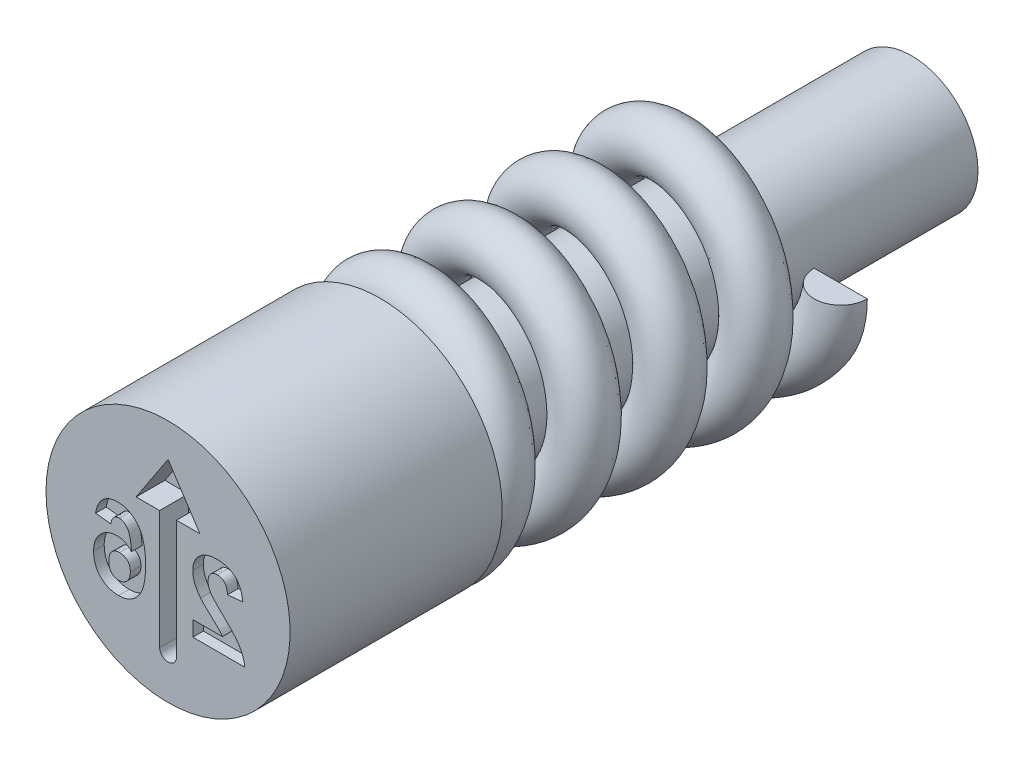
ISO-10303-21;
HEADER;
FILE_DESCRIPTION(('STEP AP214'),'2;1');
FILE_NAME('part.step','',(''),(''),'','','');
FILE_SCHEMA(('AUTOMOTIVE_DESIGN { 1 0 10303 214 1 1 1 1 }'));
ENDSEC;
DATA;
#1=APPLICATION_CONTEXT('core data for automotive mechanical design processes');
#2=APPLICATION_PROTOCOL_DEFINITION('international standard','automotive_design',2000,#1);
#3=PRODUCT_CONTEXT('',#1,'mechanical');
#4=PRODUCT('Part','Part','',(#3));
#5=PRODUCT_RELATED_PRODUCT_CATEGORY('part','',(#4));
#6=PRODUCT_DEFINITION_FORMATION('','',#4);
#7=PRODUCT_DEFINITION_CONTEXT('part definition',#1,'design');
#8=PRODUCT_DEFINITION('design','',#6,#7);
#9=PRODUCT_DEFINITION_SHAPE('','',#8);
#10=(LENGTH_UNIT() NAMED_UNIT(*) SI_UNIT(.MILLI.,.METRE.));
#11=(NAMED_UNIT(*) PLANE_ANGLE_UNIT() SI_UNIT($,.RADIAN.));
#12=(NAMED_UNIT(*) SI_UNIT($,.STERADIAN.) SOLID_ANGLE_UNIT());
#13=UNCERTAINTY_MEASURE_WITH_UNIT(LENGTH_MEASURE(1.E-05),#10,'distance_accuracy_value','');
#14=(GEOMETRIC_REPRESENTATION_CONTEXT(3) GLOBAL_UNCERTAINTY_ASSIGNED_CONTEXT((#13)) GLOBAL_UNIT_ASSIGNED_CONTEXT((#10,
#11,#12)) REPRESENTATION_CONTEXT('',''));
#15=CARTESIAN_POINT('',(0.,0.,0.));
#16=DIRECTION('',(0.,0.,1.));
#17=DIRECTION('',(1.,0.,0.));
#18=AXIS2_PLACEMENT_3D('',#15,#16,#17);
#19=CARTESIAN_POINT('',(1.8,0.,-11.3772));
#20=DIRECTION('',(0.,-1.,0.));
#21=DIRECTION('',(0.,0.,-1.));
#22=AXIS2_PLACEMENT_3D('',#19,#20,#21);
#23=PLANE('',#22);
#24=CARTESIAN_POINT('',(1.8,0.,-10.8772));
#25=DIRECTION('',(0.,1.,0.));
#26=DIRECTION('',(0.,0.,1.));
#27=AXIS2_PLACEMENT_3D('',#24,#25,#26);
#28=CIRCLE('',#27,0.5);
#29=CARTESIAN_POINT('',(1.3,0.,-10.8772));
#30=VERTEX_POINT('',#29);
#31=CARTESIAN_POINT('',(2.3,0.,-10.8772));
#32=VERTEX_POINT('',#31);
#33=EDGE_CURVE('E90',#30,#32,#28,.T.);
#34=ORIENTED_EDGE('',*,*,#33,.T.);
#35=DIRECTION('',(-1.,0.,0.));
#36=VECTOR('',#35,1.);
#37=CARTESIAN_POINT('',(1.8,0.,-10.8772));
#38=LINE('',#37,#36);
#39=EDGE_CURVE('E77',#32,#30,#38,.T.);
#40=ORIENTED_EDGE('',*,*,#39,.T.);
#41=EDGE_LOOP('',(#34,#40));
#42=FACE_BOUND('',#41,.T.);
#43=ADVANCED_FACE('F51',(#42),#23,.F.);
#44=CARTESIAN_POINT('',(0.,-1.8,-4.4972));
#45=DIRECTION('',(-1.,0.,0.));
#46=DIRECTION('',(0.,-1.,0.));
#47=AXIS2_PLACEMENT_3D('',#44,#45,#46);
#48=PLANE('',#47);
#49=DIRECTION('',(0.,-1.,0.));
#50=VECTOR('',#49,1.);
#51=CARTESIAN_POINT('',(0.,-1.8,-3.9972));
#52=LINE('',#51,#50);
#53=CARTESIAN_POINT('',(0.,-1.3,-3.9972));
#54=VERTEX_POINT('',#53);
#55=CARTESIAN_POINT('',(0.,-2.3,-3.9972));
#56=VERTEX_POINT('',#55);
#57=EDGE_CURVE('E71',#54,#56,#52,.T.);
#58=ORIENTED_EDGE('',*,*,#57,.F.);
#59=CARTESIAN_POINT('',(0.,-1.8,-3.9972));
#60=DIRECTION('',(-1.,0.,0.));
#61=DIRECTION('',(0.,-1.,0.));
#62=AXIS2_PLACEMENT_3D('',#59,#60,#61);
#63=CIRCLE('',#62,0.5);
#64=EDGE_CURVE('E87',#54,#56,#63,.T.);
#65=ORIENTED_EDGE('',*,*,#64,.T.);
#66=EDGE_LOOP('',(#58,#65));
#67=FACE_BOUND('',#66,.T.);
#68=ADVANCED_FACE('F53',(#67),#48,.T.);
#69=CARTESIAN_POINT('',(1.8,0.,-10.3772));
#70=CARTESIAN_POINT('',(1.8,-0.745584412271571,-10.2760235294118));
#71=CARTESIAN_POINT('',(1.27279220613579,-1.27279220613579,-10.1748470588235));
#72=CARTESIAN_POINT('',(0.745584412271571,-1.8,-10.0736705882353));
#73=CARTESIAN_POINT('',(0.,-1.8,-9.97249411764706));
#74=CARTESIAN_POINT('',(-0.745584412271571,-1.8,-9.87131764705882));
#75=CARTESIAN_POINT('',(-1.27279220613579,-1.27279220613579,-9.77014117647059));
#76=CARTESIAN_POINT('',(-1.8,-0.745584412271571,-9.66896470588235));
#77=CARTESIAN_POINT('',(-1.8,0.,-9.56778823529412));
#78=CARTESIAN_POINT('',(-1.8,0.745584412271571,-9.46661176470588));
#79=CARTESIAN_POINT('',(-1.27279220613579,1.27279220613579,-9.36543529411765));
#80=CARTESIAN_POINT('',(-0.745584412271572,1.8,-9.26425882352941));
#81=CARTESIAN_POINT('',(0.,1.8,-9.16308235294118));
#82=CARTESIAN_POINT('',(0.745584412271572,1.8,-9.06190588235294));
#83=CARTESIAN_POINT('',(1.27279220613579,1.27279220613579,-8.96072941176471));
#84=CARTESIAN_POINT('',(1.8,0.745584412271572,-8.85955294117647));
#85=CARTESIAN_POINT('',(1.8,0.,-8.75837647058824));
#86=CARTESIAN_POINT('',(1.8,-0.745584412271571,-8.6572));
#87=CARTESIAN_POINT('',(1.27279220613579,-1.27279220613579,-8.55602352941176));
#88=CARTESIAN_POINT('',(0.745584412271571,-1.8,-8.45484705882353));
#89=CARTESIAN_POINT('',(0.,-1.8,-8.35367058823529));
#90=CARTESIAN_POINT('',(-0.745584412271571,-1.8,-8.25249411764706));
#91=CARTESIAN_POINT('',(-1.27279220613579,-1.27279220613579,-8.15131764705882));
#92=CARTESIAN_POINT('',(-1.8,-0.745584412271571,-8.05014117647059));
#93=CARTESIAN_POINT('',(-1.8,0.,-7.94896470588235));
#94=CARTESIAN_POINT('',(-1.8,0.745584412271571,-7.84778823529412));
#95=CARTESIAN_POINT('',(-1.27279220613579,1.27279220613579,-7.74661176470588));
#96=CARTESIAN_POINT('',(-0.745584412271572,1.8,-7.64543529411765));
#97=CARTESIAN_POINT('',(0.,1.8,-7.54425882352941));
#98=CARTESIAN_POINT('',(0.745584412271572,1.8,-7.44308235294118));
#99=CARTESIAN_POINT('',(1.27279220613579,1.27279220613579,-7.34190588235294));
#100=CARTESIAN_POINT('',(1.8,0.745584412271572,-7.2407294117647));
#101=CARTESIAN_POINT('',(1.8,0.,-7.13955294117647));
#102=CARTESIAN_POINT('',(1.8,-0.745584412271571,-7.03837647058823));
#103=CARTESIAN_POINT('',(1.27279220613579,-1.27279220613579,-6.9372));
#104=CARTESIAN_POINT('',(0.745584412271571,-1.8,-6.83602352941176));
#105=CARTESIAN_POINT('',(0.,-1.8,-6.73484705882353));
#106=CARTESIAN_POINT('',(-0.745584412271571,-1.8,-6.63367058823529));
#107=CARTESIAN_POINT('',(-1.27279220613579,-1.27279220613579,-6.53249411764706));
#108=CARTESIAN_POINT('',(-1.8,-0.745584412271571,-6.43131764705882));
#109=CARTESIAN_POINT('',(-1.8,0.,-6.33014117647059));
#110=CARTESIAN_POINT('',(-1.8,0.745584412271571,-6.22896470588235));
#111=CARTESIAN_POINT('',(-1.27279220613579,1.27279220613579,-6.12778823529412));
#112=CARTESIAN_POINT('',(-0.745584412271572,1.8,-6.02661176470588));
#113=CARTESIAN_POINT('',(0.,1.8,-5.92543529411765));
#114=CARTESIAN_POINT('',(0.745584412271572,1.8,-5.82425882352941));
#115=CARTESIAN_POINT('',(1.27279220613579,1.27279220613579,-5.72308235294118));
#116=CARTESIAN_POINT('',(1.8,0.745584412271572,-5.62190588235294));
#117=CARTESIAN_POINT('',(1.8,0.,-5.52072941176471));
#118=CARTESIAN_POINT('',(1.8,-0.745584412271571,-5.41955294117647));
#119=CARTESIAN_POINT('',(1.27279220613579,-1.27279220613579,-5.31837647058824));
#120=CARTESIAN_POINT('',(0.745584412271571,-1.8,-5.2172));
#121=CARTESIAN_POINT('',(0.,-1.8,-5.11602352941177));
#122=CARTESIAN_POINT('',(-0.745584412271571,-1.8,-5.01484705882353));
#123=CARTESIAN_POINT('',(-1.27279220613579,-1.27279220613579,-4.91367058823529));
#124=CARTESIAN_POINT('',(-1.8,-0.745584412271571,-4.81249411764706));
#125=CARTESIAN_POINT('',(-1.8,0.,-4.71131764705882));
#126=CARTESIAN_POINT('',(-1.8,0.745584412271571,-4.61014117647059));
#127=CARTESIAN_POINT('',(-1.27279220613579,1.27279220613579,-4.50896470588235));
#128=CARTESIAN_POINT('',(-0.745584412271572,1.8,-4.40778823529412));
#129=CARTESIAN_POINT('',(0.,1.8,-4.30661176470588));
#130=CARTESIAN_POINT('',(0.745584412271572,1.8,-4.20543529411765));
#131=CARTESIAN_POINT('',(1.27279220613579,1.27279220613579,-4.10425882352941));
#132=CARTESIAN_POINT('',(1.8,0.745584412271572,-4.00308235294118));
#133=CARTESIAN_POINT('',(1.8,0.,-3.90190588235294));
#134=CARTESIAN_POINT('',(1.8,-0.745584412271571,-3.80072941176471));
#135=CARTESIAN_POINT('',(1.27279220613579,-1.27279220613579,-3.69955294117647));
#136=CARTESIAN_POINT('',(0.745584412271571,-1.8,-3.59837647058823));
#137=CARTESIAN_POINT('',(0.,-1.8,-3.4972));
#138=CARTESIAN_POINT('',(2.8,0.,-10.3772));
#139=CARTESIAN_POINT('',(2.8,-1.15979797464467,-10.2760235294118));
#140=CARTESIAN_POINT('',(1.97989898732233,-1.97989898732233,-10.1748470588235));
#141=CARTESIAN_POINT('',(1.15979797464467,-2.8,-10.0736705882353));
#142=CARTESIAN_POINT('',(0.,-2.8,-9.97249411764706));
#143=CARTESIAN_POINT('',(-1.15979797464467,-2.8,-9.87131764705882));
#144=CARTESIAN_POINT('',(-1.97989898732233,-1.97989898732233,-9.77014117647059));
#145=CARTESIAN_POINT('',(-2.8,-1.15979797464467,-9.66896470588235));
#146=CARTESIAN_POINT('',(-2.8,0.,-9.56778823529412));
#147=CARTESIAN_POINT('',(-2.8,1.15979797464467,-9.46661176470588));
#148=CARTESIAN_POINT('',(-1.97989898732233,1.97989898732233,-9.36543529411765));
#149=CARTESIAN_POINT('',(-1.15979797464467,2.8,-9.26425882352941));
#150=CARTESIAN_POINT('',(0.,2.8,-9.16308235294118));
#151=CARTESIAN_POINT('',(1.15979797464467,2.8,-9.06190588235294));
#152=CARTESIAN_POINT('',(1.97989898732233,1.97989898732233,-8.96072941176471));
#153=CARTESIAN_POINT('',(2.8,1.15979797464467,-8.85955294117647));
#154=CARTESIAN_POINT('',(2.8,0.,-8.75837647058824));
#155=CARTESIAN_POINT('',(2.8,-1.15979797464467,-8.6572));
#156=CARTESIAN_POINT('',(1.97989898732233,-1.97989898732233,-8.55602352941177));
#157=CARTESIAN_POINT('',(1.15979797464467,-2.8,-8.45484705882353));
#158=CARTESIAN_POINT('',(0.,-2.8,-8.35367058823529));
#159=CARTESIAN_POINT('',(-1.15979797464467,-2.8,-8.25249411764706));
#160=CARTESIAN_POINT('',(-1.97989898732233,-1.97989898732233,-8.15131764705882));
#161=CARTESIAN_POINT('',(-2.8,-1.15979797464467,-8.05014117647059));
#162=CARTESIAN_POINT('',(-2.8,0.,-7.94896470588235));
#163=CARTESIAN_POINT('',(-2.8,1.15979797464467,-7.84778823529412));
#164=CARTESIAN_POINT('',(-1.97989898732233,1.97989898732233,-7.74661176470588));
#165=CARTESIAN_POINT('',(-1.15979797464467,2.8,-7.64543529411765));
#166=CARTESIAN_POINT('',(0.,2.8,-7.54425882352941));
#167=CARTESIAN_POINT('',(1.15979797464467,2.8,-7.44308235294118));
#168=CARTESIAN_POINT('',(1.97989898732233,1.97989898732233,-7.34190588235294));
#169=CARTESIAN_POINT('',(2.8,1.15979797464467,-7.24072941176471));
#170=CARTESIAN_POINT('',(2.8,0.,-7.13955294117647));
#171=CARTESIAN_POINT('',(2.8,-1.15979797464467,-7.03837647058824));
#172=CARTESIAN_POINT('',(1.97989898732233,-1.97989898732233,-6.9372));
#173=CARTESIAN_POINT('',(1.15979797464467,-2.8,-6.83602352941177));
#174=CARTESIAN_POINT('',(0.,-2.8,-6.73484705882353));
#175=CARTESIAN_POINT('',(-1.15979797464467,-2.8,-6.63367058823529));
#176=CARTESIAN_POINT('',(-1.97989898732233,-1.97989898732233,-6.53249411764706));
#177=CARTESIAN_POINT('',(-2.8,-1.15979797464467,-6.43131764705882));
#178=CARTESIAN_POINT('',(-2.8,0.,-6.33014117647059));
#179=CARTESIAN_POINT('',(-2.8,1.15979797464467,-6.22896470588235));
#180=CARTESIAN_POINT('',(-1.97989898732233,1.97989898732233,-6.12778823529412));
#181=CARTESIAN_POINT('',(-1.15979797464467,2.8,-6.02661176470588));
#182=CARTESIAN_POINT('',(0.,2.8,-5.92543529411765));
#183=CARTESIAN_POINT('',(1.15979797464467,2.8,-5.82425882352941));
#184=CARTESIAN_POINT('',(1.97989898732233,1.97989898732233,-5.72308235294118));
#185=CARTESIAN_POINT('',(2.8,1.15979797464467,-5.62190588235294));
#186=CARTESIAN_POINT('',(2.8,0.,-5.52072941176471));
#187=CARTESIAN_POINT('',(2.8,-1.15979797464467,-5.41955294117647));
#188=CARTESIAN_POINT('',(1.97989898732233,-1.97989898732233,-5.31837647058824));
#189=CARTESIAN_POINT('',(1.15979797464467,-2.8,-5.2172));
#190=CARTESIAN_POINT('',(0.,-2.8,-5.11602352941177));
#191=CARTESIAN_POINT('',(-1.15979797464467,-2.8,-5.01484705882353));
#192=CARTESIAN_POINT('',(-1.97989898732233,-1.97989898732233,-4.91367058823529));
#193=CARTESIAN_POINT('',(-2.8,-1.15979797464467,-4.81249411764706));
#194=CARTESIAN_POINT('',(-2.8,0.,-4.71131764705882));
#195=CARTESIAN_POINT('',(-2.8,1.15979797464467,-4.61014117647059));
#196=CARTESIAN_POINT('',(-1.97989898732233,1.97989898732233,-4.50896470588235));
#197=CARTESIAN_POINT('',(-1.15979797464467,2.8,-4.40778823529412));
#198=CARTESIAN_POINT('',(0.,2.8,-4.30661176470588));
#199=CARTESIAN_POINT('',(1.15979797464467,2.8,-4.20543529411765));
#200=CARTESIAN_POINT('',(1.97989898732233,1.97989898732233,-4.10425882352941));
#201=CARTESIAN_POINT('',(2.8,1.15979797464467,-4.00308235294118));
#202=CARTESIAN_POINT('',(2.8,0.,-3.90190588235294));
#203=CARTESIAN_POINT('',(2.8,-1.15979797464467,-3.80072941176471));
#204=CARTESIAN_POINT('',(1.97989898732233,-1.97989898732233,-3.69955294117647));
#205=CARTESIAN_POINT('',(1.15979797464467,-2.8,-3.59837647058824));
#206=CARTESIAN_POINT('',(0.,-2.8,-3.4972));
#207=CARTESIAN_POINT('',(2.8,0.,-11.3772));
#208=CARTESIAN_POINT('',(2.8,-1.15979797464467,-11.2760235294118));
#209=CARTESIAN_POINT('',(1.97989898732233,-1.97989898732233,-11.1748470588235));
#210=CARTESIAN_POINT('',(1.15979797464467,-2.8,-11.0736705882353));
#211=CARTESIAN_POINT('',(0.,-2.8,-10.9724941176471));
#212=CARTESIAN_POINT('',(-1.15979797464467,-2.8,-10.8713176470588));
#213=CARTESIAN_POINT('',(-1.97989898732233,-1.97989898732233,-10.7701411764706));
#214=CARTESIAN_POINT('',(-2.8,-1.15979797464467,-10.6689647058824));
#215=CARTESIAN_POINT('',(-2.8,0.,-10.5677882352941));
#216=CARTESIAN_POINT('',(-2.8,1.15979797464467,-10.4666117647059));
#217=CARTESIAN_POINT('',(-1.97989898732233,1.97989898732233,-10.3654352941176));
#218=CARTESIAN_POINT('',(-1.15979797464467,2.8,-10.2642588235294));
#219=CARTESIAN_POINT('',(0.,2.8,-10.1630823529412));
#220=CARTESIAN_POINT('',(1.15979797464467,2.8,-10.0619058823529));
#221=CARTESIAN_POINT('',(1.97989898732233,1.97989898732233,-9.96072941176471));
#222=CARTESIAN_POINT('',(2.8,1.15979797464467,-9.85955294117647));
#223=CARTESIAN_POINT('',(2.8,0.,-9.75837647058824));
#224=CARTESIAN_POINT('',(2.8,-1.15979797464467,-9.6572));
#225=CARTESIAN_POINT('',(1.97989898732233,-1.97989898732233,-9.55602352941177));
#226=CARTESIAN_POINT('',(1.15979797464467,-2.8,-9.45484705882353));
#227=CARTESIAN_POINT('',(0.,-2.8,-9.35367058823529));
#228=CARTESIAN_POINT('',(-1.15979797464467,-2.8,-9.25249411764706));
#229=CARTESIAN_POINT('',(-1.97989898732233,-1.97989898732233,-9.15131764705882));
#230=CARTESIAN_POINT('',(-2.8,-1.15979797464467,-9.05014117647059));
#231=CARTESIAN_POINT('',(-2.8,0.,-8.94896470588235));
#232=CARTESIAN_POINT('',(-2.8,1.15979797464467,-8.84778823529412));
#233=CARTESIAN_POINT('',(-1.97989898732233,1.97989898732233,-8.74661176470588));
#234=CARTESIAN_POINT('',(-1.15979797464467,2.8,-8.64543529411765));
#235=CARTESIAN_POINT('',(0.,2.8,-8.54425882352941));
#236=CARTESIAN_POINT('',(1.15979797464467,2.8,-8.44308235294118));
#237=CARTESIAN_POINT('',(1.97989898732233,1.97989898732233,-8.34190588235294));
#238=CARTESIAN_POINT('',(2.8,1.15979797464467,-8.24072941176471));
#239=CARTESIAN_POINT('',(2.8,0.,-8.13955294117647));
#240=CARTESIAN_POINT('',(2.8,-1.15979797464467,-8.03837647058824));
#241=CARTESIAN_POINT('',(1.97989898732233,-1.97989898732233,-7.9372));
#242=CARTESIAN_POINT('',(1.15979797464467,-2.8,-7.83602352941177));
#243=CARTESIAN_POINT('',(0.,-2.8,-7.73484705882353));
#244=CARTESIAN_POINT('',(-1.15979797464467,-2.8,-7.63367058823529));
#245=CARTESIAN_POINT('',(-1.97989898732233,-1.97989898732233,-7.53249411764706));
#246=CARTESIAN_POINT('',(-2.8,-1.15979797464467,-7.43131764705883));
#247=CARTESIAN_POINT('',(-2.8,0.,-7.33014117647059));
#248=CARTESIAN_POINT('',(-2.8,1.15979797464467,-7.22896470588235));
#249=CARTESIAN_POINT('',(-1.97989898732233,1.97989898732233,-7.12778823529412));
#250=CARTESIAN_POINT('',(-1.15979797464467,2.8,-7.02661176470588));
#251=CARTESIAN_POINT('',(0.,2.8,-6.92543529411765));
#252=CARTESIAN_POINT('',(1.15979797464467,2.8,-6.82425882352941));
#253=CARTESIAN_POINT('',(1.97989898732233,1.97989898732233,-6.72308235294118));
#254=CARTESIAN_POINT('',(2.8,1.15979797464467,-6.62190588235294));
#255=CARTESIAN_POINT('',(2.8,0.,-6.52072941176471));
#256=CARTESIAN_POINT('',(2.8,-1.15979797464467,-6.41955294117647));
#257=CARTESIAN_POINT('',(1.97989898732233,-1.97989898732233,-6.31837647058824));
#258=CARTESIAN_POINT('',(1.15979797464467,-2.8,-6.2172));
#259=CARTESIAN_POINT('',(0.,-2.8,-6.11602352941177));
#260=CARTESIAN_POINT('',(-1.15979797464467,-2.8,-6.01484705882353));
#261=CARTESIAN_POINT('',(-1.97989898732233,-1.97989898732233,-5.9136705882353));
#262=CARTESIAN_POINT('',(-2.8,-1.15979797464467,-5.81249411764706));
#263=CARTESIAN_POINT('',(-2.8,0.,-5.71131764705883));
#264=CARTESIAN_POINT('',(-2.8,1.15979797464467,-5.61014117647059));
#265=CARTESIAN_POINT('',(-1.97989898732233,1.97989898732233,-5.50896470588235));
#266=CARTESIAN_POINT('',(-1.15979797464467,2.8,-5.40778823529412));
#267=CARTESIAN_POINT('',(0.,2.8,-5.30661176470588));
#268=CARTESIAN_POINT('',(1.15979797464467,2.8,-5.20543529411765));
#269=CARTESIAN_POINT('',(1.97989898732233,1.97989898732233,-5.10425882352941));
#270=CARTESIAN_POINT('',(2.8,1.15979797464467,-5.00308235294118));
#271=CARTESIAN_POINT('',(2.8,0.,-4.90190588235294));
#272=CARTESIAN_POINT('',(2.8,-1.15979797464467,-4.80072941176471));
#273=CARTESIAN_POINT('',(1.97989898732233,-1.97989898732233,-4.69955294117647));
#274=CARTESIAN_POINT('',(1.15979797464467,-2.8,-4.59837647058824));
#275=CARTESIAN_POINT('',(0.,-2.8,-4.4972));
#276=CARTESIAN_POINT('',(1.8,0.,-11.3772));
#277=CARTESIAN_POINT('',(1.8,-0.745584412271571,-11.2760235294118));
#278=CARTESIAN_POINT('',(1.27279220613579,-1.27279220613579,-11.1748470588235));
#279=CARTESIAN_POINT('',(0.745584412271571,-1.8,-11.0736705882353));
#280=CARTESIAN_POINT('',(0.,-1.8,-10.9724941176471));
#281=CARTESIAN_POINT('',(-0.745584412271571,-1.8,-10.8713176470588));
#282=CARTESIAN_POINT('',(-1.27279220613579,-1.27279220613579,-10.7701411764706));
#283=CARTESIAN_POINT('',(-1.8,-0.745584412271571,-10.6689647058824));
#284=CARTESIAN_POINT('',(-1.8,0.,-10.5677882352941));
#285=CARTESIAN_POINT('',(-1.8,0.745584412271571,-10.4666117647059));
#286=CARTESIAN_POINT('',(-1.27279220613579,1.27279220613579,-10.3654352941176));
#287=CARTESIAN_POINT('',(-0.745584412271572,1.8,-10.2642588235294));
#288=CARTESIAN_POINT('',(0.,1.8,-10.1630823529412));
#289=CARTESIAN_POINT('',(0.745584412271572,1.8,-10.0619058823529));
#290=CARTESIAN_POINT('',(1.27279220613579,1.27279220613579,-9.96072941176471));
#291=CARTESIAN_POINT('',(1.8,0.745584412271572,-9.85955294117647));
#292=CARTESIAN_POINT('',(1.8,0.,-9.75837647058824));
#293=CARTESIAN_POINT('',(1.8,-0.745584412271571,-9.6572));
#294=CARTESIAN_POINT('',(1.27279220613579,-1.27279220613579,-9.55602352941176));
#295=CARTESIAN_POINT('',(0.745584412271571,-1.8,-9.45484705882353));
#296=CARTESIAN_POINT('',(0.,-1.8,-9.35367058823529));
#297=CARTESIAN_POINT('',(-0.745584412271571,-1.8,-9.25249411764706));
#298=CARTESIAN_POINT('',(-1.27279220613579,-1.27279220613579,-9.15131764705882));
#299=CARTESIAN_POINT('',(-1.8,-0.745584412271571,-9.05014117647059));
#300=CARTESIAN_POINT('',(-1.8,0.,-8.94896470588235));
#301=CARTESIAN_POINT('',(-1.8,0.745584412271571,-8.84778823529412));
#302=CARTESIAN_POINT('',(-1.27279220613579,1.27279220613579,-8.74661176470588));
#303=CARTESIAN_POINT('',(-0.745584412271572,1.8,-8.64543529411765));
#304=CARTESIAN_POINT('',(0.,1.8,-8.54425882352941));
#305=CARTESIAN_POINT('',(0.745584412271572,1.8,-8.44308235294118));
#306=CARTESIAN_POINT('',(1.27279220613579,1.27279220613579,-8.34190588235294));
#307=CARTESIAN_POINT('',(1.8,0.745584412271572,-8.24072941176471));
#308=CARTESIAN_POINT('',(1.8,0.,-8.13955294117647));
#309=CARTESIAN_POINT('',(1.8,-0.745584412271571,-8.03837647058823));
#310=CARTESIAN_POINT('',(1.27279220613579,-1.27279220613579,-7.9372));
#311=CARTESIAN_POINT('',(0.745584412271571,-1.8,-7.83602352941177));
#312=CARTESIAN_POINT('',(0.,-1.8,-7.73484705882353));
#313=CARTESIAN_POINT('',(-0.745584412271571,-1.8,-7.63367058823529));
#314=CARTESIAN_POINT('',(-1.27279220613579,-1.27279220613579,-7.53249411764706));
#315=CARTESIAN_POINT('',(-1.8,-0.745584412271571,-7.43131764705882));
#316=CARTESIAN_POINT('',(-1.8,0.,-7.33014117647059));
#317=CARTESIAN_POINT('',(-1.8,0.745584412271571,-7.22896470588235));
#318=CARTESIAN_POINT('',(-1.27279220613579,1.27279220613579,-7.12778823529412));
#319=CARTESIAN_POINT('',(-0.745584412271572,1.8,-7.02661176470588));
#320=CARTESIAN_POINT('',(0.,1.8,-6.92543529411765));
#321=CARTESIAN_POINT('',(0.745584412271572,1.8,-6.82425882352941));
#322=CARTESIAN_POINT('',(1.27279220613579,1.27279220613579,-6.72308235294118));
#323=CARTESIAN_POINT('',(1.8,0.745584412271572,-6.62190588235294));
#324=CARTESIAN_POINT('',(1.8,0.,-6.52072941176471));
#325=CARTESIAN_POINT('',(1.8,-0.745584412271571,-6.41955294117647));
#326=CARTESIAN_POINT('',(1.27279220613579,-1.27279220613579,-6.31837647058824));
#327=CARTESIAN_POINT('',(0.745584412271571,-1.8,-6.2172));
#328=CARTESIAN_POINT('',(0.,-1.8,-6.11602352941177));
#329=CARTESIAN_POINT('',(-0.745584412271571,-1.8,-6.01484705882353));
#330=CARTESIAN_POINT('',(-1.27279220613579,-1.27279220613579,-5.91367058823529));
#331=CARTESIAN_POINT('',(-1.8,-0.745584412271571,-5.81249411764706));
#332=CARTESIAN_POINT('',(-1.8,0.,-5.71131764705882));
#333=CARTESIAN_POINT('',(-1.8,0.745584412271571,-5.61014117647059));
#334=CARTESIAN_POINT('',(-1.27279220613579,1.27279220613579,-5.50896470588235));
#335=CARTESIAN_POINT('',(-0.745584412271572,1.8,-5.40778823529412));
#336=CARTESIAN_POINT('',(0.,1.8,-5.30661176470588));
#337=CARTESIAN_POINT('',(0.745584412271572,1.8,-5.20543529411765));
#338=CARTESIAN_POINT('',(1.27279220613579,1.27279220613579,-5.10425882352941));
#339=CARTESIAN_POINT('',(1.8,0.745584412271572,-5.00308235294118));
#340=CARTESIAN_POINT('',(1.8,0.,-4.90190588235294));
#341=CARTESIAN_POINT('',(1.8,-0.745584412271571,-4.80072941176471));
#342=CARTESIAN_POINT('',(1.27279220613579,-1.27279220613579,-4.69955294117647));
#343=CARTESIAN_POINT('',(0.745584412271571,-1.8,-4.59837647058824));
#344=CARTESIAN_POINT('',(0.,-1.8,-4.4972));
#345=CARTESIAN_POINT('',(0.799999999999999,0.,-11.3772));
#346=CARTESIAN_POINT('',(0.8,-0.331370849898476,-11.2760235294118));
#347=CARTESIAN_POINT('',(0.565685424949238,-0.565685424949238,-11.1748470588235));
#348=CARTESIAN_POINT('',(0.331370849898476,-0.8,-11.0736705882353));
#349=CARTESIAN_POINT('',(0.,-0.799999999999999,-10.9724941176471));
#350=CARTESIAN_POINT('',(-0.331370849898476,-0.8,-10.8713176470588));
#351=CARTESIAN_POINT('',(-0.565685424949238,-0.565685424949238,-10.7701411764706));
#352=CARTESIAN_POINT('',(-0.8,-0.331370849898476,-10.6689647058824));
#353=CARTESIAN_POINT('',(-0.799999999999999,0.,-10.5677882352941));
#354=CARTESIAN_POINT('',(-0.8,0.331370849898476,-10.4666117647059));
#355=CARTESIAN_POINT('',(-0.565685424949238,0.565685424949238,-10.3654352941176));
#356=CARTESIAN_POINT('',(-0.331370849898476,0.799999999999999,-10.2642588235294));
#357=CARTESIAN_POINT('',(0.,0.799999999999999,-10.1630823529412));
#358=CARTESIAN_POINT('',(0.331370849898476,0.8,-10.0619058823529));
#359=CARTESIAN_POINT('',(0.565685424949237,0.565685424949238,-9.96072941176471));
#360=CARTESIAN_POINT('',(0.799999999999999,0.331370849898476,-9.85955294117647));
#361=CARTESIAN_POINT('',(0.799999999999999,0.,-9.75837647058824));
#362=CARTESIAN_POINT('',(0.8,-0.331370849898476,-9.6572));
#363=CARTESIAN_POINT('',(0.565685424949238,-0.565685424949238,-9.55602352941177));
#364=CARTESIAN_POINT('',(0.331370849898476,-0.8,-9.45484705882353));
#365=CARTESIAN_POINT('',(0.,-0.799999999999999,-9.35367058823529));
#366=CARTESIAN_POINT('',(-0.331370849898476,-0.8,-9.25249411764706));
#367=CARTESIAN_POINT('',(-0.565685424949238,-0.565685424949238,-9.15131764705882));
#368=CARTESIAN_POINT('',(-0.8,-0.331370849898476,-9.05014117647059));
#369=CARTESIAN_POINT('',(-0.799999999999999,0.,-8.94896470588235));
#370=CARTESIAN_POINT('',(-0.8,0.331370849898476,-8.84778823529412));
#371=CARTESIAN_POINT('',(-0.565685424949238,0.565685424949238,-8.74661176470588));
#372=CARTESIAN_POINT('',(-0.331370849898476,0.799999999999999,-8.64543529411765));
#373=CARTESIAN_POINT('',(0.,0.799999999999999,-8.54425882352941));
#374=CARTESIAN_POINT('',(0.331370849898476,0.8,-8.44308235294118));
#375=CARTESIAN_POINT('',(0.565685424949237,0.565685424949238,-8.34190588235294));
#376=CARTESIAN_POINT('',(0.799999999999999,0.331370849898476,-8.24072941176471));
#377=CARTESIAN_POINT('',(0.799999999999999,0.,-8.13955294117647));
#378=CARTESIAN_POINT('',(0.8,-0.331370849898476,-8.03837647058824));
#379=CARTESIAN_POINT('',(0.565685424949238,-0.565685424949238,-7.9372));
#380=CARTESIAN_POINT('',(0.331370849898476,-0.8,-7.83602352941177));
#381=CARTESIAN_POINT('',(0.,-0.799999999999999,-7.73484705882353));
#382=CARTESIAN_POINT('',(-0.331370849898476,-0.8,-7.63367058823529));
#383=CARTESIAN_POINT('',(-0.565685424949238,-0.565685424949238,-7.53249411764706));
#384=CARTESIAN_POINT('',(-0.8,-0.331370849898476,-7.43131764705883));
#385=CARTESIAN_POINT('',(-0.799999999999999,0.,-7.33014117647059));
#386=CARTESIAN_POINT('',(-0.8,0.331370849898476,-7.22896470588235));
#387=CARTESIAN_POINT('',(-0.565685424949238,0.565685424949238,-7.12778823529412));
#388=CARTESIAN_POINT('',(-0.331370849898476,0.799999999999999,-7.02661176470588));
#389=CARTESIAN_POINT('',(0.,0.799999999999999,-6.92543529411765));
#390=CARTESIAN_POINT('',(0.331370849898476,0.8,-6.82425882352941));
#391=CARTESIAN_POINT('',(0.565685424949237,0.565685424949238,-6.72308235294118));
#392=CARTESIAN_POINT('',(0.799999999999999,0.331370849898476,-6.62190588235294));
#393=CARTESIAN_POINT('',(0.799999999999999,0.,-6.52072941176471));
#394=CARTESIAN_POINT('',(0.8,-0.331370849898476,-6.41955294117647));
#395=CARTESIAN_POINT('',(0.565685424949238,-0.565685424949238,-6.31837647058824));
#396=CARTESIAN_POINT('',(0.331370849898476,-0.8,-6.2172));
#397=CARTESIAN_POINT('',(0.,-0.799999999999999,-6.11602352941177));
#398=CARTESIAN_POINT('',(-0.331370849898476,-0.8,-6.01484705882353));
#399=CARTESIAN_POINT('',(-0.565685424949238,-0.565685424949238,-5.9136705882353));
#400=CARTESIAN_POINT('',(-0.8,-0.331370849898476,-5.81249411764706));
#401=CARTESIAN_POINT('',(-0.799999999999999,0.,-5.71131764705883));
#402=CARTESIAN_POINT('',(-0.8,0.331370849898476,-5.61014117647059));
#403=CARTESIAN_POINT('',(-0.565685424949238,0.565685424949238,-5.50896470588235));
#404=CARTESIAN_POINT('',(-0.331370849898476,0.799999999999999,-5.40778823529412));
#405=CARTESIAN_POINT('',(0.,0.799999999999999,-5.30661176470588));
#406=CARTESIAN_POINT('',(0.331370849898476,0.8,-5.20543529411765));
#407=CARTESIAN_POINT('',(0.565685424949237,0.565685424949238,-5.10425882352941));
#408=CARTESIAN_POINT('',(0.799999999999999,0.331370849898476,-5.00308235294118));
#409=CARTESIAN_POINT('',(0.799999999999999,0.,-4.90190588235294));
#410=CARTESIAN_POINT('',(0.8,-0.331370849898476,-4.80072941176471));
#411=CARTESIAN_POINT('',(0.565685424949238,-0.565685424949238,-4.69955294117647));
#412=CARTESIAN_POINT('',(0.331370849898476,-0.8,-4.59837647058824));
#413=CARTESIAN_POINT('',(0.,-0.799999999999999,-4.4972));
#414=CARTESIAN_POINT('',(0.799999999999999,0.,-10.3772));
#415=CARTESIAN_POINT('',(0.8,-0.331370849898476,-10.2760235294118));
#416=CARTESIAN_POINT('',(0.565685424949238,-0.565685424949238,-10.1748470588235));
#417=CARTESIAN_POINT('',(0.331370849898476,-0.8,-10.0736705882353));
#418=CARTESIAN_POINT('',(0.,-0.799999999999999,-9.97249411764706));
#419=CARTESIAN_POINT('',(-0.331370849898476,-0.8,-9.87131764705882));
#420=CARTESIAN_POINT('',(-0.565685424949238,-0.565685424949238,-9.77014117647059));
#421=CARTESIAN_POINT('',(-0.8,-0.331370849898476,-9.66896470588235));
#422=CARTESIAN_POINT('',(-0.799999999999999,0.,-9.56778823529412));
#423=CARTESIAN_POINT('',(-0.8,0.331370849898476,-9.46661176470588));
#424=CARTESIAN_POINT('',(-0.565685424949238,0.565685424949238,-9.36543529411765));
#425=CARTESIAN_POINT('',(-0.331370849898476,0.799999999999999,-9.26425882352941));
#426=CARTESIAN_POINT('',(0.,0.799999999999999,-9.16308235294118));
#427=CARTESIAN_POINT('',(0.331370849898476,0.8,-9.06190588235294));
#428=CARTESIAN_POINT('',(0.565685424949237,0.565685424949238,-8.96072941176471));
#429=CARTESIAN_POINT('',(0.799999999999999,0.331370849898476,-8.85955294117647));
#430=CARTESIAN_POINT('',(0.799999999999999,0.,-8.75837647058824));
#431=CARTESIAN_POINT('',(0.8,-0.331370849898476,-8.6572));
#432=CARTESIAN_POINT('',(0.565685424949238,-0.565685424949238,-8.55602352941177));
#433=CARTESIAN_POINT('',(0.331370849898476,-0.8,-8.45484705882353));
#434=CARTESIAN_POINT('',(0.,-0.799999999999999,-8.35367058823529));
#435=CARTESIAN_POINT('',(-0.331370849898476,-0.8,-8.25249411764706));
#436=CARTESIAN_POINT('',(-0.565685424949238,-0.565685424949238,-8.15131764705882));
#437=CARTESIAN_POINT('',(-0.8,-0.331370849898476,-8.05014117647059));
#438=CARTESIAN_POINT('',(-0.799999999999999,0.,-7.94896470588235));
#439=CARTESIAN_POINT('',(-0.8,0.331370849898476,-7.84778823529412));
#440=CARTESIAN_POINT('',(-0.565685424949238,0.565685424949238,-7.74661176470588));
#441=CARTESIAN_POINT('',(-0.331370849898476,0.799999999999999,-7.64543529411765));
#442=CARTESIAN_POINT('',(0.,0.799999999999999,-7.54425882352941));
#443=CARTESIAN_POINT('',(0.331370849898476,0.8,-7.44308235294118));
#444=CARTESIAN_POINT('',(0.565685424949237,0.565685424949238,-7.34190588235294));
#445=CARTESIAN_POINT('',(0.799999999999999,0.331370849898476,-7.24072941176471));
#446=CARTESIAN_POINT('',(0.799999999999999,0.,-7.13955294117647));
#447=CARTESIAN_POINT('',(0.8,-0.331370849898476,-7.03837647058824));
#448=CARTESIAN_POINT('',(0.565685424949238,-0.565685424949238,-6.9372));
#449=CARTESIAN_POINT('',(0.331370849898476,-0.8,-6.83602352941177));
#450=CARTESIAN_POINT('',(0.,-0.799999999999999,-6.73484705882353));
#451=CARTESIAN_POINT('',(-0.331370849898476,-0.8,-6.63367058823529));
#452=CARTESIAN_POINT('',(-0.565685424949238,-0.565685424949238,-6.53249411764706));
#453=CARTESIAN_POINT('',(-0.8,-0.331370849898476,-6.43131764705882));
#454=CARTESIAN_POINT('',(-0.799999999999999,0.,-6.33014117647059));
#455=CARTESIAN_POINT('',(-0.8,0.331370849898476,-6.22896470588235));
#456=CARTESIAN_POINT('',(-0.565685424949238,0.565685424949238,-6.12778823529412));
#457=CARTESIAN_POINT('',(-0.331370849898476,0.799999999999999,-6.02661176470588));
#458=CARTESIAN_POINT('',(0.,0.799999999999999,-5.92543529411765));
#459=CARTESIAN_POINT('',(0.331370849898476,0.8,-5.82425882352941));
#460=CARTESIAN_POINT('',(0.565685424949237,0.565685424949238,-5.72308235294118));
#461=CARTESIAN_POINT('',(0.799999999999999,0.331370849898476,-5.62190588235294));
#462=CARTESIAN_POINT('',(0.799999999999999,0.,-5.52072941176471));
#463=CARTESIAN_POINT('',(0.8,-0.331370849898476,-5.41955294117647));
#464=CARTESIAN_POINT('',(0.565685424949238,-0.565685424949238,-5.31837647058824));
#465=CARTESIAN_POINT('',(0.331370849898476,-0.8,-5.2172));
#466=CARTESIAN_POINT('',(0.,-0.799999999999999,-5.11602352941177));
#467=CARTESIAN_POINT('',(-0.331370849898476,-0.8,-5.01484705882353));
#468=CARTESIAN_POINT('',(-0.565685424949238,-0.565685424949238,-4.91367058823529));
#469=CARTESIAN_POINT('',(-0.8,-0.331370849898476,-4.81249411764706));
#470=CARTESIAN_POINT('',(-0.799999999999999,0.,-4.71131764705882));
#471=CARTESIAN_POINT('',(-0.8,0.331370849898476,-4.61014117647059));
#472=CARTESIAN_POINT('',(-0.565685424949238,0.565685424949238,-4.50896470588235));
#473=CARTESIAN_POINT('',(-0.331370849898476,0.799999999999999,-4.40778823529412));
#474=CARTESIAN_POINT('',(0.,0.799999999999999,-4.30661176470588));
#475=CARTESIAN_POINT('',(0.331370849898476,0.8,-4.20543529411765));
#476=CARTESIAN_POINT('',(0.565685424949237,0.565685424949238,-4.10425882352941));
#477=CARTESIAN_POINT('',(0.799999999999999,0.331370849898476,-4.00308235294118));
#478=CARTESIAN_POINT('',(0.799999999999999,0.,-3.90190588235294));
#479=CARTESIAN_POINT('',(0.8,-0.331370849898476,-3.80072941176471));
#480=CARTESIAN_POINT('',(0.565685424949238,-0.565685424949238,-3.69955294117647));
#481=CARTESIAN_POINT('',(0.331370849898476,-0.8,-3.59837647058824));
#482=CARTESIAN_POINT('',(0.,-0.799999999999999,-3.4972));
#483=CARTESIAN_POINT('',(1.8,0.,-10.3772));
#484=CARTESIAN_POINT('',(1.8,-0.745584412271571,-10.2760235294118));
#485=CARTESIAN_POINT('',(1.27279220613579,-1.27279220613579,-10.1748470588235));
#486=CARTESIAN_POINT('',(0.745584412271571,-1.8,-10.0736705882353));
#487=CARTESIAN_POINT('',(0.,-1.8,-9.97249411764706));
#488=CARTESIAN_POINT('',(-0.745584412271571,-1.8,-9.87131764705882));
#489=CARTESIAN_POINT('',(-1.27279220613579,-1.27279220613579,-9.77014117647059));
#490=CARTESIAN_POINT('',(-1.8,-0.745584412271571,-9.66896470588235));
#491=CARTESIAN_POINT('',(-1.8,0.,-9.56778823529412));
#492=CARTESIAN_POINT('',(-1.8,0.745584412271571,-9.46661176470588));
#493=CARTESIAN_POINT('',(-1.27279220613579,1.27279220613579,-9.36543529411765));
#494=CARTESIAN_POINT('',(-0.745584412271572,1.8,-9.26425882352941));
#495=CARTESIAN_POINT('',(0.,1.8,-9.16308235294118));
#496=CARTESIAN_POINT('',(0.745584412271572,1.8,-9.06190588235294));
#497=CARTESIAN_POINT('',(1.27279220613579,1.27279220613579,-8.96072941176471));
#498=CARTESIAN_POINT('',(1.8,0.745584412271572,-8.85955294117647));
#499=CARTESIAN_POINT('',(1.8,0.,-8.75837647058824));
#500=CARTESIAN_POINT('',(1.8,-0.745584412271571,-8.6572));
#501=CARTESIAN_POINT('',(1.27279220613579,-1.27279220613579,-8.55602352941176));
#502=CARTESIAN_POINT('',(0.745584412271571,-1.8,-8.45484705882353));
#503=CARTESIAN_POINT('',(0.,-1.8,-8.35367058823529));
#504=CARTESIAN_POINT('',(-0.745584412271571,-1.8,-8.25249411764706));
#505=CARTESIAN_POINT('',(-1.27279220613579,-1.27279220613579,-8.15131764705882));
#506=CARTESIAN_POINT('',(-1.8,-0.745584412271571,-8.05014117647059));
#507=CARTESIAN_POINT('',(-1.8,0.,-7.94896470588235));
#508=CARTESIAN_POINT('',(-1.8,0.745584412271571,-7.84778823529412));
#509=CARTESIAN_POINT('',(-1.27279220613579,1.27279220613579,-7.74661176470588));
#510=CARTESIAN_POINT('',(-0.745584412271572,1.8,-7.64543529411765));
#511=CARTESIAN_POINT('',(0.,1.8,-7.54425882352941));
#512=CARTESIAN_POINT('',(0.745584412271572,1.8,-7.44308235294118));
#513=CARTESIAN_POINT('',(1.27279220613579,1.27279220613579,-7.34190588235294));
#514=CARTESIAN_POINT('',(1.8,0.745584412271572,-7.2407294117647));
#515=CARTESIAN_POINT('',(1.8,0.,-7.13955294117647));
#516=CARTESIAN_POINT('',(1.8,-0.745584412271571,-7.03837647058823));
#517=CARTESIAN_POINT('',(1.27279220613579,-1.27279220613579,-6.9372));
#518=CARTESIAN_POINT('',(0.745584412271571,-1.8,-6.83602352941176));
#519=CARTESIAN_POINT('',(0.,-1.8,-6.73484705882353));
#520=CARTESIAN_POINT('',(-0.745584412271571,-1.8,-6.63367058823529));
#521=CARTESIAN_POINT('',(-1.27279220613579,-1.27279220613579,-6.53249411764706));
#522=CARTESIAN_POINT('',(-1.8,-0.745584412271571,-6.43131764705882));
#523=CARTESIAN_POINT('',(-1.8,0.,-6.33014117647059));
#524=CARTESIAN_POINT('',(-1.8,0.745584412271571,-6.22896470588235));
#525=CARTESIAN_POINT('',(-1.27279220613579,1.27279220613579,-6.12778823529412));
#526=CARTESIAN_POINT('',(-0.745584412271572,1.8,-6.02661176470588));
#527=CARTESIAN_POINT('',(0.,1.8,-5.92543529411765));
#528=CARTESIAN_POINT('',(0.745584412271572,1.8,-5.82425882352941));
#529=CARTESIAN_POINT('',(1.27279220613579,1.27279220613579,-5.72308235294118));
#530=CARTESIAN_POINT('',(1.8,0.745584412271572,-5.62190588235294));
#531=CARTESIAN_POINT('',(1.8,0.,-5.52072941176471));
#532=CARTESIAN_POINT('',(1.8,-0.745584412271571,-5.41955294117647));
#533=CARTESIAN_POINT('',(1.27279220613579,-1.27279220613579,-5.31837647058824));
#534=CARTESIAN_POINT('',(0.745584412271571,-1.8,-5.2172));
#535=CARTESIAN_POINT('',(0.,-1.8,-5.11602352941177));
#536=CARTESIAN_POINT('',(-0.745584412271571,-1.8,-5.01484705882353));
#537=CARTESIAN_POINT('',(-1.27279220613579,-1.27279220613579,-4.91367058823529));
#538=CARTESIAN_POINT('',(-1.8,-0.745584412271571,-4.81249411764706));
#539=CARTESIAN_POINT('',(-1.8,0.,-4.71131764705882));
#540=CARTESIAN_POINT('',(-1.8,0.745584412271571,-4.61014117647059));
#541=CARTESIAN_POINT('',(-1.27279220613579,1.27279220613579,-4.50896470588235));
#542=CARTESIAN_POINT('',(-0.745584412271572,1.8,-4.40778823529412));
#543=CARTESIAN_POINT('',(0.,1.8,-4.30661176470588));
#544=CARTESIAN_POINT('',(0.745584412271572,1.8,-4.20543529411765));
#545=CARTESIAN_POINT('',(1.27279220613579,1.27279220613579,-4.10425882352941));
#546=CARTESIAN_POINT('',(1.8,0.745584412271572,-4.00308235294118));
#547=CARTESIAN_POINT('',(1.8,0.,-3.90190588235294));
#548=CARTESIAN_POINT('',(1.8,-0.745584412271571,-3.80072941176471));
#549=CARTESIAN_POINT('',(1.27279220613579,-1.27279220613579,-3.69955294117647));
#550=CARTESIAN_POINT('',(0.745584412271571,-1.8,-3.59837647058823));
#551=CARTESIAN_POINT('',(0.,-1.8,-3.4972));
#552=(BOUNDED_SURFACE() B_SPLINE_SURFACE(3,2,((#69,#70,#71,#72,#73,#74,#75,#76,#77,#78,#79,#80,
#81,#82,#83,#84,#85,#86,#87,#88,#89,#90,#91,#92,#93,#94,#95,#96,#97,#98,#99,#100,#101,#102,#103,
#104,#105,#106,#107,#108,#109,#110,#111,#112,#113,#114,#115,#116,#117,#118,#119,#120,#121,#122,
#123,#124,#125,#126,#127,#128,#129,#130,#131,#132,#133,#134,#135,#136,#137),(#138,#139,#140,
#141,#142,#143,#144,#145,#146,#147,#148,#149,#150,#151,#152,#153,#154,#155,#156,#157,#158,#159,
#160,#161,#162,#163,#164,#165,#166,#167,#168,#169,#170,#171,#172,#173,#174,#175,#176,#177,#178,
#179,#180,#181,#182,#183,#184,#185,#186,#187,#188,#189,#190,#191,#192,#193,#194,#195,#196,#197,
#198,#199,#200,#201,#202,#203,#204,#205,#206),(#207,#208,#209,#210,#211,#212,#213,#214,#215,
#216,#217,#218,#219,#220,#221,#222,#223,#224,#225,#226,#227,#228,#229,#230,#231,#232,#233,#234,
#235,#236,#237,#238,#239,#240,#241,#242,#243,#244,#245,#246,#247,#248,#249,#250,#251,#252,#253,
#254,#255,#256,#257,#258,#259,#260,#261,#262,#263,#264,#265,#266,#267,#268,#269,#270,#271,#272,
#273,#274,#275),(#276,#277,#278,#279,#280,#281,#282,#283,#284,#285,#286,#287,#288,#289,#290,
#291,#292,#293,#294,#295,#296,#297,#298,#299,#300,#301,#302,#303,#304,#305,#306,#307,#308,#309,
#310,#311,#312,#313,#314,#315,#316,#317,#318,#319,#320,#321,#322,#323,#324,#325,#326,#327,#328,
#329,#330,#331,#332,#333,#334,#335,#336,#337,#338,#339,#340,#341,#342,#343,#344),(#345,#346,
#347,#348,#349,#350,#351,#352,#353,#354,#355,#356,#357,#358,#359,#360,#361,#362,#363,#364,#365,
#366,#367,#368,#369,#370,#371,#372,#373,#374,#375,#376,#377,#378,#379,#380,#381,#382,#383,#384,
#385,#386,#387,#388,#389,#390,#391,#392,#393,#394,#395,#396,#397,#398,#399,#400,#401,#402,#403,
#404,#405,#406,#407,#408,#409,#410,#411,#412,#413),(#414,#415,#416,#417,#418,#419,#420,#421,
#422,#423,#424,#425,#426,#427,#428,#429,#430,#431,#432,#433,#434,#435,#436,#437,#438,#439,#440,
#441,#442,#443,#444,#445,#446,#447,#448,#449,#450,#451,#452,#453,#454,#455,#456,#457,#458,#459,
#460,#461,#462,#463,#464,#465,#466,#467,#468,#469,#470,#471,#472,#473,#474,#475,#476,#477,#478,
#479,#480,#481,#482),(#483,#484,#485,#486,#487,#488,#489,#490,#491,#492,#493,#494,#495,#496,
#497,#498,#499,#500,#501,#502,#503,#504,#505,#506,#507,#508,#509,#510,#511,#512,#513,#514,#515,
#516,#517,#518,#519,#520,#521,#522,#523,#524,#525,#526,#527,#528,#529,#530,#531,#532,#533,#534,
#535,#536,#537,#538,#539,#540,#541,#542,#543,#544,#545,#546,#547,#548,#549,#550,#551)),
.UNSPECIFIED.,.T.,.F.,.F.) B_SPLINE_SURFACE_WITH_KNOTS((4,3,4),(3,2,2,2,2,2,2,2,2,2,2,2,2,2,2,2,
2,2,2,2,2,2,2,2,2,2,2,2,2,2,2,2,2,2,3),(0.,0.5,1.),(0.,0.025,0.05,0.075,0.1,0.125,0.15,0.175,
0.2,0.225,0.25,0.275,0.3,0.325,0.35,0.375,0.4,0.425,0.45,0.475,0.5,0.525,0.55,0.575,0.6,0.625,
0.65,0.675,0.7,0.725,0.75,0.775,0.8,0.825,0.85),
.UNSPECIFIED.) GEOMETRIC_REPRESENTATION_ITEM() RATIONAL_B_SPLINE_SURFACE(((1.,0.923879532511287,
1.,0.923879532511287,1.,0.923879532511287,1.,0.923879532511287,1.,0.923879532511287,1.,
0.923879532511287,1.,0.923879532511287,1.,0.923879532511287,1.,0.923879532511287,1.,
0.923879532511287,1.,0.923879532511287,1.,0.923879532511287,1.,0.923879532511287,1.,
0.923879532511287,1.,0.923879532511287,1.,0.923879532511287,1.,0.923879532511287,1.,
0.923879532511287,1.,0.923879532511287,1.,0.923879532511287,1.,0.923879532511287,1.,
0.923879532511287,1.,0.923879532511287,1.,0.923879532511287,1.,0.923879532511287,1.,
0.923879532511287,1.,0.923879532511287,1.,0.923879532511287,1.,0.923879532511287,1.,
0.923879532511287,1.,0.923879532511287,1.,0.923879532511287,1.,0.923879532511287,1.,
0.923879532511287,1.),(0.333333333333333,0.307959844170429,0.333333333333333,0.307959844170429,
0.333333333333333,0.307959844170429,0.333333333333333,0.307959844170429,0.333333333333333,
0.307959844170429,0.333333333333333,0.307959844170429,0.333333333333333,0.307959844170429,
0.333333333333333,0.307959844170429,0.333333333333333,0.307959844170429,0.333333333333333,
0.307959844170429,0.333333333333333,0.307959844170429,0.333333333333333,0.307959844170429,
0.333333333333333,0.307959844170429,0.333333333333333,0.307959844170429,0.333333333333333,
0.307959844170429,0.333333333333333,0.307959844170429,0.333333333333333,0.307959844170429,
0.333333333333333,0.307959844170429,0.333333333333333,0.307959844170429,0.333333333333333,
0.307959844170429,0.333333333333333,0.307959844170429,0.333333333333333,0.307959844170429,
0.333333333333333,0.307959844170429,0.333333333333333,0.307959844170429,0.333333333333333,
0.307959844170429,0.333333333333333,0.307959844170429,0.333333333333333,0.307959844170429,
0.333333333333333,0.307959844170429,0.333333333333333,0.307959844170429,0.333333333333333,
0.307959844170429,0.333333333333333,0.307959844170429,0.333333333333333,0.307959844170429,
0.333333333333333,0.307959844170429,0.333333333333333,0.307959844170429,0.333333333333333),
(0.333333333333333,0.307959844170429,0.333333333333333,0.307959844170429,0.333333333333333,
0.307959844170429,0.333333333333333,0.307959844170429,0.333333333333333,0.307959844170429,
0.333333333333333,0.307959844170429,0.333333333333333,0.307959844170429,0.333333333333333,
0.307959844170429,0.333333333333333,0.307959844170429,0.333333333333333,0.307959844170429,
0.333333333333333,0.307959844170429,0.333333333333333,0.307959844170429,0.333333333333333,
0.307959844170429,0.333333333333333,0.307959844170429,0.333333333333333,0.307959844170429,
0.333333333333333,0.307959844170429,0.333333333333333,0.307959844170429,0.333333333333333,
0.307959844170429,0.333333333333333,0.307959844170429,0.333333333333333,0.307959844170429,
0.333333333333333,0.307959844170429,0.333333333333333,0.307959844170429,0.333333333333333,
0.307959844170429,0.333333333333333,0.307959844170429,0.333333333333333,0.307959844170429,
0.333333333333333,0.307959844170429,0.333333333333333,0.307959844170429,0.333333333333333,
0.307959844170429,0.333333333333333,0.307959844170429,0.333333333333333,0.307959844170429,
0.333333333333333,0.307959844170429,0.333333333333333,0.307959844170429,0.333333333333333,
0.307959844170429,0.333333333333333,0.307959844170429,0.333333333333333),(1.,0.923879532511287,
1.,0.923879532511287,1.,0.923879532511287,1.,0.923879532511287,1.,0.923879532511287,1.,
0.923879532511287,1.,0.923879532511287,1.,0.923879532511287,1.,0.923879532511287,1.,
0.923879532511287,1.,0.923879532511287,1.,0.923879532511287,1.,0.923879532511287,1.,
0.923879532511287,1.,0.923879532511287,1.,0.923879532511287,1.,0.923879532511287,1.,
0.923879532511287,1.,0.923879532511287,1.,0.923879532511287,1.,0.923879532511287,1.,
0.923879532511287,1.,0.923879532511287,1.,0.923879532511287,1.,0.923879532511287,1.,
0.923879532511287,1.,0.923879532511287,1.,0.923879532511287,1.,0.923879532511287,1.,
0.923879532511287,1.,0.923879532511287,1.,0.923879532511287,1.,0.923879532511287,1.,
0.923879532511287,1.),(0.333333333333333,0.307959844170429,0.333333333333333,0.307959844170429,
0.333333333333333,0.307959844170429,0.333333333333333,0.307959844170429,0.333333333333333,
0.307959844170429,0.333333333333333,0.307959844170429,0.333333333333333,0.307959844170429,
0.333333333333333,0.307959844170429,0.333333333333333,0.307959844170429,0.333333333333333,
0.307959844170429,0.333333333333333,0.307959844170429,0.333333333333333,0.307959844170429,
0.333333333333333,0.307959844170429,0.333333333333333,0.307959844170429,0.333333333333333,
0.307959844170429,0.333333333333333,0.307959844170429,0.333333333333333,0.307959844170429,
0.333333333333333,0.307959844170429,0.333333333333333,0.307959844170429,0.333333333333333,
0.307959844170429,0.333333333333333,0.307959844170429,0.333333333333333,0.307959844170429,
0.333333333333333,0.307959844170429,0.333333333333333,0.307959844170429,0.333333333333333,
0.307959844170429,0.333333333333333,0.307959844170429,0.333333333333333,0.307959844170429,
0.333333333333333,0.307959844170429,0.333333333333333,0.307959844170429,0.333333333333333,
0.307959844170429,0.333333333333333,0.307959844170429,0.333333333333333,0.307959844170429,
0.333333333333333,0.307959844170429,0.333333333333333,0.307959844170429,0.333333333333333),
(0.333333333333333,0.307959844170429,0.333333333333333,0.307959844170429,0.333333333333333,
0.307959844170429,0.333333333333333,0.307959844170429,0.333333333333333,0.307959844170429,
0.333333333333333,0.307959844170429,0.333333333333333,0.307959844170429,0.333333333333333,
0.307959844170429,0.333333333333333,0.307959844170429,0.333333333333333,0.307959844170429,
0.333333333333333,0.307959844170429,0.333333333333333,0.307959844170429,0.333333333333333,
0.307959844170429,0.333333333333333,0.307959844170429,0.333333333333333,0.307959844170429,
0.333333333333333,0.307959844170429,0.333333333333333,0.307959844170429,0.333333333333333,
0.307959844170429,0.333333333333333,0.307959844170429,0.333333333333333,0.307959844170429,
0.333333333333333,0.307959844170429,0.333333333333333,0.307959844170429,0.333333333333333,
0.307959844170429,0.333333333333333,0.307959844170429,0.333333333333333,0.307959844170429,
0.333333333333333,0.307959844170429,0.333333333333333,0.307959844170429,0.333333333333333,
0.307959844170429,0.333333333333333,0.307959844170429,0.333333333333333,0.307959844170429,
0.333333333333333,0.307959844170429,0.333333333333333,0.307959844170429,0.333333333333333,
0.307959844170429,0.333333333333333,0.307959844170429,0.333333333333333),(1.,0.923879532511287,
1.,0.923879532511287,1.,0.923879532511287,1.,0.923879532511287,1.,0.923879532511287,1.,
0.923879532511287,1.,0.923879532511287,1.,0.923879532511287,1.,0.923879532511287,1.,
0.923879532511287,1.,0.923879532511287,1.,0.923879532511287,1.,0.923879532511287,1.,
0.923879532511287,1.,0.923879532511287,1.,0.923879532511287,1.,0.923879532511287,1.,
0.923879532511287,1.,0.923879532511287,1.,0.923879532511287,1.,0.923879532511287,1.,
0.923879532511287,1.,0.923879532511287,1.,0.923879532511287,1.,0.923879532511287,1.,
0.923879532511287,1.,0.923879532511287,1.,0.923879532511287,1.,0.923879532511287,1.,
0.923879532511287,1.,0.923879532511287,1.,0.923879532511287,1.,0.923879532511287,1.,
0.923879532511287,1.))) REPRESENTATION_ITEM('') SURFACE());
#553=CARTESIAN_POINT('',(1.3,0.,-10.8772));
#554=CARTESIAN_POINT('',(1.30004315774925,-0.081362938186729,-10.8772));
#555=CARTESIAN_POINT('',(1.2930671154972,-0.1626751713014,-10.8772));
#556=CARTESIAN_POINT('',(1.26573745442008,-0.323002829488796,-10.8772));
#557=CARTESIAN_POINT('',(1.24538779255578,-0.402018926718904,-10.8772));
#558=CARTESIAN_POINT('',(1.19176114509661,-0.55621290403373,-10.8772));
#559=CARTESIAN_POINT('',(1.15838385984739,-0.631355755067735,-10.8772));
#560=CARTESIAN_POINT('',(1.07966290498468,-0.77505117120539,-10.8772));
#561=CARTESIAN_POINT('',(1.0343314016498,-0.843610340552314,-10.8772));
#562=CARTESIAN_POINT('',(0.958045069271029,-0.940236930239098,-10.8772));
#563=CARTESIAN_POINT('',(0.931089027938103,-0.971541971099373,-10.8772));
#564=CARTESIAN_POINT('',(0.874831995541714,-1.03198289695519,-10.8772));
#565=CARTESIAN_POINT('',(0.845530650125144,-1.06111845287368,-10.8772));
#566=CARTESIAN_POINT('',(0.784719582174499,-1.11711805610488,-10.8772));
#567=CARTESIAN_POINT('',(0.753205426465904,-1.14397729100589,-10.8772));
#568=CARTESIAN_POINT('',(0.688267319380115,-1.19525015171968,-10.8772));
#569=CARTESIAN_POINT('',(0.654843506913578,-1.21966395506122,-10.8772));
#570=CARTESIAN_POINT('',(0.545826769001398,-1.29327847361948,-10.8772));
#571=CARTESIAN_POINT('',(0.466960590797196,-1.3377813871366,-10.8772));
#572=CARTESIAN_POINT('',(0.344561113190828,-1.39503102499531,-10.8772));
#573=CARTESIAN_POINT('',(0.303136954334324,-1.41251279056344,-10.8772));
#574=CARTESIAN_POINT('',(0.219113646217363,-1.44437499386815,-10.8772));
#575=CARTESIAN_POINT('',(0.17651495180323,-1.45875661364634,-10.8772));
#576=CARTESIAN_POINT('',(0.109868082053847,-1.47867850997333,-10.8772));
#577=CARTESIAN_POINT('',(0.0861289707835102,-1.48527876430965,-10.8772));
#578=CARTESIAN_POINT('',(0.0384121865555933,-1.49754454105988,-10.8772));
#579=CARTESIAN_POINT('',(0.0144345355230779,-1.50321014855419,-10.8772));
#580=CARTESIAN_POINT('',(-0.0336860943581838,-1.51381334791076,-10.8772));
#581=CARTESIAN_POINT('',(-0.0578291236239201,-1.51875070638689,-10.8772));
#582=CARTESIAN_POINT('',(-0.106223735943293,-1.52806147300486,-10.8772));
#583=CARTESIAN_POINT('',(-0.130475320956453,-1.5324348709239,-10.8772));
#584=CARTESIAN_POINT('',(-0.203499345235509,-1.54484614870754,-10.8772));
#585=CARTESIAN_POINT('',(-0.252395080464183,-1.55214420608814,-10.8772));
#586=CARTESIAN_POINT('',(-0.325755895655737,-1.56283651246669,-10.8772));
#587=CARTESIAN_POINT('',(-0.350207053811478,-1.56635741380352,-10.8772));
#588=CARTESIAN_POINT('',(-0.399062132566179,-1.57371306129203,-10.8772));
#589=CARTESIAN_POINT('',(-0.423466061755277,-1.5775477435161,-10.8772));
#590=CARTESIAN_POINT('',(-0.457978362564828,-1.58372521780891,-10.8772));
#591=CARTESIAN_POINT('',(-0.468161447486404,-1.5856417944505,-10.8772));
#592=CARTESIAN_POINT('',(-0.488476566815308,-1.58975233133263,-10.8772));
#593=CARTESIAN_POINT('',(-0.498608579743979,-1.59194639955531,-10.8772));
#594=CARTESIAN_POINT('',(-0.51878635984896,-1.59673760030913,-10.8772));
#595=CARTESIAN_POINT('',(-0.528832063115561,-1.59933500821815,-10.8772));
#596=CARTESIAN_POINT('',(-0.548749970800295,-1.60511810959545,-10.8772));
#597=CARTESIAN_POINT('',(-0.558622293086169,-1.60830338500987,-10.8772));
#598=CARTESIAN_POINT('',(-0.578162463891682,-1.61560311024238,-10.8772));
#599=CARTESIAN_POINT('',(-0.587826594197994,-1.61972794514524,-10.8772000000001));
#600=CARTESIAN_POINT('',(-0.60641930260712,-1.62933482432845,-10.8771999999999));
#601=CARTESIAN_POINT('',(-0.615352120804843,-1.6348081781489,-10.8771999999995));
#602=CARTESIAN_POINT('',(-0.630908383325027,-1.64728570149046,-10.8771999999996));
#603=CARTESIAN_POINT('',(-0.637669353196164,-1.65410011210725,-10.8771999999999));
#604=CARTESIAN_POINT('',(-0.64581848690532,-1.66580384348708,-10.8772));
#605=CARTESIAN_POINT('',(-0.648212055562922,-1.66998547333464,-10.8772));
#606=CARTESIAN_POINT('',(-0.652144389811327,-1.67873132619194,-10.8772));
#607=CARTESIAN_POINT('',(-0.653683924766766,-1.68329520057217,-10.8772));
#608=CARTESIAN_POINT('',(-0.656657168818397,-1.69621361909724,-10.8772));
#609=CARTESIAN_POINT('',(-0.657110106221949,-1.70479863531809,-10.8772));
#610=CARTESIAN_POINT('',(-0.655376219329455,-1.72589013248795,-10.8772));
#611=CARTESIAN_POINT('',(-0.651768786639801,-1.73822982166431,-10.8772));
#612=CARTESIAN_POINT('',(-0.642365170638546,-1.76059199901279,-10.8772));
#613=CARTESIAN_POINT('',(-0.636788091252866,-1.77072276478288,-10.8772));
#614=CARTESIAN_POINT('',(-0.624293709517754,-1.79015170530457,-10.8772));
#615=CARTESIAN_POINT('',(-0.617372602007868,-1.79944740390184,-10.8772));
#616=CARTESIAN_POINT('',(-0.601886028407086,-1.81824487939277,-10.8772));
#617=CARTESIAN_POINT('',(-0.593224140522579,-1.82766516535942,-10.8772));
#618=CARTESIAN_POINT('',(-0.57515669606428,-1.84576966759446,-10.8772));
#619=CARTESIAN_POINT('',(-0.565750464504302,-1.85445320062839,-10.8772));
#620=CARTESIAN_POINT('',(-0.536687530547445,-1.8795767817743,-10.8772));
#621=CARTESIAN_POINT('',(-0.516209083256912,-1.89506457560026,-10.8772));
#622=CARTESIAN_POINT('',(-0.472404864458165,-1.92501592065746,-10.8772));
#623=CARTESIAN_POINT('',(-0.448980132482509,-1.93933091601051,-10.8772));
#624=CARTESIAN_POINT('',(-0.401007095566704,-1.96596960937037,-10.8772));
#625=CARTESIAN_POINT('',(-0.376457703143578,-1.97829132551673,-10.8772));
#626=CARTESIAN_POINT('',(-0.30154292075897,-2.01258218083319,-10.8772));
#627=CARTESIAN_POINT('',(-0.249934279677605,-2.0318619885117,-10.8772));
#628=CARTESIAN_POINT('',(-0.155018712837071,-2.0609965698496,-10.8772));
#629=CARTESIAN_POINT('',(-0.112035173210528,-2.07195277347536,-10.8772));
#630=CARTESIAN_POINT('',(-0.0252427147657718,-2.09000098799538,-10.8772));
#631=CARTESIAN_POINT('',(0.0185668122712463,-2.09709002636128,-10.8772000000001));
#632=CARTESIAN_POINT('',(0.150635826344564,-2.11336091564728,-10.8771999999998));
#633=CARTESIAN_POINT('',(0.239545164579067,-2.11754917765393,-10.877199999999));
#634=CARTESIAN_POINT('',(0.420207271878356,-2.11292349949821,-10.8771999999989));
#635=CARTESIAN_POINT('',(0.511946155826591,-2.10363225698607,-10.8771999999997));
#636=CARTESIAN_POINT('',(0.693040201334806,-2.07190372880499,-10.8772000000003));
#637=CARTESIAN_POINT('',(0.782396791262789,-2.04947451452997,-10.8772000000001));
#638=CARTESIAN_POINT('',(0.970794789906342,-1.98775372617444,-10.8771999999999));
#639=CARTESIAN_POINT('',(1.06915229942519,-1.94636662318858,-10.8772));
#640=CARTESIAN_POINT('',(1.25813378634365,-1.84845428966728,-10.8772));
#641=CARTESIAN_POINT('',(1.34875119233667,-1.79191636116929,-10.8772));
#642=CARTESIAN_POINT('',(1.47949101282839,-1.69540815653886,-10.8772));
#643=CARTESIAN_POINT('',(1.52323583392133,-1.66023795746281,-10.8772));
#644=CARTESIAN_POINT('',(1.60774606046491,-1.5864800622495,-10.8772));
#645=CARTESIAN_POINT('',(1.64851112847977,-1.54789198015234,-10.8772));
#646=CARTESIAN_POINT('',(1.7660874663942,-1.42753705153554,-10.8772));
#647=CARTESIAN_POINT('',(1.83824554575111,-1.34113044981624,-10.8772));
#648=CARTESIAN_POINT('',(1.9720331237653,-1.15257878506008,-10.8772));
#649=CARTESIAN_POINT('',(2.03276590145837,-1.04979902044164,-10.8772));
#650=CARTESIAN_POINT('',(2.13639836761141,-0.835609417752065,-10.8772));
#651=CARTESIAN_POINT('',(2.17929856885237,-0.724199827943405,-10.8772));
#652=CARTESIAN_POINT('',(2.24169894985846,-0.511082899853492,-10.8772));
#653=CARTESIAN_POINT('',(2.2635565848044,-0.410062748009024,-10.8772));
#654=CARTESIAN_POINT('',(2.2854201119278,-0.257060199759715,-10.8772));
#655=CARTESIAN_POINT('',(2.29088746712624,-0.205808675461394,-10.8772));
#656=CARTESIAN_POINT('',(2.2981778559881,-0.103043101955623,-10.8772));
#657=CARTESIAN_POINT('',(2.30000062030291,-0.0515290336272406,-10.8772));
#658=CARTESIAN_POINT('',(2.3,0.,-10.8772));
#659=B_SPLINE_CURVE_WITH_KNOTS('',3,(#553,#554,#555,#556,#557,#558,#559,#560,#561,#562,#563,
#564,#565,#566,#567,#568,#569,#570,#571,#572,#573,#574,#575,#576,#577,#578,#579,#580,#581,#582,
#583,#584,#585,#586,#587,#588,#589,#590,#591,#592,#593,#594,#595,#596,#597,#598,#599,#600,#601,
#602,#603,#604,#605,#606,#607,#608,#609,#610,#611,#612,#613,#614,#615,#616,#617,#618,#619,#620,
#621,#622,#623,#624,#625,#626,#627,#628,#629,#630,#631,#632,#633,#634,#635,#636,#637,#638,#639,
#640,#641,#642,#643,#644,#645,#646,#647,#648,#649,#650,#651,#652,#653,#654,#655,#656,#657,#658),
.UNSPECIFIED.,.F.,.F.,(4,2,2,2,2,2,2,2,2,2,2,2,2,2,2,2,2,2,2,2,2,2,2,2,2,2,2,2,2,2,2,2,2,2,2,2,
2,2,2,2,2,2,2,2,2,2,2,2,2,2,2,2,4),(0.,0.243722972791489,0.487373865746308,0.73293885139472,
0.978254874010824,1.1020760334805,1.22591593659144,1.3500114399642,1.47409792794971,
1.74442703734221,1.87922589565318,2.01397326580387,2.08787689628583,2.16177379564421,
2.23569432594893,2.30961619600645,2.45790714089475,2.53202040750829,2.60611861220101,
2.63720167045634,2.6682968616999,2.69941337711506,2.7305078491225,2.76196429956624,
2.79322310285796,2.82157417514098,2.83594506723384,2.85030299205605,2.8756379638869,
2.9135379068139,2.94812202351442,2.98280551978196,3.0211435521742,3.05951675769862,
3.13636369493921,3.21861320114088,3.30094398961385,3.46568806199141,3.59859054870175,
3.7315950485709,3.99757502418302,4.27320614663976,4.54866811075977,4.86740555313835,
5.18641097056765,5.35463573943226,5.52287952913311,5.8591238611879,6.21563453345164,
6.57213495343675,6.88109833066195,7.0356114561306,7.19013600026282),.UNSPECIFIED.);
#660=EDGE_CURVE('E65',#30,#32,#659,.T.);
#661=CARTESIAN_POINT('',(0.,-1.3,-3.9972));
#662=CARTESIAN_POINT('',(0.0813629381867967,-1.30004315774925,-3.9972));
#663=CARTESIAN_POINT('',(0.162675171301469,-1.2930671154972,-3.9972));
#664=CARTESIAN_POINT('',(0.323002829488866,-1.26573745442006,-3.9972));
#665=CARTESIAN_POINT('',(0.402018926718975,-1.24538779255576,-3.9972));
#666=CARTESIAN_POINT('',(0.5562129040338,-1.19176114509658,-3.9972));
#667=CARTESIAN_POINT('',(0.631355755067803,-1.15838385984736,-3.9972));
#668=CARTESIAN_POINT('',(0.775051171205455,-1.07966290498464,-3.9972));
#669=CARTESIAN_POINT('',(0.843610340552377,-1.03433140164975,-3.9972));
#670=CARTESIAN_POINT('',(0.940236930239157,-0.95804506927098,-3.9972));
#671=CARTESIAN_POINT('',(0.971541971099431,-0.931089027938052,-3.9972));
#672=CARTESIAN_POINT('',(1.03198289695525,-0.874831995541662,-3.9972));
#673=CARTESIAN_POINT('',(1.06111845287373,-0.84553065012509,-3.9972));
#674=CARTESIAN_POINT('',(1.11711805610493,-0.784719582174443,-3.9972));
#675=CARTESIAN_POINT('',(1.14397729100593,-0.753205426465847,-3.9972));
#676=CARTESIAN_POINT('',(1.19525015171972,-0.688267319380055,-3.9972));
#677=CARTESIAN_POINT('',(1.21966395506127,-0.654843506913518,-3.9972));
#678=CARTESIAN_POINT('',(1.29327847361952,-0.545826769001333,-3.9972));
#679=CARTESIAN_POINT('',(1.33778138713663,-0.466960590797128,-3.99720000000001));
#680=CARTESIAN_POINT('',(1.39503102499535,-0.344561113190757,-3.9972));
#681=CARTESIAN_POINT('',(1.41251279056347,-0.303136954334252,-3.99719999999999));
#682=CARTESIAN_POINT('',(1.44437499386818,-0.219113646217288,-3.99720000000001));
#683=CARTESIAN_POINT('',(1.45875661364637,-0.176514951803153,-3.99720000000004));
#684=CARTESIAN_POINT('',(1.47867850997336,-0.109868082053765,-3.99720000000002));
#685=CARTESIAN_POINT('',(1.48527876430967,-0.086128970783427,-3.99720000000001));
#686=CARTESIAN_POINT('',(1.49754454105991,-0.0384121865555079,-3.99719999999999));
#687=CARTESIAN_POINT('',(1.50321014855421,-0.014434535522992,-3.9972));
#688=CARTESIAN_POINT('',(1.51381334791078,0.0336860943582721,-3.9972));
#689=CARTESIAN_POINT('',(1.51875070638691,0.0578291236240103,-3.9972));
#690=CARTESIAN_POINT('',(1.52806147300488,0.106223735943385,-3.9972));
#691=CARTESIAN_POINT('',(1.53243487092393,0.130475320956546,-3.9972));
#692=CARTESIAN_POINT('',(1.54484614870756,0.203499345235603,-3.9972));
#693=CARTESIAN_POINT('',(1.55214420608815,0.252395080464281,-3.9972));
#694=CARTESIAN_POINT('',(1.56283651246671,0.325755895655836,-3.9972));
#695=CARTESIAN_POINT('',(1.56635741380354,0.350207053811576,-3.9972));
#696=CARTESIAN_POINT('',(1.57371306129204,0.399062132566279,-3.9972));
#697=CARTESIAN_POINT('',(1.57754774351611,0.423466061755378,-3.9972));
#698=CARTESIAN_POINT('',(1.58372521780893,0.457978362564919,-3.9972));
#699=CARTESIAN_POINT('',(1.58564179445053,0.468161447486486,-3.9972));
#700=CARTESIAN_POINT('',(1.58975233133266,0.488476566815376,-3.9972));
#701=CARTESIAN_POINT('',(1.59194639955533,0.498608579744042,-3.9972));
#702=CARTESIAN_POINT('',(1.59673760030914,0.518786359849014,-3.9972));
#703=CARTESIAN_POINT('',(1.59933500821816,0.52883206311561,-3.99719999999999));
#704=CARTESIAN_POINT('',(1.60511810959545,0.548749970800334,-3.99720000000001));
#705=CARTESIAN_POINT('',(1.60830338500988,0.558622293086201,-3.99720000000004));
#706=CARTESIAN_POINT('',(1.61560311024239,0.5781624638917,-3.99719999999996));
#707=CARTESIAN_POINT('',(1.61972794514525,0.587826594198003,-3.99719999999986));
#708=CARTESIAN_POINT('',(1.62933482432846,0.606419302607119,-3.99720000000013));
#709=CARTESIAN_POINT('',(1.63480817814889,0.615352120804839,-3.9972000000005));
#710=CARTESIAN_POINT('',(1.64728570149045,0.630908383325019,-3.99720000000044));
#711=CARTESIAN_POINT('',(1.65410011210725,0.637669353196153,-3.99720000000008));
#712=CARTESIAN_POINT('',(1.66580384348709,0.645818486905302,-3.99719999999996));
#713=CARTESIAN_POINT('',(1.66998547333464,0.648212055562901,-3.99719999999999));
#714=CARTESIAN_POINT('',(1.67873132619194,0.65214438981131,-3.99720000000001));
#715=CARTESIAN_POINT('',(1.68329520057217,0.653683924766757,-3.9972));
#716=CARTESIAN_POINT('',(1.69621361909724,0.656657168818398,-3.99719999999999));
#717=CARTESIAN_POINT('',(1.7047986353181,0.657110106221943,-3.99719999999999));
#718=CARTESIAN_POINT('',(1.72589013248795,0.655376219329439,-3.9972));
#719=CARTESIAN_POINT('',(1.73822982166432,0.651768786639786,-3.9972));
#720=CARTESIAN_POINT('',(1.7605919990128,0.642365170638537,-3.9972));
#721=CARTESIAN_POINT('',(1.77072276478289,0.636788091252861,-3.99719999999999));
#722=CARTESIAN_POINT('',(1.79015170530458,0.62429370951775,-3.99720000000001));
#723=CARTESIAN_POINT('',(1.79944740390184,0.617372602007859,-3.99720000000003));
#724=CARTESIAN_POINT('',(1.81824487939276,0.601886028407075,-3.99720000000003));
#725=CARTESIAN_POINT('',(1.82766516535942,0.593224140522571,-3.99720000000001));
#726=CARTESIAN_POINT('',(1.84576966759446,0.575156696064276,-3.99719999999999));
#727=CARTESIAN_POINT('',(1.85445320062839,0.565750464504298,-3.9972));
#728=CARTESIAN_POINT('',(1.8795767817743,0.536687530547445,-3.99720000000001));
#729=CARTESIAN_POINT('',(1.89506457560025,0.516209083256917,-3.9972));
#730=CARTESIAN_POINT('',(1.92501592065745,0.472404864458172,-3.9972));
#731=CARTESIAN_POINT('',(1.9393309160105,0.448980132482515,-3.9972));
#732=CARTESIAN_POINT('',(1.96596960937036,0.40100709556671,-3.9972));
#733=CARTESIAN_POINT('',(1.97829132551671,0.376457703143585,-3.9972));
#734=CARTESIAN_POINT('',(2.01258218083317,0.301542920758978,-3.9972));
#735=CARTESIAN_POINT('',(2.03186198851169,0.249934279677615,-3.99719999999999));
#736=CARTESIAN_POINT('',(2.06099656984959,0.155018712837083,-3.99720000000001));
#737=CARTESIAN_POINT('',(2.07195277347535,0.11203517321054,-3.99720000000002));
#738=CARTESIAN_POINT('',(2.09000098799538,0.0252427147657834,-3.99719999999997));
#739=CARTESIAN_POINT('',(2.09709002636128,-0.0185668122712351,-3.99719999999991));
#740=CARTESIAN_POINT('',(2.11336091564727,-0.150635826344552,-3.99720000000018));
#741=CARTESIAN_POINT('',(2.11754917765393,-0.239545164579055,-3.99720000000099));
#742=CARTESIAN_POINT('',(2.11292349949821,-0.420207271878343,-3.99720000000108));
#743=CARTESIAN_POINT('',(2.10363225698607,-0.511946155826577,-3.99720000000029));
#744=CARTESIAN_POINT('',(2.071903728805,-0.693040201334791,-3.99719999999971));
#745=CARTESIAN_POINT('',(2.04947451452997,-0.782396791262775,-3.99719999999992));
#746=CARTESIAN_POINT('',(1.98775372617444,-0.970794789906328,-3.99720000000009));
#747=CARTESIAN_POINT('',(1.94636662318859,-1.06915229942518,-3.99720000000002));
#748=CARTESIAN_POINT('',(1.84845428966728,-1.25813378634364,-3.99719999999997));
#749=CARTESIAN_POINT('',(1.79191636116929,-1.34875119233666,-3.99719999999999));
#750=CARTESIAN_POINT('',(1.69540815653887,-1.47949101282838,-3.9972));
#751=CARTESIAN_POINT('',(1.66023795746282,-1.52323583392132,-3.9972));
#752=CARTESIAN_POINT('',(1.5864800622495,-1.6077460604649,-3.9972));
#753=CARTESIAN_POINT('',(1.54789198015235,-1.64851112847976,-3.9972));
#754=CARTESIAN_POINT('',(1.42753705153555,-1.76608746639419,-3.9972));
#755=CARTESIAN_POINT('',(1.34113044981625,-1.8382455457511,-3.9972));
#756=CARTESIAN_POINT('',(1.1525787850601,-1.97203312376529,-3.99719999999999));
#757=CARTESIAN_POINT('',(1.04979902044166,-2.03276590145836,-3.99719999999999));
#758=CARTESIAN_POINT('',(0.835609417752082,-2.13639836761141,-3.99720000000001));
#759=CARTESIAN_POINT('',(0.724199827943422,-2.17929856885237,-3.99720000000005));
#760=CARTESIAN_POINT('',(0.511082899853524,-2.24169894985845,-3.99720000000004));
#761=CARTESIAN_POINT('',(0.410062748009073,-2.26355658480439,-3.99720000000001));
#762=CARTESIAN_POINT('',(0.25706019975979,-2.28542011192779,-3.99719999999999));
#763=CARTESIAN_POINT('',(0.205808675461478,-2.29088746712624,-3.9972));
#764=CARTESIAN_POINT('',(0.103043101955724,-2.2981778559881,-3.9972));
#765=CARTESIAN_POINT('',(0.0515290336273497,-2.3000006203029,-3.9972));
#766=CARTESIAN_POINT('',(1.17403286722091E-13,-2.3,-3.9972));
#767=B_SPLINE_CURVE_WITH_KNOTS('',3,(#661,#662,#663,#664,#665,#666,#667,#668,#669,#670,#671,
#672,#673,#674,#675,#676,#677,#678,#679,#680,#681,#682,#683,#684,#685,#686,#687,#688,#689,#690,
#691,#692,#693,#694,#695,#696,#697,#698,#699,#700,#701,#702,#703,#704,#705,#706,#707,#708,#709,
#710,#711,#712,#713,#714,#715,#716,#717,#718,#719,#720,#721,#722,#723,#724,#725,#726,#727,#728,
#729,#730,#731,#732,#733,#734,#735,#736,#737,#738,#739,#740,#741,#742,#743,#744,#745,#746,#747,
#748,#749,#750,#751,#752,#753,#754,#755,#756,#757,#758,#759,#760,#761,#762,#763,#764,#765,#766),
.UNSPECIFIED.,.F.,.F.,(4,2,2,2,2,2,2,2,2,2,2,2,2,2,2,2,2,2,2,2,2,2,2,2,2,2,2,2,2,2,2,2,2,2,2,2,
2,2,2,2,2,2,2,2,2,2,2,2,2,2,2,2,4),(0.,0.243722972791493,0.487373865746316,0.73293885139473,
0.978254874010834,1.10207603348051,1.22591593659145,1.35001143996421,1.47409792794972,
1.74442703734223,1.8792258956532,2.01397326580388,2.08787689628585,2.16177379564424,
2.23569432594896,2.30961619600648,2.45790714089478,2.53202040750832,2.60611861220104,
2.63720167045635,2.66829686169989,2.69941337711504,2.73050784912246,2.76196429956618,
2.79322310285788,2.82157417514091,2.83594506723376,2.85030299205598,2.87563796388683,
2.91353790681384,2.94812202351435,2.98280551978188,3.02114355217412,3.05951675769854,
3.13636369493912,3.21861320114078,3.30094398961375,3.46568806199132,3.59859054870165,
3.73159504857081,3.99757502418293,4.27320614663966,4.54866811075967,4.86740555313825,
5.18641097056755,5.35463573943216,5.52287952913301,5.85912386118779,6.21563453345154,
6.57213495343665,6.88109833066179,7.03561145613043,7.19013600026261),.UNSPECIFIED.);
#768=EDGE_CURVE('E13',#54,#56,#767,.T.);
#769=ORIENTED_EDGE('',*,*,#33,.F.);
#770=ORIENTED_EDGE('',*,*,#660,.T.);
#771=EDGE_LOOP('',(#769,#770));
#772=FACE_BOUND('',#771,.T.);
#773=ORIENTED_EDGE('',*,*,#64,.F.);
#774=ORIENTED_EDGE('',*,*,#768,.T.);
#775=EDGE_LOOP('',(#773,#774));
#776=FACE_BOUND('',#775,.T.);
#777=ADVANCED_FACE('F89',(#772,#776),#552,.F.);
#778=CARTESIAN_POINT('',(-2.3,-2.3,-10.8772));
#779=DIRECTION('',(0.,0.,1.));
#780=DIRECTION('',(1.,0.,0.));
#781=AXIS2_PLACEMENT_3D('',#778,#779,#780);
#782=PLANE('',#781);
#783=ORIENTED_EDGE('',*,*,#660,.F.);
#784=ORIENTED_EDGE('',*,*,#39,.F.);
#785=EDGE_LOOP('',(#783,#784));
#786=FACE_BOUND('',#785,.T.);
#787=ADVANCED_FACE('F103',(#786),#782,.F.);
#788=CARTESIAN_POINT('',(2.3,-2.3,-3.9972));
#789=DIRECTION('',(0.,0.,-1.));
#790=DIRECTION('',(-1.,0.,0.));
#791=AXIS2_PLACEMENT_3D('',#788,#789,#790);
#792=PLANE('',#791);
#793=ORIENTED_EDGE('',*,*,#57,.T.);
#794=ORIENTED_EDGE('',*,*,#768,.F.);
#795=EDGE_LOOP('',(#793,#794));
#796=FACE_BOUND('',#795,.T.);
#797=ADVANCED_FACE('F82',(#796),#792,.F.);
#798=CLOSED_SHELL('',(#43,#68,#777,#787,#797));
#799=MANIFOLD_SOLID_BREP('B2',#798);
#800=CARTESIAN_POINT('',(1.10000000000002,0.,0.));
#801=DIRECTION('',(0.,0.,1.));
#802=DIRECTION('',(1.,0.,0.));
#803=AXIS2_PLACEMENT_3D('',#800,#801,#802);
#804=PLANE('',#803);
#805=CARTESIAN_POINT('',(-0.953330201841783,0.5,0.));
#806=CARTESIAN_POINT('',(-0.966868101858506,0.499756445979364,0.));
#807=CARTESIAN_POINT('',(-0.993332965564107,0.49928032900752,0.));
#808=CARTESIAN_POINT('',(-1.0321210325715,0.494224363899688,0.));
#809=CARTESIAN_POINT('',(-1.0691244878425,0.486492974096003,0.));
#810=CARTESIAN_POINT('',(-1.10444031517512,0.475790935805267,0.));
#811=CARTESIAN_POINT('',(-1.13781986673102,0.461458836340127,0.));
#812=CARTESIAN_POINT('',(-1.16939569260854,0.443999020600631,0.));
#813=CARTESIAN_POINT('',(-1.1992739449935,0.423458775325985,0.));
#814=CARTESIAN_POINT('',(-1.22729916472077,0.399970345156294,0.));
#815=CARTESIAN_POINT('',(-1.25324579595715,0.373462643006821,0.));
#816=CARTESIAN_POINT('',(-1.27667500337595,0.343875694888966,0.));
#817=CARTESIAN_POINT('',(-1.29774194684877,0.311566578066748,0.));
#818=CARTESIAN_POINT('',(-1.31653882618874,0.276562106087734,0.));
#819=CARTESIAN_POINT('',(-1.33230533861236,0.238527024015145,0.));
#820=CARTESIAN_POINT('',(-1.3458592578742,0.197760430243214,0.));
#821=CARTESIAN_POINT('',(-1.35700641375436,0.154174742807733,0.));
#822=CARTESIAN_POINT('',(-1.36228747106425,0.123939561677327,0.));
#823=CARTESIAN_POINT('',(-1.36498885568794,0.108473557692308,0.));
#824=B_SPLINE_CURVE_WITH_KNOTS('',3,(#805,#806,#807,#808,#809,#810,#811,#812,#813,#814,#815,
#816,#817,#818,#819,#820,#821,#822,#823),.UNSPECIFIED.,.F.,.F.,(4,1,1,1,1,1,1,1,1,1,1,1,1,1,1,1,
4),(0.,0.0647517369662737,0.126581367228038,0.186839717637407,0.245514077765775,
0.302849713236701,0.360345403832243,0.417912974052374,0.476091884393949,0.535068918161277,
0.59510381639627,0.656390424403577,0.719434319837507,0.784953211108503,0.853160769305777,
0.924888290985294,1.),.UNSPECIFIED.);
#825=CARTESIAN_POINT('',(-0.953330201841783,0.5,0.));
#826=VERTEX_POINT('',#825);
#827=CARTESIAN_POINT('',(-1.36498885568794,0.108473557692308,0.));
#828=VERTEX_POINT('',#827);
#829=EDGE_CURVE('E179',#826,#828,#824,.T.);
#830=ORIENTED_EDGE('',*,*,#829,.F.);
#831=CARTESIAN_POINT('',(-0.422681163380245,-0.270132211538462,0.));
#832=CARTESIAN_POINT('',(-0.42312964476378,-0.237266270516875,0.));
#833=CARTESIAN_POINT('',(-0.423996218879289,-0.173761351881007,0.));
#834=CARTESIAN_POINT('',(-0.430969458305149,-0.0820689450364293,0.));
#835=CARTESIAN_POINT('',(-0.442045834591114,0.00260509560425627,0.));
#836=CARTESIAN_POINT('',(-0.458181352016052,0.0800698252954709,0.));
#837=CARTESIAN_POINT('',(-0.478819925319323,0.150485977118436,0.));
#838=CARTESIAN_POINT('',(-0.503840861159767,0.213995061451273,0.));
#839=CARTESIAN_POINT('',(-0.533872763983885,0.270367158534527,0.));
#840=CARTESIAN_POINT('',(-0.568789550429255,0.319418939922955,0.));
#841=CARTESIAN_POINT('',(-0.607208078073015,0.362057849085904,0.));
#842=CARTESIAN_POINT('',(-0.648488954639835,0.398862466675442,0.));
#843=CARTESIAN_POINT('',(-0.692474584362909,0.430188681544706,0.));
#844=CARTESIAN_POINT('',(-0.739163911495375,0.455957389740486,0.));
#845=CARTESIAN_POINT('',(-0.788940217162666,0.475492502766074,0.));
#846=CARTESIAN_POINT('',(-0.841331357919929,0.489599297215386,0.));
#847=CARTESIAN_POINT('',(-0.896425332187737,0.498665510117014,0.));
#848=CARTESIAN_POINT('',(-0.934163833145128,0.499550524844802,0.));
#849=CARTESIAN_POINT('',(-0.953330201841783,0.5,0.));
#850=B_SPLINE_CURVE_WITH_KNOTS('',3,(#831,#832,#833,#834,#835,#836,#837,#838,#839,#840,#841,
#842,#843,#844,#845,#846,#847,#848,#849),.UNSPECIFIED.,.F.,.F.,(4,1,1,1,1,1,1,1,1,1,1,1,1,1,1,1,
4),(0.,0.0932311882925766,0.180145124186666,0.260720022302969,0.335343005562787,
0.40439372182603,0.46866345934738,0.528671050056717,0.585123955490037,0.639046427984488,
0.691174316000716,0.741714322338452,0.79194664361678,0.84207517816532,0.893016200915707,
0.945665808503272,1.),.UNSPECIFIED.);
#851=CARTESIAN_POINT('',(-0.422681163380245,-0.270132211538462,0.));
#852=VERTEX_POINT('',#851);
#853=EDGE_CURVE('E510',#852,#826,#850,.T.);
#854=ORIENTED_EDGE('',*,*,#853,.F.);
#855=CARTESIAN_POINT('',(-0.931695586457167,-1.01923076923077,0.));
#856=CARTESIAN_POINT('',(-0.913537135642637,-1.01872274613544,0.));
#857=CARTESIAN_POINT('',(-0.877834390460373,-1.01772388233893,0.));
#858=CARTESIAN_POINT('',(-0.825569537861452,-1.00950373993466,0.));
#859=CARTESIAN_POINT('',(-0.775880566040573,-0.995596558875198,0.));
#860=CARTESIAN_POINT('',(-0.728773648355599,-0.976174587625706,0.));
#861=CARTESIAN_POINT('',(-0.683857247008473,-0.951744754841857,0.));
#862=CARTESIAN_POINT('',(-0.641548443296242,-0.921398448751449,0.));
#863=CARTESIAN_POINT('',(-0.601959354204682,-0.885425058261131,0.));
#864=CARTESIAN_POINT('',(-0.56456635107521,-0.844311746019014,0.));
#865=CARTESIAN_POINT('',(-0.530539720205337,-0.796822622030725,0.));
#866=CARTESIAN_POINT('',(-0.501562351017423,-0.74193518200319,0.));
#867=CARTESIAN_POINT('',(-0.476986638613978,-0.680250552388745,0.));
#868=CARTESIAN_POINT('',(-0.456978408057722,-0.611610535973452,0.));
#869=CARTESIAN_POINT('',(-0.441533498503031,-0.536020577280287,0.));
#870=CARTESIAN_POINT('',(-0.430756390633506,-0.453474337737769,0.));
#871=CARTESIAN_POINT('',(-0.423598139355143,-0.364108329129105,0.));
#872=CARTESIAN_POINT('',(-0.422994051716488,-0.302198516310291,0.));
#873=CARTESIAN_POINT('',(-0.422681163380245,-0.270132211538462,0.));
#874=B_SPLINE_CURVE_WITH_KNOTS('',3,(#855,#856,#857,#858,#859,#860,#861,#862,#863,#864,#865,
#866,#867,#868,#869,#870,#871,#872,#873),.UNSPECIFIED.,.F.,.F.,(4,1,1,1,1,1,1,1,1,1,1,1,1,1,1,1,
4),(0.,0.0532594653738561,0.104717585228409,0.154775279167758,0.20433007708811,0.25391362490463,
0.304476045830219,0.356706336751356,0.410596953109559,0.467274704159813,0.52762561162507,
0.59224090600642,0.661798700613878,0.737130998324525,0.818387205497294,0.905933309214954,1.),.UNSPECIFIED.);
#875=CARTESIAN_POINT('',(-0.931695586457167,-1.01923076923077,0.));
#876=VERTEX_POINT('',#875);
#877=EDGE_CURVE('E502',#876,#852,#874,.T.);
#878=ORIENTED_EDGE('',*,*,#877,.F.);
#879=CARTESIAN_POINT('',(-1.40345039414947,-0.530048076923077,0.));
#880=CARTESIAN_POINT('',(-1.40303402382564,-0.548092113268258,0.));
#881=CARTESIAN_POINT('',(-1.40222200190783,-0.583282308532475,0.));
#882=CARTESIAN_POINT('',(-1.39624495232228,-0.634819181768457,0.));
#883=CARTESIAN_POINT('',(-1.38568694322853,-0.683464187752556,0.));
#884=CARTESIAN_POINT('',(-1.37126242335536,-0.729607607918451,0.));
#885=CARTESIAN_POINT('',(-1.352604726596,-0.772883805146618,0.));
#886=CARTESIAN_POINT('',(-1.33000244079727,-0.813649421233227,0.));
#887=CARTESIAN_POINT('',(-1.30269068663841,-0.851207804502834,0.));
#888=CARTESIAN_POINT('',(-1.27190893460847,-0.886064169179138,0.));
#889=CARTESIAN_POINT('',(-1.23759337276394,-0.917168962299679,0.));
#890=CARTESIAN_POINT('',(-1.20102272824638,-0.944712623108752,0.));
#891=CARTESIAN_POINT('',(-1.16179138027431,-0.967608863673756,0.));
#892=CARTESIAN_POINT('',(-1.12047921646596,-0.986879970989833,0.));
#893=CARTESIAN_POINT('',(-1.07637667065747,-1.00102243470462,0.));
#894=CARTESIAN_POINT('',(-1.03026126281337,-1.01162857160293,0.));
#895=CARTESIAN_POINT('',(-0.981758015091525,-1.01809736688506,0.));
#896=CARTESIAN_POINT('',(-0.948642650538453,-1.01884709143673,0.));
#897=CARTESIAN_POINT('',(-0.931695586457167,-1.01923076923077,0.));
#898=B_SPLINE_CURVE_WITH_KNOTS('',3,(#879,#880,#881,#882,#883,#884,#885,#886,#887,#888,#889,
#890,#891,#892,#893,#894,#895,#896,#897),.UNSPECIFIED.,.F.,.F.,(4,1,1,1,1,1,1,1,1,1,1,1,1,1,1,1,
4),(0.,0.0708046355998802,0.13808600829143,0.203231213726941,0.265884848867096,
0.327509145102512,0.387868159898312,0.448411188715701,0.509386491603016,0.570040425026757,
0.629864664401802,0.688715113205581,0.747985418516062,0.808394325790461,0.870086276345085,
0.933515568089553,1.),.UNSPECIFIED.);
#899=CARTESIAN_POINT('',(-1.40345039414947,-0.530048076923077,0.));
#900=VERTEX_POINT('',#899);
#901=EDGE_CURVE('E494',#900,#876,#898,.T.);
#902=ORIENTED_EDGE('',*,*,#901,.F.);
#903=CARTESIAN_POINT('',(-0.96024125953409,-0.0576923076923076,0.));
#904=CARTESIAN_POINT('',(-0.975182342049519,-0.0581226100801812,0.));
#905=CARTESIAN_POINT('',(-1.00468567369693,-0.0589723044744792,0.));
#906=CARTESIAN_POINT('',(-1.04815093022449,-0.0649318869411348,0.));
#907=CARTESIAN_POINT('',(-1.08985869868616,-0.0756482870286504,0.));
#908=CARTESIAN_POINT('',(-1.12999765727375,-0.0901448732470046,0.));
#909=CARTESIAN_POINT('',(-1.16876619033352,-0.108399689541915,0.));
#910=CARTESIAN_POINT('',(-1.20542269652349,-0.131507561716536,0.));
#911=CARTESIAN_POINT('',(-1.24054258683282,-0.15845030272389,0.));
#912=CARTESIAN_POINT('',(-1.27364285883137,-0.189232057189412,0.));
#913=CARTESIAN_POINT('',(-1.30405404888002,-0.223120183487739,0.));
#914=CARTESIAN_POINT('',(-1.33090412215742,-0.259722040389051,0.));
#915=CARTESIAN_POINT('',(-1.35300085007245,-0.299149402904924,0.));
#916=CARTESIAN_POINT('',(-1.37189090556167,-0.340519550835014,0.));
#917=CARTESIAN_POINT('',(-1.38594582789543,-0.384649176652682,0.));
#918=CARTESIAN_POINT('',(-1.3961482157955,-0.430903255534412,0.));
#919=CARTESIAN_POINT('',(-1.40223832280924,-0.479706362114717,0.));
#920=CARTESIAN_POINT('',(-1.40304001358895,-0.513003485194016,0.));
#921=CARTESIAN_POINT('',(-1.40345039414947,-0.530048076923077,0.));
#922=B_SPLINE_CURVE_WITH_KNOTS('',3,(#903,#904,#905,#906,#907,#908,#909,#910,#911,#912,#913,
#914,#915,#916,#917,#918,#919,#920,#921),.UNSPECIFIED.,.F.,.F.,(4,1,1,1,1,1,1,1,1,1,1,1,1,1,1,1,
4),(0.,0.0619593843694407,0.12234777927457,0.181484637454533,0.240217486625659,
0.299114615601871,0.358819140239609,0.419550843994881,0.482449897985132,0.545990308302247,
0.608137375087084,0.670271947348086,0.733113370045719,0.796428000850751,0.861936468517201,
0.9293261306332,1.),.UNSPECIFIED.);
#923=CARTESIAN_POINT('',(-0.96024125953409,-0.0576923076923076,0.));
#924=VERTEX_POINT('',#923);
#925=EDGE_CURVE('E486',#924,#900,#922,.T.);
#926=ORIENTED_EDGE('',*,*,#925,.F.);
#927=CARTESIAN_POINT('',(-0.689207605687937,-0.183293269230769,0.));
#928=CARTESIAN_POINT('',(-0.698426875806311,-0.173279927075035,0.));
#929=CARTESIAN_POINT('',(-0.716504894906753,-0.153644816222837,0.));
#930=CARTESIAN_POINT('',(-0.746502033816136,-0.128045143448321,0.));
#931=CARTESIAN_POINT('',(-0.777928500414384,-0.10615913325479,0.));
#932=CARTESIAN_POINT('',(-0.811126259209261,-0.0882036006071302,0.));
#933=CARTESIAN_POINT('',(-0.846276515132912,-0.0748416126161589,0.));
#934=CARTESIAN_POINT('',(-0.882742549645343,-0.0646961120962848,0.));
#935=CARTESIAN_POINT('',(-0.921001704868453,-0.0590131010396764,0.));
#936=CARTESIAN_POINT('',(-0.947002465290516,-0.0581379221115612,0.));
#937=CARTESIAN_POINT('',(-0.96024125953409,-0.0576923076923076,0.));
#938=B_SPLINE_CURVE_WITH_KNOTS('',3,(#927,#928,#929,#930,#931,#932,#933,#934,#935,#936,#937),
.UNSPECIFIED.,.F.,.F.,(4,1,1,1,1,1,1,1,4),(0.,0.132218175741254,0.259265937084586,
0.382426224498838,0.503963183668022,0.625109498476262,0.74722619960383,0.871295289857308,1.),.UNSPECIFIED.);
#939=CARTESIAN_POINT('',(-0.689207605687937,-0.183293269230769,0.));
#940=VERTEX_POINT('',#939);
#941=EDGE_CURVE('E478',#940,#924,#938,.T.);
#942=ORIENTED_EDGE('',*,*,#941,.F.);
#943=CARTESIAN_POINT('',(-0.916371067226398,0.25,0.));
#944=CARTESIAN_POINT('',(-0.909136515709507,0.249823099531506,0.));
#945=CARTESIAN_POINT('',(-0.894740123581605,0.249471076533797,0.));
#946=CARTESIAN_POINT('',(-0.873770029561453,0.245001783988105,0.));
#947=CARTESIAN_POINT('',(-0.853552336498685,0.238369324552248,0.));
#948=CARTESIAN_POINT('',(-0.834252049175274,0.228975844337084,0.));
#949=CARTESIAN_POINT('',(-0.815772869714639,0.216855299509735,0.));
#950=CARTESIAN_POINT('',(-0.798395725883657,0.201862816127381,0.));
#951=CARTESIAN_POINT('',(-0.781321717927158,0.184788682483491,0.));
#952=CARTESIAN_POINT('',(-0.765555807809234,0.164170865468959,0.));
#953=CARTESIAN_POINT('',(-0.750430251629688,0.139757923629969,0.));
#954=CARTESIAN_POINT('',(-0.737406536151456,0.109871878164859,0.));
#955=CARTESIAN_POINT('',(-0.725798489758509,0.0745404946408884,0.));
#956=CARTESIAN_POINT('',(-0.715859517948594,0.0335907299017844,0.));
#957=CARTESIAN_POINT('',(-0.706840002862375,-0.0127174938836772,0.));
#958=CARTESIAN_POINT('',(-0.699446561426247,-0.0645716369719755,0.));
#959=CARTESIAN_POINT('',(-0.693530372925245,-0.122018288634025,0.));
#960=CARTESIAN_POINT('',(-0.690692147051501,-0.162249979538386,0.));
#961=CARTESIAN_POINT('',(-0.689207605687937,-0.183293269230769,0.));
#962=B_SPLINE_CURVE_WITH_KNOTS('',3,(#943,#944,#945,#946,#947,#948,#949,#950,#951,#952,#953,
#954,#955,#956,#957,#958,#959,#960,#961),.UNSPECIFIED.,.F.,.F.,(4,1,1,1,1,1,1,1,1,1,1,1,1,1,1,1,
4),(0.,0.0401536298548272,0.0799036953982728,0.118642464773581,0.158240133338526,
0.198858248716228,0.241137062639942,0.285631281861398,0.332856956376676,0.385095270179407,
0.444912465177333,0.513585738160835,0.591645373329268,0.679009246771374,0.775790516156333,
0.882726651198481,1.),.UNSPECIFIED.);
#963=CARTESIAN_POINT('',(-0.916371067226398,0.25,0.));
#964=VERTEX_POINT('',#963);
#965=EDGE_CURVE('E470',#964,#940,#962,.T.);
#966=ORIENTED_EDGE('',*,*,#965,.F.);
#967=CARTESIAN_POINT('',(-1.0765273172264,0.0769230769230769,0.));
#968=CARTESIAN_POINT('',(-1.07459471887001,0.0908166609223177,0.));
#969=CARTESIAN_POINT('',(-1.07095792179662,0.116961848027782,0.));
#970=CARTESIAN_POINT('',(-1.06018591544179,0.153042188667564,0.));
#971=CARTESIAN_POINT('',(-1.04519006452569,0.183394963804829,0.));
#972=CARTESIAN_POINT('',(-1.02594143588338,0.208062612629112,0.));
#973=CARTESIAN_POINT('',(-1.00301429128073,0.227047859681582,0.));
#974=CARTESIAN_POINT('',(-0.976890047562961,0.240538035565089,0.));
#975=CARTESIAN_POINT('',(-0.947585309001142,0.248546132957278,0.));
#976=CARTESIAN_POINT('',(-0.927039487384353,0.249503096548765,0.));
#977=CARTESIAN_POINT('',(-0.916371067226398,0.25,0.));
#978=B_SPLINE_CURVE_WITH_KNOTS('',3,(#967,#968,#969,#970,#971,#972,#973,#974,#975,#976,#977),
.UNSPECIFIED.,.F.,.F.,(4,1,1,1,1,1,1,1,4),(0.,0.160089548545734,0.301259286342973,
0.428171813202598,0.544692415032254,0.656041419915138,0.765564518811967,0.878269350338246,1.),.UNSPECIFIED.);
#979=CARTESIAN_POINT('',(-1.0765273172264,0.0769230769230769,0.));
#980=VERTEX_POINT('',#979);
#981=EDGE_CURVE('E465',#980,#964,#978,.T.);
#982=ORIENTED_EDGE('',*,*,#981,.F.);
#983=DIRECTION('',(0.994071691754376,-0.108726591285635,0.));
#984=VECTOR('',#983,1.);
#985=CARTESIAN_POINT('',(-1.36498885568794,0.108473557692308,0.));
#986=LINE('',#985,#984);
#987=EDGE_CURVE('E459',#828,#980,#986,.T.);
#988=ORIENTED_EDGE('',*,*,#987,.F.);
#989=EDGE_LOOP('',(#830,#854,#878,#902,#926,#942,#966,#982,#988));
#990=FACE_BOUND('',#989,.T.);
#991=DIRECTION('',(-1.,0.,0.));
#992=VECTOR('',#991,1.);
#993=CARTESIAN_POINT('',(1.02317220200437,-0.711538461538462,0.));
#994=LINE('',#993,#992);
#995=CARTESIAN_POINT('',(1.02317220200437,-0.711538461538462,0.));
#996=VERTEX_POINT('',#995);
#997=CARTESIAN_POINT('',(0.465780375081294,-0.711538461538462,0.));
#998=VERTEX_POINT('',#997);
#999=EDGE_CURVE('E524',#996,#998,#994,.T.);
#1000=ORIENTED_EDGE('',*,*,#999,.F.);
#1001=CARTESIAN_POINT('',(0.611213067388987,-0.284254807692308,0.));
#1002=CARTESIAN_POINT('',(0.615775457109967,-0.290001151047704,0.));
#1003=CARTESIAN_POINT('',(0.625547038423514,-0.302308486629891,0.));
#1004=CARTESIAN_POINT('',(0.642171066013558,-0.321179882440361,0.));
#1005=CARTESIAN_POINT('',(0.661436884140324,-0.341793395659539,0.));
#1006=CARTESIAN_POINT('',(0.68307237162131,-0.364534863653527,0.));
#1007=CARTESIAN_POINT('',(0.707792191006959,-0.388598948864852,0.));
#1008=CARTESIAN_POINT('',(0.734706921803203,-0.414991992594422,0.));
#1009=CARTESIAN_POINT('',(0.765000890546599,-0.4423639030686,0.));
#1010=CARTESIAN_POINT('',(0.796378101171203,-0.47139747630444,0.));
#1011=CARTESIAN_POINT('',(0.827891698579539,-0.499655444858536,0.));
#1012=CARTESIAN_POINT('',(0.856857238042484,-0.526494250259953,0.));
#1013=CARTESIAN_POINT('',(0.883167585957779,-0.550240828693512,0.));
#1014=CARTESIAN_POINT('',(0.905597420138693,-0.572206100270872,0.));
#1015=CARTESIAN_POINT('',(0.925466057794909,-0.590890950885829,0.));
#1016=CARTESIAN_POINT('',(0.942057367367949,-0.607253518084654,0.));
#1017=CARTESIAN_POINT('',(0.955681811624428,-0.620897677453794,0.));
#1018=CARTESIAN_POINT('',(0.974455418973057,-0.642165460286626,0.));
#1019=CARTESIAN_POINT('',(0.9983427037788,-0.670930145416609,0.));
#1020=CARTESIAN_POINT('',(1.01514838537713,-0.69841561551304,0.));
#1021=CARTESIAN_POINT('',(1.02317220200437,-0.711538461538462,0.));
#1022=B_SPLINE_CURVE_WITH_KNOTS('',3,(#1001,#1002,#1003,#1004,#1005,#1006,#1007,#1008,#1009,
#1010,#1011,#1012,#1013,#1014,#1015,#1016,#1017,#1018,#1019,#1020,#1021),.UNSPECIFIED.,.F.,.F.,
(4,1,1,1,1,1,1,1,1,1,1,1,1,1,1,1,1,1,4),(0.,0.036975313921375,0.079192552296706,
0.126700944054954,0.179184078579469,0.237368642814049,0.300558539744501,0.369153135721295,
0.443112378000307,0.516018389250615,0.582473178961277,0.642136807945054,0.694619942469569,
0.740679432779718,0.779589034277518,0.812073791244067,0.837814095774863,0.922564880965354,1.),.UNSPECIFIED.);
#1023=CARTESIAN_POINT('',(0.611213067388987,-0.284254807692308,0.));
#1024=VERTEX_POINT('',#1023);
#1025=EDGE_CURVE('E544',#1024,#996,#1022,.T.);
#1026=ORIENTED_EDGE('',*,*,#1025,.F.);
#1027=CARTESIAN_POINT('',(0.465780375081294,0.0919471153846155,0.));
#1028=CARTESIAN_POINT('',(0.466147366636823,0.0755964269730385,0.));
#1029=CARTESIAN_POINT('',(0.466875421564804,0.0431591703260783,0.));
#1030=CARTESIAN_POINT('',(0.473846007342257,-0.00479278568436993,0.));
#1031=CARTESIAN_POINT('',(0.484495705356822,-0.0516389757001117,0.));
#1032=CARTESIAN_POINT('',(0.500235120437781,-0.0974938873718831,0.));
#1033=CARTESIAN_POINT('',(0.520186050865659,-0.143457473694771,0.));
#1034=CARTESIAN_POINT('',(0.545903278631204,-0.189632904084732,0.));
#1035=CARTESIAN_POINT('',(0.575762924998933,-0.237412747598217,0.));
#1036=CARTESIAN_POINT('',(0.599141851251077,-0.268304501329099,0.));
#1037=CARTESIAN_POINT('',(0.611213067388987,-0.284254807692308,0.));
#1038=B_SPLINE_CURVE_WITH_KNOTS('',3,(#1027,#1028,#1029,#1030,#1031,#1032,#1033,#1034,#1035,
#1036,#1037),.UNSPECIFIED.,.F.,.F.,(4,1,1,1,1,1,1,1,4),(0.,0.119176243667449,0.236427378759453,
0.352663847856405,0.469086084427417,0.589462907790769,0.717601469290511,0.854189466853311,1.),.UNSPECIFIED.);
#1039=CARTESIAN_POINT('',(0.465780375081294,0.0919471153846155,0.));
#1040=VERTEX_POINT('',#1039);
#1041=EDGE_CURVE('E797',#1040,#1024,#1038,.T.);
#1042=ORIENTED_EDGE('',*,*,#1041,.F.);
#1043=CARTESIAN_POINT('',(0.926116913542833,0.5,0.));
#1044=CARTESIAN_POINT('',(0.908676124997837,0.499664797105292,0.));
#1045=CARTESIAN_POINT('',(0.874707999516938,0.499011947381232,0.));
#1046=CARTESIAN_POINT('',(0.825120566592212,0.493620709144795,0.));
#1047=CARTESIAN_POINT('',(0.778536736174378,0.484220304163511,0.));
#1048=CARTESIAN_POINT('',(0.73454923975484,0.471768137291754,0.));
#1049=CARTESIAN_POINT('',(0.69360980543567,0.455143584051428,0.));
#1050=CARTESIAN_POINT('',(0.655377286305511,0.435045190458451,0.));
#1051=CARTESIAN_POINT('',(0.62045339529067,0.410710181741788,0.));
#1052=CARTESIAN_POINT('',(0.588317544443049,0.383465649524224,0.));
#1053=CARTESIAN_POINT('',(0.559590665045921,0.353505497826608,0.));
#1054=CARTESIAN_POINT('',(0.534428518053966,0.321547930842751,0.));
#1055=CARTESIAN_POINT('',(0.513347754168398,0.287615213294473,0.));
#1056=CARTESIAN_POINT('',(0.495657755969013,0.252120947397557,0.));
#1057=CARTESIAN_POINT('',(0.482523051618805,0.214493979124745,0.));
#1058=CARTESIAN_POINT('',(0.472952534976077,0.175254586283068,0.));
#1059=CARTESIAN_POINT('',(0.466606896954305,0.134219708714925,0.));
#1060=CARTESIAN_POINT('',(0.466058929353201,0.106193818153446,0.));
#1061=CARTESIAN_POINT('',(0.465780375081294,0.0919471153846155,0.));
#1062=B_SPLINE_CURVE_WITH_KNOTS('',3,(#1043,#1044,#1045,#1046,#1047,#1048,#1049,#1050,#1051,
#1052,#1053,#1054,#1055,#1056,#1057,#1058,#1059,#1060,#1061),.UNSPECIFIED.,.F.,.F.,(4,1,1,1,1,1,
1,1,1,1,1,1,1,1,1,1,4),(0.,0.0756723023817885,0.147381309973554,0.216084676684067,
0.281698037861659,0.345459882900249,0.407485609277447,0.46873129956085,0.529782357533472,
0.590032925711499,0.648548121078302,0.70595351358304,0.763101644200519,0.820289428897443,
0.878479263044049,0.938226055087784,1.),.UNSPECIFIED.);
#1063=CARTESIAN_POINT('',(0.926116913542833,0.5,0.));
#1064=VERTEX_POINT('',#1063);
#1065=EDGE_CURVE('E805',#1064,#1040,#1062,.T.);
#1066=ORIENTED_EDGE('',*,*,#1065,.F.);
#1067=CARTESIAN_POINT('',(1.40808806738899,0.0474759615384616,0.));
#1068=CARTESIAN_POINT('',(1.40576888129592,0.06695075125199,0.));
#1069=CARTESIAN_POINT('',(1.40127235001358,0.104709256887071,0.));
#1070=CARTESIAN_POINT('',(1.39005118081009,0.158943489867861,0.));
#1071=CARTESIAN_POINT('',(1.37583998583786,0.208977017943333,0.));
#1072=CARTESIAN_POINT('',(1.35796126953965,0.254716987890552,0.));
#1073=CARTESIAN_POINT('',(1.33715398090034,0.296454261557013,0.));
#1074=CARTESIAN_POINT('',(1.31235677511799,0.333562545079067,0.));
#1075=CARTESIAN_POINT('',(1.28443609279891,0.366452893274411,0.));
#1076=CARTESIAN_POINT('',(1.25336780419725,0.395107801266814,0.));
#1077=CARTESIAN_POINT('',(1.21934942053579,0.419618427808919,0.));
#1078=CARTESIAN_POINT('',(1.18365323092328,0.441497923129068,0.));
#1079=CARTESIAN_POINT('',(1.14558163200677,0.459446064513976,0.));
#1080=CARTESIAN_POINT('',(1.10555379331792,0.474238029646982,0.));
#1081=CARTESIAN_POINT('',(1.06358780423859,0.48605964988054,0.));
#1082=CARTESIAN_POINT('',(1.0194895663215,0.49387594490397,0.));
#1083=CARTESIAN_POINT('',(0.973531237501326,0.499373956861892,0.));
#1084=CARTESIAN_POINT('',(0.942159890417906,0.49978817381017,0.));
#1085=CARTESIAN_POINT('',(0.926116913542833,0.5,0.));
#1086=B_SPLINE_CURVE_WITH_KNOTS('',3,(#1067,#1068,#1069,#1070,#1071,#1072,#1073,#1074,#1075,
#1076,#1077,#1078,#1079,#1080,#1081,#1082,#1083,#1084,#1085),.UNSPECIFIED.,.F.,.F.,(4,1,1,1,1,1,
1,1,1,1,1,1,1,1,1,1,4),(0.,0.0794357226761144,0.154013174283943,0.224141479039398,
0.289934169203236,0.352732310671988,0.412725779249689,0.470302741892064,0.527168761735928,
0.583502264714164,0.639948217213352,0.696584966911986,0.753726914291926,0.812707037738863,
0.872963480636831,0.935034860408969,1.),.UNSPECIFIED.);
#1087=CARTESIAN_POINT('',(1.40808806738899,0.0474759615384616,0.));
#1088=VERTEX_POINT('',#1087);
#1089=EDGE_CURVE('E813',#1088,#1064,#1086,.T.);
#1090=ORIENTED_EDGE('',*,*,#1089,.F.);
#1091=DIRECTION('',(0.995240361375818,0.0974506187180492,0.));
#1092=VECTOR('',#1091,1.);
#1093=CARTESIAN_POINT('',(1.11962652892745,0.0192307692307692,0.));
#1094=LINE('',#1093,#1092);
#1095=CARTESIAN_POINT('',(1.11962652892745,0.0192307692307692,0.));
#1096=VERTEX_POINT('',#1095);
#1097=EDGE_CURVE('E821',#1096,#1088,#1094,.T.);
#1098=ORIENTED_EDGE('',*,*,#1097,.F.);
#1099=CARTESIAN_POINT('',(0.932126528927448,0.25,0.));
#1100=CARTESIAN_POINT('',(0.945209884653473,0.249407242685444,0.));
#1101=CARTESIAN_POINT('',(0.970484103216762,0.248262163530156,0.));
#1102=CARTESIAN_POINT('',(1.00640425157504,0.238258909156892,0.));
#1103=CARTESIAN_POINT('',(1.03782775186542,0.220942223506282,0.));
#1104=CARTESIAN_POINT('',(1.06022180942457,0.201208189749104,0.));
#1105=CARTESIAN_POINT('',(1.07535005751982,0.182018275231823,0.));
#1106=CARTESIAN_POINT('',(1.08565791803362,0.165295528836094,0.));
#1107=CARTESIAN_POINT('',(1.09454248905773,0.14629336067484,0.));
#1108=CARTESIAN_POINT('',(1.10241496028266,0.125225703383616,0.));
#1109=CARTESIAN_POINT('',(1.10863332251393,0.101851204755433,0.));
#1110=CARTESIAN_POINT('',(1.11364120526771,0.0763478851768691,0.));
#1111=CARTESIAN_POINT('',(1.11767683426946,0.0485785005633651,0.));
#1112=CARTESIAN_POINT('',(1.11896023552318,0.0292601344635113,0.));
#1113=CARTESIAN_POINT('',(1.11962652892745,0.0192307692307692,0.));
#1114=B_SPLINE_CURVE_WITH_KNOTS('',3,(#1099,#1100,#1101,#1102,#1103,#1104,#1105,#1106,#1107,
#1108,#1109,#1110,#1111,#1112,#1113),.UNSPECIFIED.,.F.,.F.,(4,1,1,1,1,1,1,1,1,1,1,1,4),(0.,
0.116899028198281,0.225823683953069,0.330086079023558,0.435451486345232,0.490306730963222,
0.548244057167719,0.610766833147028,0.677675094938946,0.749188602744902,0.826858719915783,
0.910111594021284,1.),.UNSPECIFIED.);
#1115=CARTESIAN_POINT('',(0.932126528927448,0.25,0.));
#1116=VERTEX_POINT('',#1115);
#1117=EDGE_CURVE('E827',#1116,#1096,#1114,.T.);
#1118=ORIENTED_EDGE('',*,*,#1117,.F.);
#1119=CARTESIAN_POINT('',(0.754241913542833,0.0531850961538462,0.));
#1120=CARTESIAN_POINT('',(0.754782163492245,0.0681511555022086,0.));
#1121=CARTESIAN_POINT('',(0.755804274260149,0.0964657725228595,0.));
#1122=CARTESIAN_POINT('',(0.764374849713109,0.136422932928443,0.));
#1123=CARTESIAN_POINT('',(0.779573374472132,0.170771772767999,0.));
#1124=CARTESIAN_POINT('',(0.800498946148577,0.19961772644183,0.));
#1125=CARTESIAN_POINT('',(0.826959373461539,0.222218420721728,0.));
#1126=CARTESIAN_POINT('',(0.857892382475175,0.238918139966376,0.));
#1127=CARTESIAN_POINT('',(0.893750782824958,0.248150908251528,0.));
#1128=CARTESIAN_POINT('',(0.91895418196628,0.2493653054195,0.));
#1129=CARTESIAN_POINT('',(0.932126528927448,0.25,0.));
#1130=B_SPLINE_CURVE_WITH_KNOTS('',3,(#1119,#1120,#1121,#1122,#1123,#1124,#1125,#1126,#1127,
#1128,#1129),.UNSPECIFIED.,.F.,.F.,(4,1,1,1,1,1,1,1,4),(0.,0.149140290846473,0.282161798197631,
0.404655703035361,0.521109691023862,0.634416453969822,0.748796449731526,0.868710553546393,1.),.UNSPECIFIED.);
#1131=CARTESIAN_POINT('',(0.754241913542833,0.0531850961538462,0.));
#1132=VERTEX_POINT('',#1131);
#1133=EDGE_CURVE('E832',#1132,#1116,#1130,.T.);
#1134=ORIENTED_EDGE('',*,*,#1133,.F.);
#1135=CARTESIAN_POINT('',(0.811333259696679,-0.120192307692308,0.));
#1136=CARTESIAN_POINT('',(0.802648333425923,-0.105765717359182,0.));
#1137=CARTESIAN_POINT('',(0.78589611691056,-0.077938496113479,0.));
#1138=CARTESIAN_POINT('',(0.76752592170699,-0.0341796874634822,0.));
#1139=CARTESIAN_POINT('',(0.756499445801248,0.00957008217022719,0.));
#1140=CARTESIAN_POINT('',(0.754986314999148,0.0388034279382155,0.));
#1141=CARTESIAN_POINT('',(0.754241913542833,0.0531850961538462,0.));
#1142=B_SPLINE_CURVE_WITH_KNOTS('',3,(#1135,#1136,#1137,#1138,#1139,#1140,#1141),.UNSPECIFIED.,
.F.,.F.,(4,1,1,1,4),(0.,0.272795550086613,0.526191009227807,0.766904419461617,1.),.UNSPECIFIED.);
#1143=CARTESIAN_POINT('',(0.811333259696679,-0.120192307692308,0.));
#1144=VERTEX_POINT('',#1143);
#1145=EDGE_CURVE('E840',#1144,#1132,#1142,.T.);
#1146=ORIENTED_EDGE('',*,*,#1145,.F.);
#1147=CARTESIAN_POINT('',(1.04090056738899,-0.362379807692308,0.));
#1148=CARTESIAN_POINT('',(1.0260700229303,-0.348064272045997,0.));
#1149=CARTESIAN_POINT('',(0.997837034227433,-0.320811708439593,0.));
#1150=CARTESIAN_POINT('',(0.95763320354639,-0.281787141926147,0.));
#1151=CARTESIAN_POINT('',(0.922289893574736,-0.245912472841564,0.));
#1152=CARTESIAN_POINT('',(0.891068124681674,-0.214117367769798,0.));
#1153=CARTESIAN_POINT('',(0.864689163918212,-0.185592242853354,0.));
#1154=CARTESIAN_POINT('',(0.842806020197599,-0.160785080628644,0.));
#1155=CARTESIAN_POINT('',(0.825141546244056,-0.139594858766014,0.));
#1156=CARTESIAN_POINT('',(0.815574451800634,-0.126151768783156,0.));
#1157=CARTESIAN_POINT('',(0.811333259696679,-0.120192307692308,0.));
#1158=B_SPLINE_CURVE_WITH_KNOTS('',3,(#1147,#1148,#1149,#1150,#1151,#1152,#1153,#1154,#1155,
#1156,#1157),.UNSPECIFIED.,.F.,.F.,(4,1,1,1,1,1,1,1,4),(0.,0.18509006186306,0.352356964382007,
0.503079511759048,0.63727946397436,0.752473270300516,0.851885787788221,0.934339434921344,1.),.UNSPECIFIED.);
#1159=CARTESIAN_POINT('',(1.04090056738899,-0.362379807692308,0.));
#1160=VERTEX_POINT('',#1159);
#1161=EDGE_CURVE('E848',#1160,#1144,#1158,.T.);
#1162=ORIENTED_EDGE('',*,*,#1161,.F.);
#1163=CARTESIAN_POINT('',(1.44654960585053,-1.,0.));
#1164=CARTESIAN_POINT('',(1.44322894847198,-0.975346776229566,0.));
#1165=CARTESIAN_POINT('',(1.43658949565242,-0.926054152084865,0.));
#1166=CARTESIAN_POINT('',(1.41606268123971,-0.854050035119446,0.));
#1167=CARTESIAN_POINT('',(1.38866641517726,-0.78378631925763,0.));
#1168=CARTESIAN_POINT('',(1.3589329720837,-0.726608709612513,0.));
#1169=CARTESIAN_POINT('',(1.32935976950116,-0.680582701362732,0.));
#1170=CARTESIAN_POINT('',(1.30252800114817,-0.642868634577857,0.));
#1171=CARTESIAN_POINT('',(1.27051868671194,-0.602742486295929,0.));
#1172=CARTESIAN_POINT('',(1.2337963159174,-0.559880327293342,0.));
#1173=CARTESIAN_POINT('',(1.19256383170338,-0.514148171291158,0.));
#1174=CARTESIAN_POINT('',(1.14651361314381,-0.465716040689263,0.));
#1175=CARTESIAN_POINT('',(1.09542599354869,-0.414815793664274,0.));
#1176=CARTESIAN_POINT('',(1.0594849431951,-0.380252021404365,0.));
#1177=CARTESIAN_POINT('',(1.04090056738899,-0.362379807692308,0.));
#1178=B_SPLINE_CURVE_WITH_KNOTS('',3,(#1163,#1164,#1165,#1166,#1167,#1168,#1169,#1170,#1171,
#1172,#1173,#1174,#1175,#1176,#1177),.UNSPECIFIED.,.F.,.F.,(4,1,1,1,1,1,1,1,1,1,1,1,4),(0.,
0.0963574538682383,0.192660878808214,0.289454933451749,0.388479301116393,0.441921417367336,
0.501521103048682,0.567882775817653,0.640891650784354,0.72037065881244,0.806636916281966,
0.900015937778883,1.),.UNSPECIFIED.);
#1179=CARTESIAN_POINT('',(1.44654960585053,-1.,0.));
#1180=VERTEX_POINT('',#1179);
#1181=EDGE_CURVE('E856',#1180,#1160,#1178,.T.);
#1182=ORIENTED_EDGE('',*,*,#1181,.F.);
#1183=DIRECTION('',(1.,0.,0.));
#1184=VECTOR('',#1183,1.);
#1185=CARTESIAN_POINT('',(0.465780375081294,-1.,0.));
#1186=LINE('',#1185,#1184);
#1187=CARTESIAN_POINT('',(0.465780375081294,-1.,0.));
#1188=VERTEX_POINT('',#1187);
#1189=EDGE_CURVE('E864',#1188,#1180,#1186,.T.);
#1190=ORIENTED_EDGE('',*,*,#1189,.F.);
#1191=DIRECTION('',(0.,-1.,0.));
#1192=VECTOR('',#1191,1.);
#1193=CARTESIAN_POINT('',(0.465780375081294,-0.711538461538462,0.));
#1194=LINE('',#1193,#1192);
#1195=EDGE_CURVE('E870',#998,#1188,#1194,.T.);
#1196=ORIENTED_EDGE('',*,*,#1195,.F.);
#1197=EDGE_LOOP('',(#1000,#1026,#1042,#1066,#1090,#1098,#1118,#1134,#1146,#1162,#1182,#1190,#1196));
#1198=FACE_BOUND('',#1197,.T.);
#1199=DIRECTION('',(1.,0.,0.));
#1200=VECTOR('',#1199,1.);
#1201=CARTESIAN_POINT('',(1.10000000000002,0.755294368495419,0.));
#1202=LINE('',#1201,#1200);
#1203=CARTESIAN_POINT('',(0.601599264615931,0.755294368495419,0.));
#1204=VERTEX_POINT('',#1203);
#1205=CARTESIAN_POINT('',(0.158727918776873,0.755294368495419,0.));
#1206=VERTEX_POINT('',#1205);
#1207=EDGE_CURVE('E655',#1204,#1206,#1202,.F.);
#1208=ORIENTED_EDGE('',*,*,#1207,.T.);
#1209=DIRECTION('',(0.,1.,0.));
#1210=VECTOR('',#1209,1.);
#1211=CARTESIAN_POINT('',(0.158727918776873,0.,0.));
#1212=LINE('',#1211,#1210);
#1213=CARTESIAN_POINT('',(0.158727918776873,-1.48013782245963,0.));
#1214=VERTEX_POINT('',#1213);
#1215=EDGE_CURVE('E659',#1206,#1214,#1212,.F.);
#1216=ORIENTED_EDGE('',*,*,#1215,.T.);
#1217=CARTESIAN_POINT('',(1.128084E-13,-1.48013782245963,0.));
#1218=DIRECTION('',(0.,0.,1.));
#1219=DIRECTION('',(1.,0.,0.));
#1220=AXIS2_PLACEMENT_3D('',#1217,#1218,#1219);
#1221=CIRCLE('',#1220,0.158727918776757);
#1222=CARTESIAN_POINT('',(-0.158727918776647,-1.48013782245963,0.));
#1223=VERTEX_POINT('',#1222);
#1224=EDGE_CURVE('E666',#1214,#1223,#1221,.F.);
#1225=ORIENTED_EDGE('',*,*,#1224,.T.);
#1226=DIRECTION('',(0.,1.,0.));
#1227=VECTOR('',#1226,1.);
#1228=CARTESIAN_POINT('',(-0.158727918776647,0.,0.));
#1229=LINE('',#1228,#1227);
#1230=CARTESIAN_POINT('',(-0.158727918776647,0.755294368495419,0.));
#1231=VERTEX_POINT('',#1230);
#1232=EDGE_CURVE('E668',#1223,#1231,#1229,.T.);
#1233=ORIENTED_EDGE('',*,*,#1232,.T.);
#1234=DIRECTION('',(1.,0.,0.));
#1235=VECTOR('',#1234,1.);
#1236=CARTESIAN_POINT('',(1.10000000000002,0.755294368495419,0.));
#1237=LINE('',#1236,#1235);
#1238=CARTESIAN_POINT('',(-0.601599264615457,0.755294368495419,0.));
#1239=VERTEX_POINT('',#1238);
#1240=EDGE_CURVE('E691',#1231,#1239,#1237,.F.);
#1241=ORIENTED_EDGE('',*,*,#1240,.T.);
#1242=DIRECTION('',(0.550159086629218,0.835059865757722,0.));
#1243=VECTOR('',#1242,1.);
#1244=CARTESIAN_POINT('',(-0.601599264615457,0.755294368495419,0.));
#1245=LINE('',#1244,#1243);
#1246=CARTESIAN_POINT('',(0.,1.66843279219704,0.));
#1247=VERTEX_POINT('',#1246);
#1248=EDGE_CURVE('E710',#1239,#1247,#1245,.T.);
#1249=ORIENTED_EDGE('',*,*,#1248,.T.);
#1250=DIRECTION('',(0.55015908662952,-0.835059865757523,0.));
#1251=VECTOR('',#1250,1.);
#1252=CARTESIAN_POINT('',(0.,1.66843279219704,0.));
#1253=LINE('',#1252,#1251);
#1254=EDGE_CURVE('E702',#1247,#1204,#1253,.T.);
#1255=ORIENTED_EDGE('',*,*,#1254,.T.);
#1256=EDGE_LOOP('',(#1208,#1216,#1225,#1233,#1241,#1249,#1255));
#1257=FACE_BOUND('',#1256,.T.);
#1258=CARTESIAN_POINT('',(0.,0.,0.));
#1259=DIRECTION('',(0.,0.,-1.));
#1260=DIRECTION('',(-1.,0.,0.));
#1261=AXIS2_PLACEMENT_3D('',#1258,#1259,#1260);
#1262=CIRCLE('',#1261,2.3);
#1263=CARTESIAN_POINT('',(-2.3,0.,0.));
#1264=VERTEX_POINT('',#1263);
#1265=EDGE_CURVE('E658',#1264,#1264,#1262,.T.);
#1266=ORIENTED_EDGE('',*,*,#1265,.F.);
#1267=EDGE_LOOP('',(#1266));
#1268=FACE_BOUND('',#1267,.T.);
#1269=ADVANCED_FACE('F164',(#990,#1198,#1257,#1268),#804,.T.);
#1270=CARTESIAN_POINT('',(1.466383E-13,0.113834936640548,-0.541866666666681));
#1271=DIRECTION('',(0.,0.,1.));
#1272=DIRECTION('',(1.,0.,0.));
#1273=AXIS2_PLACEMENT_3D('',#1270,#1271,#1272);
#1274=PLANE('',#1273);
#1275=DIRECTION('',(1.,0.,0.));
#1276=VECTOR('',#1275,1.);
#1277=CARTESIAN_POINT('',(0.60159926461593,0.755294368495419,-0.541866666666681));
#1278=LINE('',#1277,#1276);
#1279=CARTESIAN_POINT('',(0.158727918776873,0.755294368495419,-0.541866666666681));
#1280=VERTEX_POINT('',#1279);
#1281=CARTESIAN_POINT('',(0.601599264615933,0.755294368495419,-0.541866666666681));
#1282=VERTEX_POINT('',#1281);
#1283=EDGE_CURVE('E706',#1280,#1282,#1278,.T.);
#1284=ORIENTED_EDGE('',*,*,#1283,.T.);
#1285=DIRECTION('',(-0.550159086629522,0.835059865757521,0.));
#1286=VECTOR('',#1285,1.);
#1287=CARTESIAN_POINT('',(0.,1.66843279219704,-0.541866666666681));
#1288=LINE('',#1287,#1286);
#1289=CARTESIAN_POINT('',(0.,1.66843279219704,-0.541866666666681));
#1290=VERTEX_POINT('',#1289);
#1291=EDGE_CURVE('E715',#1282,#1290,#1288,.T.);
#1292=ORIENTED_EDGE('',*,*,#1291,.T.);
#1293=DIRECTION('',(-0.550159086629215,-0.835059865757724,0.));
#1294=VECTOR('',#1293,1.);
#1295=CARTESIAN_POINT('',(-0.601599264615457,0.755294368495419,-0.541866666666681));
#1296=LINE('',#1295,#1294);
#1297=CARTESIAN_POINT('',(-0.601599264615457,0.755294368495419,-0.541866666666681));
#1298=VERTEX_POINT('',#1297);
#1299=EDGE_CURVE('E724',#1290,#1298,#1296,.T.);
#1300=ORIENTED_EDGE('',*,*,#1299,.T.);
#1301=DIRECTION('',(1.,0.,0.));
#1302=VECTOR('',#1301,1.);
#1303=CARTESIAN_POINT('',(-0.158727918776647,0.755294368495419,-0.541866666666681));
#1304=LINE('',#1303,#1302);
#1305=CARTESIAN_POINT('',(-0.158727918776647,0.755294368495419,-0.541866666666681));
#1306=VERTEX_POINT('',#1305);
#1307=EDGE_CURVE('E733',#1298,#1306,#1304,.T.);
#1308=ORIENTED_EDGE('',*,*,#1307,.T.);
#1309=DIRECTION('',(0.,1.,0.));
#1310=VECTOR('',#1309,1.);
#1311=CARTESIAN_POINT('',(-0.158727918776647,-1.48013782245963,-0.541866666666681));
#1312=LINE('',#1311,#1310);
#1313=CARTESIAN_POINT('',(-0.158727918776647,-1.48013782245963,-0.541866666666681));
#1314=VERTEX_POINT('',#1313);
#1315=EDGE_CURVE('E671',#1306,#1314,#1312,.F.);
#1316=ORIENTED_EDGE('',*,*,#1315,.T.);
#1317=CARTESIAN_POINT('',(1.128084E-13,-1.48013782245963,-0.541866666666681));
#1318=DIRECTION('',(0.,0.,1.));
#1319=DIRECTION('',(1.,0.,0.));
#1320=AXIS2_PLACEMENT_3D('',#1317,#1318,#1319);
#1321=CIRCLE('',#1320,0.158727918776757);
#1322=CARTESIAN_POINT('',(0.158727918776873,-1.48013782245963,-0.541866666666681));
#1323=VERTEX_POINT('',#1322);
#1324=EDGE_CURVE('E670',#1314,#1323,#1321,.T.);
#1325=ORIENTED_EDGE('',*,*,#1324,.T.);
#1326=DIRECTION('',(0.,1.,0.));
#1327=VECTOR('',#1326,1.);
#1328=CARTESIAN_POINT('',(0.158727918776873,0.755294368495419,-0.541866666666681));
#1329=LINE('',#1328,#1327);
#1330=EDGE_CURVE('E696',#1323,#1280,#1329,.T.);
#1331=ORIENTED_EDGE('',*,*,#1330,.T.);
#1332=EDGE_LOOP('',(#1284,#1292,#1300,#1308,#1316,#1325,#1331));
#1333=FACE_BOUND('',#1332,.T.);
#1334=ADVANCED_FACE('F166',(#1333),#1274,.T.);
#1335=CARTESIAN_POINT('',(1.128084E-13,-1.48013782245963,-0.541866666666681));
#1336=DIRECTION('',(0.,0.,1.));
#1337=DIRECTION('',(1.,0.,0.));
#1338=AXIS2_PLACEMENT_3D('',#1335,#1336,#1337);
#1339=CYLINDRICAL_SURFACE('',#1338,0.158727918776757);
#1340=ORIENTED_EDGE('',*,*,#1324,.F.);
#1341=DIRECTION('',(0.,0.,1.));
#1342=VECTOR('',#1341,1.);
#1343=CARTESIAN_POINT('',(-0.158727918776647,-1.48013782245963,-0.541866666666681));
#1344=LINE('',#1343,#1342);
#1345=EDGE_CURVE('E674',#1314,#1223,#1344,.T.);
#1346=ORIENTED_EDGE('',*,*,#1345,.T.);
#1347=ORIENTED_EDGE('',*,*,#1224,.F.);
#1348=DIRECTION('',(0.,0.,-1.));
#1349=VECTOR('',#1348,1.);
#1350=CARTESIAN_POINT('',(0.158727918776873,-1.48013782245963,-0.541866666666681));
#1351=LINE('',#1350,#1349);
#1352=EDGE_CURVE('E694',#1214,#1323,#1351,.T.);
#1353=ORIENTED_EDGE('',*,*,#1352,.T.);
#1354=EDGE_LOOP('',(#1340,#1346,#1347,#1353));
#1355=FACE_BOUND('',#1354,.T.);
#1356=ADVANCED_FACE('F628',(#1355),#1339,.F.);
#1357=CARTESIAN_POINT('',(-0.158727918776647,-1.48013782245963,-0.541866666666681));
#1358=DIRECTION('',(-1.,0.,0.));
#1359=DIRECTION('',(0.,0.,1.));
#1360=AXIS2_PLACEMENT_3D('',#1357,#1358,#1359);
#1361=PLANE('',#1360);
#1362=ORIENTED_EDGE('',*,*,#1315,.F.);
#1363=DIRECTION('',(0.,0.,-1.));
#1364=VECTOR('',#1363,1.);
#1365=CARTESIAN_POINT('',(-0.158727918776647,0.755294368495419,-0.541866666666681));
#1366=LINE('',#1365,#1364);
#1367=EDGE_CURVE('E731',#1306,#1231,#1366,.F.);
#1368=ORIENTED_EDGE('',*,*,#1367,.T.);
#1369=ORIENTED_EDGE('',*,*,#1232,.F.);
#1370=ORIENTED_EDGE('',*,*,#1345,.F.);
#1371=EDGE_LOOP('',(#1362,#1368,#1369,#1370));
#1372=FACE_BOUND('',#1371,.T.);
#1373=ADVANCED_FACE('F625',(#1372),#1361,.F.);
#1374=CARTESIAN_POINT('',(-0.158727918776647,0.755294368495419,-0.541866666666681));
#1375=DIRECTION('',(0.,-1.,0.));
#1376=DIRECTION('',(0.,0.,-1.));
#1377=AXIS2_PLACEMENT_3D('',#1374,#1375,#1376);
#1378=PLANE('',#1377);
#1379=ORIENTED_EDGE('',*,*,#1307,.F.);
#1380=DIRECTION('',(0.,0.,1.));
#1381=VECTOR('',#1380,1.);
#1382=CARTESIAN_POINT('',(-0.601599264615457,0.755294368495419,-0.541866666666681));
#1383=LINE('',#1382,#1381);
#1384=EDGE_CURVE('E722',#1298,#1239,#1383,.T.);
#1385=ORIENTED_EDGE('',*,*,#1384,.T.);
#1386=ORIENTED_EDGE('',*,*,#1240,.F.);
#1387=ORIENTED_EDGE('',*,*,#1367,.F.);
#1388=EDGE_LOOP('',(#1379,#1385,#1386,#1387));
#1389=FACE_BOUND('',#1388,.T.);
#1390=ADVANCED_FACE('F621',(#1389),#1378,.F.);
#1391=CARTESIAN_POINT('',(-0.601599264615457,0.755294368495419,-0.541866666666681));
#1392=DIRECTION('',(-0.835059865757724,0.550159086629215,0.));
#1393=DIRECTION('',(-0.550159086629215,-0.835059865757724,0.));
#1394=AXIS2_PLACEMENT_3D('',#1391,#1392,#1393);
#1395=PLANE('',#1394);
#1396=ORIENTED_EDGE('',*,*,#1299,.F.);
#1397=DIRECTION('',(0.,0.,1.));
#1398=VECTOR('',#1397,1.);
#1399=CARTESIAN_POINT('',(0.,1.66843279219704,-0.541866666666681));
#1400=LINE('',#1399,#1398);
#1401=EDGE_CURVE('E713',#1290,#1247,#1400,.T.);
#1402=ORIENTED_EDGE('',*,*,#1401,.T.);
#1403=ORIENTED_EDGE('',*,*,#1248,.F.);
#1404=ORIENTED_EDGE('',*,*,#1384,.F.);
#1405=EDGE_LOOP('',(#1396,#1402,#1403,#1404));
#1406=FACE_BOUND('',#1405,.T.);
#1407=ADVANCED_FACE('F617',(#1406),#1395,.F.);
#1408=CARTESIAN_POINT('',(0.,1.66843279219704,-0.541866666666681));
#1409=DIRECTION('',(0.835059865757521,0.550159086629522,0.));
#1410=DIRECTION('',(-0.550159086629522,0.835059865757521,0.));
#1411=AXIS2_PLACEMENT_3D('',#1408,#1409,#1410);
#1412=PLANE('',#1411);
#1413=ORIENTED_EDGE('',*,*,#1291,.F.);
#1414=DIRECTION('',(0.,0.,-1.));
#1415=VECTOR('',#1414,1.);
#1416=CARTESIAN_POINT('',(0.601599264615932,0.755294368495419,-0.541866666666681));
#1417=LINE('',#1416,#1415);
#1418=EDGE_CURVE('E697',#1282,#1204,#1417,.F.);
#1419=ORIENTED_EDGE('',*,*,#1418,.T.);
#1420=ORIENTED_EDGE('',*,*,#1254,.F.);
#1421=ORIENTED_EDGE('',*,*,#1401,.F.);
#1422=EDGE_LOOP('',(#1413,#1419,#1420,#1421));
#1423=FACE_BOUND('',#1422,.T.);
#1424=ADVANCED_FACE('F613',(#1423),#1412,.F.);
#1425=CARTESIAN_POINT('',(0.60159926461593,0.755294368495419,-0.541866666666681));
#1426=DIRECTION('',(0.,-1.,0.));
#1427=DIRECTION('',(0.,0.,-1.));
#1428=AXIS2_PLACEMENT_3D('',#1425,#1426,#1427);
#1429=PLANE('',#1428);
#1430=ORIENTED_EDGE('',*,*,#1283,.F.);
#1431=DIRECTION('',(0.,0.,-1.));
#1432=VECTOR('',#1431,1.);
#1433=CARTESIAN_POINT('',(0.158727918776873,0.755294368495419,-0.541866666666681));
#1434=LINE('',#1433,#1432);
#1435=EDGE_CURVE('E669',#1280,#1206,#1434,.F.);
#1436=ORIENTED_EDGE('',*,*,#1435,.T.);
#1437=ORIENTED_EDGE('',*,*,#1207,.F.);
#1438=ORIENTED_EDGE('',*,*,#1418,.F.);
#1439=EDGE_LOOP('',(#1430,#1436,#1437,#1438));
#1440=FACE_BOUND('',#1439,.T.);
#1441=ADVANCED_FACE('F609',(#1440),#1429,.F.);
#1442=CARTESIAN_POINT('',(0.158727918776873,0.755294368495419,-0.541866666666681));
#1443=DIRECTION('',(1.,0.,0.));
#1444=DIRECTION('',(0.,0.,-1.));
#1445=AXIS2_PLACEMENT_3D('',#1442,#1443,#1444);
#1446=PLANE('',#1445);
#1447=ORIENTED_EDGE('',*,*,#1330,.F.);
#1448=ORIENTED_EDGE('',*,*,#1352,.F.);
#1449=ORIENTED_EDGE('',*,*,#1215,.F.);
#1450=ORIENTED_EDGE('',*,*,#1435,.F.);
#1451=EDGE_LOOP('',(#1447,#1448,#1449,#1450));
#1452=FACE_BOUND('',#1451,.T.);
#1453=ADVANCED_FACE('F600',(#1452),#1446,.F.);
#1454=CARTESIAN_POINT('',(0.,0.,0.));
#1455=DIRECTION('',(0.,0.,-1.));
#1456=DIRECTION('',(-1.,0.,0.));
#1457=AXIS2_PLACEMENT_3D('',#1454,#1455,#1456);
#1458=CYLINDRICAL_SURFACE('',#1457,2.3);
#1459=ORIENTED_EDGE('',*,*,#1265,.T.);
#1460=EDGE_LOOP('',(#1459));
#1461=FACE_BOUND('',#1460,.T.);
#1462=CARTESIAN_POINT('',(0.,0.,-3.9972));
#1463=DIRECTION('',(0.,0.,1.));
#1464=DIRECTION('',(1.,0.,0.));
#1465=AXIS2_PLACEMENT_3D('',#1462,#1463,#1464);
#1466=CIRCLE('',#1465,2.3);
#1467=CARTESIAN_POINT('',(2.3,0.,-3.9972));
#1468=VERTEX_POINT('',#1467);
#1469=EDGE_CURVE('E672',#1468,#1468,#1466,.T.);
#1470=ORIENTED_EDGE('',*,*,#1469,.T.);
#1471=EDGE_LOOP('',(#1470));
#1472=FACE_BOUND('',#1471,.T.);
#1473=ADVANCED_FACE('F590',(#1461,#1472),#1458,.T.);
#1474=CARTESIAN_POINT('',(2.3,0.,-3.9972));
#1475=DIRECTION('',(0.,0.,-1.));
#1476=DIRECTION('',(-1.,0.,0.));
#1477=AXIS2_PLACEMENT_3D('',#1474,#1475,#1476);
#1478=PLANE('',#1477);
#1479=CARTESIAN_POINT('',(0.,0.,-3.9972));
#1480=DIRECTION('',(0.,0.,-1.));
#1481=DIRECTION('',(-1.,0.,0.));
#1482=AXIS2_PLACEMENT_3D('',#1479,#1480,#1481);
#1483=CIRCLE('',#1482,1.25000000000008);
#1484=CARTESIAN_POINT('',(-1.25000000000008,0.,-3.9972));
#1485=VERTEX_POINT('',#1484);
#1486=EDGE_CURVE('E49',#1485,#1485,#1483,.F.);
#1487=ORIENTED_EDGE('',*,*,#1486,.T.);
#1488=EDGE_LOOP('',(#1487));
#1489=FACE_BOUND('',#1488,.T.);
#1490=ORIENTED_EDGE('',*,*,#1469,.F.);
#1491=EDGE_LOOP('',(#1490));
#1492=FACE_BOUND('',#1491,.T.);
#1493=ADVANCED_FACE('F586',(#1489,#1492),#1478,.T.);
#1494=CARTESIAN_POINT('',(0.113636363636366,0.,-14.0132));
#1495=DIRECTION('',(0.,0.,1.));
#1496=DIRECTION('',(1.,0.,0.));
#1497=AXIS2_PLACEMENT_3D('',#1494,#1495,#1496);
#1498=PLANE('',#1497);
#1499=CARTESIAN_POINT('',(0.,0.,-14.0132));
#1500=DIRECTION('',(0.,0.,1.));
#1501=DIRECTION('',(1.,0.,0.));
#1502=AXIS2_PLACEMENT_3D('',#1499,#1500,#1501);
#1503=CIRCLE('',#1502,1.25000000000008);
#1504=CARTESIAN_POINT('',(1.25000000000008,0.,-14.0132));
#1505=VERTEX_POINT('',#1504);
#1506=EDGE_CURVE('E172',#1505,#1505,#1503,.T.);
#1507=ORIENTED_EDGE('',*,*,#1506,.F.);
#1508=EDGE_LOOP('',(#1507));
#1509=FACE_BOUND('',#1508,.T.);
#1510=ADVANCED_FACE('F589',(#1509),#1498,.F.);
#1511=CARTESIAN_POINT('',(0.,0.,-14.0132));
#1512=DIRECTION('',(0.,0.,1.));
#1513=DIRECTION('',(1.,0.,0.));
#1514=AXIS2_PLACEMENT_3D('',#1511,#1512,#1513);
#1515=CYLINDRICAL_SURFACE('',#1514,1.25000000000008);
#1516=ORIENTED_EDGE('',*,*,#1486,.F.);
#1517=EDGE_LOOP('',(#1516));
#1518=FACE_BOUND('',#1517,.T.);
#1519=ORIENTED_EDGE('',*,*,#1506,.T.);
#1520=EDGE_LOOP('',(#1519));
#1521=FACE_BOUND('',#1520,.T.);
#1522=ADVANCED_FACE('F584',(#1518,#1521),#1515,.T.);
#1523=CARTESIAN_POINT('',(1.02317220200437,-0.711538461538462,-0.2));
#1524=DIRECTION('',(0.,1.,0.));
#1525=DIRECTION('',(0.,0.,1.));
#1526=AXIS2_PLACEMENT_3D('',#1523,#1524,#1525);
#1527=PLANE('',#1526);
#1528=ORIENTED_EDGE('',*,*,#999,.T.);
#1529=DIRECTION('',(0.,0.,1.));
#1530=VECTOR('',#1529,1.);
#1531=CARTESIAN_POINT('',(0.465780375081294,-0.711538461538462,-0.2));
#1532=LINE('',#1531,#1530);
#1533=CARTESIAN_POINT('',(0.465780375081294,-0.711538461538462,-0.2));
#1534=VERTEX_POINT('',#1533);
#1535=EDGE_CURVE('E684',#1534,#998,#1532,.T.);
#1536=ORIENTED_EDGE('',*,*,#1535,.F.);
#1537=DIRECTION('',(-1.,0.,0.));
#1538=VECTOR('',#1537,1.);
#1539=CARTESIAN_POINT('',(1.02317220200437,-0.711538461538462,-0.2));
#1540=LINE('',#1539,#1538);
#1541=CARTESIAN_POINT('',(1.02317220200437,-0.711538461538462,-0.2));
#1542=VERTEX_POINT('',#1541);
#1543=EDGE_CURVE('E540',#1542,#1534,#1540,.T.);
#1544=ORIENTED_EDGE('',*,*,#1543,.F.);
#1545=DIRECTION('',(0.,0.,1.));
#1546=VECTOR('',#1545,1.);
#1547=CARTESIAN_POINT('',(1.02317220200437,-0.711538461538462,-0.2));
#1548=LINE('',#1547,#1546);
#1549=EDGE_CURVE('E677',#1542,#996,#1548,.T.);
#1550=ORIENTED_EDGE('',*,*,#1549,.T.);
#1551=EDGE_LOOP('',(#1528,#1536,#1544,#1550));
#1552=FACE_BOUND('',#1551,.T.);
#1553=ADVANCED_FACE('F580',(#1552),#1527,.F.);
#1554=CARTESIAN_POINT('',(0.611213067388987,-0.284254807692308,-0.2));
#1555=CARTESIAN_POINT('',(0.615775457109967,-0.290001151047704,-0.2));
#1556=CARTESIAN_POINT('',(0.625547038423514,-0.302308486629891,-0.2));
#1557=CARTESIAN_POINT('',(0.642171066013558,-0.321179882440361,-0.2));
#1558=CARTESIAN_POINT('',(0.661436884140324,-0.341793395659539,-0.2));
#1559=CARTESIAN_POINT('',(0.68307237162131,-0.364534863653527,-0.2));
#1560=CARTESIAN_POINT('',(0.707792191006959,-0.388598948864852,-0.2));
#1561=CARTESIAN_POINT('',(0.734706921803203,-0.414991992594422,-0.2));
#1562=CARTESIAN_POINT('',(0.765000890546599,-0.4423639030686,-0.2));
#1563=CARTESIAN_POINT('',(0.796378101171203,-0.47139747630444,-0.2));
#1564=CARTESIAN_POINT('',(0.827891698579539,-0.499655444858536,-0.2));
#1565=CARTESIAN_POINT('',(0.856857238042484,-0.526494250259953,-0.2));
#1566=CARTESIAN_POINT('',(0.883167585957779,-0.550240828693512,-0.2));
#1567=CARTESIAN_POINT('',(0.905597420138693,-0.572206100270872,-0.2));
#1568=CARTESIAN_POINT('',(0.925466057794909,-0.590890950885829,-0.2));
#1569=CARTESIAN_POINT('',(0.942057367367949,-0.607253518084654,-0.2));
#1570=CARTESIAN_POINT('',(0.955681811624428,-0.620897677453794,-0.2));
#1571=CARTESIAN_POINT('',(0.974455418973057,-0.642165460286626,-0.2));
#1572=CARTESIAN_POINT('',(0.9983427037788,-0.670930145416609,-0.2));
#1573=CARTESIAN_POINT('',(1.01514838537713,-0.69841561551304,-0.2));
#1574=CARTESIAN_POINT('',(1.02317220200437,-0.711538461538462,-0.2));
#1575=B_SPLINE_CURVE_WITH_KNOTS('',3,(#1554,#1555,#1556,#1557,#1558,#1559,#1560,#1561,#1562,
#1563,#1564,#1565,#1566,#1567,#1568,#1569,#1570,#1571,#1572,#1573,#1574),.UNSPECIFIED.,.F.,.F.,
(4,1,1,1,1,1,1,1,1,1,1,1,1,1,1,1,1,1,4),(0.,0.036975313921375,0.079192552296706,
0.126700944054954,0.179184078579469,0.237368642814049,0.300558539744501,0.369153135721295,
0.443112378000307,0.516018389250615,0.582473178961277,0.642136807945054,0.694619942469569,
0.740679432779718,0.779589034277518,0.812073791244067,0.837814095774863,0.922564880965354,1.),.UNSPECIFIED.);
#1576=DIRECTION('',(0.,0.,1.));
#1577=VECTOR('',#1576,1.);
#1578=SURFACE_OF_LINEAR_EXTRUSION('',#1575,#1577);
#1579=ORIENTED_EDGE('',*,*,#1025,.T.);
#1580=ORIENTED_EDGE('',*,*,#1549,.F.);
#1581=CARTESIAN_POINT('',(0.611213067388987,-0.284254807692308,-0.2));
#1582=VERTEX_POINT('',#1581);
#1583=EDGE_CURVE('E772',#1582,#1542,#1575,.T.);
#1584=ORIENTED_EDGE('',*,*,#1583,.F.);
#1585=DIRECTION('',(0.,0.,1.));
#1586=VECTOR('',#1585,1.);
#1587=CARTESIAN_POINT('',(0.611213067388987,-0.284254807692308,-0.2));
#1588=LINE('',#1587,#1586);
#1589=EDGE_CURVE('E681',#1582,#1024,#1588,.T.);
#1590=ORIENTED_EDGE('',*,*,#1589,.T.);
#1591=EDGE_LOOP('',(#1579,#1580,#1584,#1590));
#1592=FACE_BOUND('',#1591,.T.);
#1593=ADVANCED_FACE('F583',(#1592),#1578,.F.);
#1594=CARTESIAN_POINT('',(0.465780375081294,0.0919471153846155,-0.2));
#1595=CARTESIAN_POINT('',(0.466147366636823,0.0755964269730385,-0.2));
#1596=CARTESIAN_POINT('',(0.466875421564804,0.0431591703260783,-0.2));
#1597=CARTESIAN_POINT('',(0.473846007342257,-0.00479278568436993,-0.2));
#1598=CARTESIAN_POINT('',(0.484495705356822,-0.0516389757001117,-0.2));
#1599=CARTESIAN_POINT('',(0.500235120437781,-0.0974938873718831,-0.2));
#1600=CARTESIAN_POINT('',(0.520186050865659,-0.143457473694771,-0.2));
#1601=CARTESIAN_POINT('',(0.545903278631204,-0.189632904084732,-0.2));
#1602=CARTESIAN_POINT('',(0.575762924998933,-0.237412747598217,-0.2));
#1603=CARTESIAN_POINT('',(0.599141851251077,-0.268304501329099,-0.2));
#1604=CARTESIAN_POINT('',(0.611213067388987,-0.284254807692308,-0.2));
#1605=B_SPLINE_CURVE_WITH_KNOTS('',3,(#1594,#1595,#1596,#1597,#1598,#1599,#1600,#1601,#1602,
#1603,#1604),.UNSPECIFIED.,.F.,.F.,(4,1,1,1,1,1,1,1,4),(0.,0.119176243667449,0.236427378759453,
0.352663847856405,0.469086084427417,0.589462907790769,0.717601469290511,0.854189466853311,1.),.UNSPECIFIED.);
#1606=DIRECTION('',(0.,0.,1.));
#1607=VECTOR('',#1606,1.);
#1608=SURFACE_OF_LINEAR_EXTRUSION('',#1605,#1607);
#1609=ORIENTED_EDGE('',*,*,#1041,.T.);
#1610=ORIENTED_EDGE('',*,*,#1589,.F.);
#1611=CARTESIAN_POINT('',(0.465780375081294,0.0919471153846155,-0.2));
#1612=VERTEX_POINT('',#1611);
#1613=EDGE_CURVE('E879',#1612,#1582,#1605,.T.);
#1614=ORIENTED_EDGE('',*,*,#1613,.F.);
#1615=DIRECTION('',(0.,0.,1.));
#1616=VECTOR('',#1615,1.);
#1617=CARTESIAN_POINT('',(0.465780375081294,0.0919471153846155,-0.2));
#1618=LINE('',#1617,#1616);
#1619=EDGE_CURVE('E790',#1612,#1040,#1618,.T.);
#1620=ORIENTED_EDGE('',*,*,#1619,.T.);
#1621=EDGE_LOOP('',(#1609,#1610,#1614,#1620));
#1622=FACE_BOUND('',#1621,.T.);
#1623=ADVANCED_FACE('F891',(#1622),#1608,.F.);
#1624=CARTESIAN_POINT('',(0.926116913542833,0.5,-0.2));
#1625=CARTESIAN_POINT('',(0.908676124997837,0.499664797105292,-0.2));
#1626=CARTESIAN_POINT('',(0.874707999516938,0.499011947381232,-0.2));
#1627=CARTESIAN_POINT('',(0.825120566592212,0.493620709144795,-0.2));
#1628=CARTESIAN_POINT('',(0.778536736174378,0.484220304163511,-0.2));
#1629=CARTESIAN_POINT('',(0.73454923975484,0.471768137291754,-0.2));
#1630=CARTESIAN_POINT('',(0.69360980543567,0.455143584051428,-0.2));
#1631=CARTESIAN_POINT('',(0.655377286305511,0.435045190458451,-0.2));
#1632=CARTESIAN_POINT('',(0.62045339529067,0.410710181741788,-0.2));
#1633=CARTESIAN_POINT('',(0.588317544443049,0.383465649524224,-0.2));
#1634=CARTESIAN_POINT('',(0.559590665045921,0.353505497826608,-0.2));
#1635=CARTESIAN_POINT('',(0.534428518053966,0.321547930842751,-0.2));
#1636=CARTESIAN_POINT('',(0.513347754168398,0.287615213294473,-0.2));
#1637=CARTESIAN_POINT('',(0.495657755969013,0.252120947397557,-0.2));
#1638=CARTESIAN_POINT('',(0.482523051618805,0.214493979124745,-0.2));
#1639=CARTESIAN_POINT('',(0.472952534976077,0.175254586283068,-0.2));
#1640=CARTESIAN_POINT('',(0.466606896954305,0.134219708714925,-0.2));
#1641=CARTESIAN_POINT('',(0.466058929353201,0.106193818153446,-0.2));
#1642=CARTESIAN_POINT('',(0.465780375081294,0.0919471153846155,-0.2));
#1643=B_SPLINE_CURVE_WITH_KNOTS('',3,(#1624,#1625,#1626,#1627,#1628,#1629,#1630,#1631,#1632,
#1633,#1634,#1635,#1636,#1637,#1638,#1639,#1640,#1641,#1642),.UNSPECIFIED.,.F.,.F.,(4,1,1,1,1,1,
1,1,1,1,1,1,1,1,1,1,4),(0.,0.0756723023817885,0.147381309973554,0.216084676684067,
0.281698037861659,0.345459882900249,0.407485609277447,0.46873129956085,0.529782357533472,
0.590032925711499,0.648548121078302,0.70595351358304,0.763101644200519,0.820289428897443,
0.878479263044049,0.938226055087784,1.),.UNSPECIFIED.);
#1644=DIRECTION('',(0.,0.,1.));
#1645=VECTOR('',#1644,1.);
#1646=SURFACE_OF_LINEAR_EXTRUSION('',#1643,#1645);
#1647=ORIENTED_EDGE('',*,*,#1065,.T.);
#1648=ORIENTED_EDGE('',*,*,#1619,.F.);
#1649=CARTESIAN_POINT('',(0.926116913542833,0.5,-0.2));
#1650=VERTEX_POINT('',#1649);
#1651=EDGE_CURVE('E904',#1650,#1612,#1643,.T.);
#1652=ORIENTED_EDGE('',*,*,#1651,.F.);
#1653=DIRECTION('',(0.,0.,1.));
#1654=VECTOR('',#1653,1.);
#1655=CARTESIAN_POINT('',(0.926116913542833,0.5,-0.2));
#1656=LINE('',#1655,#1654);
#1657=EDGE_CURVE('E788',#1650,#1064,#1656,.T.);
#1658=ORIENTED_EDGE('',*,*,#1657,.T.);
#1659=EDGE_LOOP('',(#1647,#1648,#1652,#1658));
#1660=FACE_BOUND('',#1659,.T.);
#1661=ADVANCED_FACE('F896',(#1660),#1646,.F.);
#1662=CARTESIAN_POINT('',(1.40808806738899,0.0474759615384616,-0.2));
#1663=CARTESIAN_POINT('',(1.40576888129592,0.06695075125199,-0.2));
#1664=CARTESIAN_POINT('',(1.40127235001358,0.104709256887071,-0.2));
#1665=CARTESIAN_POINT('',(1.39005118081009,0.158943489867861,-0.2));
#1666=CARTESIAN_POINT('',(1.37583998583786,0.208977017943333,-0.2));
#1667=CARTESIAN_POINT('',(1.35796126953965,0.254716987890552,-0.2));
#1668=CARTESIAN_POINT('',(1.33715398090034,0.296454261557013,-0.2));
#1669=CARTESIAN_POINT('',(1.31235677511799,0.333562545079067,-0.2));
#1670=CARTESIAN_POINT('',(1.28443609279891,0.366452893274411,-0.2));
#1671=CARTESIAN_POINT('',(1.25336780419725,0.395107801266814,-0.2));
#1672=CARTESIAN_POINT('',(1.21934942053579,0.419618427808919,-0.2));
#1673=CARTESIAN_POINT('',(1.18365323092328,0.441497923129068,-0.2));
#1674=CARTESIAN_POINT('',(1.14558163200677,0.459446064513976,-0.2));
#1675=CARTESIAN_POINT('',(1.10555379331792,0.474238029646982,-0.2));
#1676=CARTESIAN_POINT('',(1.06358780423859,0.48605964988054,-0.2));
#1677=CARTESIAN_POINT('',(1.0194895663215,0.49387594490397,-0.2));
#1678=CARTESIAN_POINT('',(0.973531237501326,0.499373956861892,-0.2));
#1679=CARTESIAN_POINT('',(0.942159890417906,0.49978817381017,-0.2));
#1680=CARTESIAN_POINT('',(0.926116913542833,0.5,-0.2));
#1681=B_SPLINE_CURVE_WITH_KNOTS('',3,(#1662,#1663,#1664,#1665,#1666,#1667,#1668,#1669,#1670,
#1671,#1672,#1673,#1674,#1675,#1676,#1677,#1678,#1679,#1680),.UNSPECIFIED.,.F.,.F.,(4,1,1,1,1,1,
1,1,1,1,1,1,1,1,1,1,4),(0.,0.0794357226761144,0.154013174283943,0.224141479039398,
0.289934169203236,0.352732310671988,0.412725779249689,0.470302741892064,0.527168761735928,
0.583502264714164,0.639948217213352,0.696584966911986,0.753726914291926,0.812707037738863,
0.872963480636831,0.935034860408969,1.),.UNSPECIFIED.);
#1682=DIRECTION('',(0.,0.,1.));
#1683=VECTOR('',#1682,1.);
#1684=SURFACE_OF_LINEAR_EXTRUSION('',#1681,#1683);
#1685=ORIENTED_EDGE('',*,*,#1089,.T.);
#1686=ORIENTED_EDGE('',*,*,#1657,.F.);
#1687=CARTESIAN_POINT('',(1.40808806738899,0.0474759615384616,-0.2));
#1688=VERTEX_POINT('',#1687);
#1689=EDGE_CURVE('E909',#1688,#1650,#1681,.T.);
#1690=ORIENTED_EDGE('',*,*,#1689,.F.);
#1691=DIRECTION('',(0.,0.,1.));
#1692=VECTOR('',#1691,1.);
#1693=CARTESIAN_POINT('',(1.40808806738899,0.0474759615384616,-0.2));
#1694=LINE('',#1693,#1692);
#1695=EDGE_CURVE('E786',#1688,#1088,#1694,.T.);
#1696=ORIENTED_EDGE('',*,*,#1695,.T.);
#1697=EDGE_LOOP('',(#1685,#1686,#1690,#1696));
#1698=FACE_BOUND('',#1697,.T.);
#1699=ADVANCED_FACE('F900',(#1698),#1684,.F.);
#1700=CARTESIAN_POINT('',(1.11962652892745,0.0192307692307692,-0.2));
#1701=DIRECTION('',(0.0974506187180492,-0.995240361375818,0.));
#1702=DIRECTION('',(0.995240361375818,0.0974506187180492,0.));
#1703=AXIS2_PLACEMENT_3D('',#1700,#1701,#1702);
#1704=PLANE('',#1703);
#1705=ORIENTED_EDGE('',*,*,#1097,.T.);
#1706=ORIENTED_EDGE('',*,*,#1695,.F.);
#1707=DIRECTION('',(0.995240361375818,0.0974506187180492,0.));
#1708=VECTOR('',#1707,1.);
#1709=CARTESIAN_POINT('',(1.11962652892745,0.0192307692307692,-0.2));
#1710=LINE('',#1709,#1708);
#1711=CARTESIAN_POINT('',(1.11962652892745,0.0192307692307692,-0.2));
#1712=VERTEX_POINT('',#1711);
#1713=EDGE_CURVE('E918',#1712,#1688,#1710,.T.);
#1714=ORIENTED_EDGE('',*,*,#1713,.F.);
#1715=DIRECTION('',(0.,0.,1.));
#1716=VECTOR('',#1715,1.);
#1717=CARTESIAN_POINT('',(1.11962652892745,0.0192307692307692,-0.2));
#1718=LINE('',#1717,#1716);
#1719=EDGE_CURVE('E784',#1712,#1096,#1718,.T.);
#1720=ORIENTED_EDGE('',*,*,#1719,.T.);
#1721=EDGE_LOOP('',(#1705,#1706,#1714,#1720));
#1722=FACE_BOUND('',#1721,.T.);
#1723=ADVANCED_FACE('F942',(#1722),#1704,.F.);
#1724=CARTESIAN_POINT('',(0.932126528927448,0.25,-0.2));
#1725=CARTESIAN_POINT('',(0.945209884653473,0.249407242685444,-0.2));
#1726=CARTESIAN_POINT('',(0.970484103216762,0.248262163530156,-0.2));
#1727=CARTESIAN_POINT('',(1.00640425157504,0.238258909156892,-0.2));
#1728=CARTESIAN_POINT('',(1.03782775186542,0.220942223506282,-0.2));
#1729=CARTESIAN_POINT('',(1.06022180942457,0.201208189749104,-0.2));
#1730=CARTESIAN_POINT('',(1.07535005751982,0.182018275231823,-0.2));
#1731=CARTESIAN_POINT('',(1.08565791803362,0.165295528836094,-0.2));
#1732=CARTESIAN_POINT('',(1.09454248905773,0.14629336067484,-0.2));
#1733=CARTESIAN_POINT('',(1.10241496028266,0.125225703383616,-0.2));
#1734=CARTESIAN_POINT('',(1.10863332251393,0.101851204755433,-0.2));
#1735=CARTESIAN_POINT('',(1.11364120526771,0.0763478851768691,-0.2));
#1736=CARTESIAN_POINT('',(1.11767683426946,0.0485785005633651,-0.2));
#1737=CARTESIAN_POINT('',(1.11896023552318,0.0292601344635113,-0.2));
#1738=CARTESIAN_POINT('',(1.11962652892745,0.0192307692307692,-0.2));
#1739=B_SPLINE_CURVE_WITH_KNOTS('',3,(#1724,#1725,#1726,#1727,#1728,#1729,#1730,#1731,#1732,
#1733,#1734,#1735,#1736,#1737,#1738),.UNSPECIFIED.,.F.,.F.,(4,1,1,1,1,1,1,1,1,1,1,1,4),(0.,
0.116899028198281,0.225823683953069,0.330086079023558,0.435451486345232,0.490306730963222,
0.548244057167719,0.610766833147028,0.677675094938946,0.749188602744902,0.826858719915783,
0.910111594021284,1.),.UNSPECIFIED.);
#1740=DIRECTION('',(0.,0.,1.));
#1741=VECTOR('',#1740,1.);
#1742=SURFACE_OF_LINEAR_EXTRUSION('',#1739,#1741);
#1743=ORIENTED_EDGE('',*,*,#1117,.T.);
#1744=ORIENTED_EDGE('',*,*,#1719,.F.);
#1745=CARTESIAN_POINT('',(0.932126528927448,0.25,-0.2));
#1746=VERTEX_POINT('',#1745);
#1747=EDGE_CURVE('E924',#1746,#1712,#1739,.T.);
#1748=ORIENTED_EDGE('',*,*,#1747,.F.);
#1749=DIRECTION('',(0.,0.,1.));
#1750=VECTOR('',#1749,1.);
#1751=CARTESIAN_POINT('',(0.932126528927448,0.25,-0.2));
#1752=LINE('',#1751,#1750);
#1753=EDGE_CURVE('E782',#1746,#1116,#1752,.T.);
#1754=ORIENTED_EDGE('',*,*,#1753,.T.);
#1755=EDGE_LOOP('',(#1743,#1744,#1748,#1754));
#1756=FACE_BOUND('',#1755,.T.);
#1757=ADVANCED_FACE('F938',(#1756),#1742,.F.);
#1758=CARTESIAN_POINT('',(0.754241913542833,0.0531850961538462,-0.2));
#1759=CARTESIAN_POINT('',(0.754782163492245,0.0681511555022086,-0.2));
#1760=CARTESIAN_POINT('',(0.755804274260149,0.0964657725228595,-0.2));
#1761=CARTESIAN_POINT('',(0.764374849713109,0.136422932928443,-0.2));
#1762=CARTESIAN_POINT('',(0.779573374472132,0.170771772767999,-0.2));
#1763=CARTESIAN_POINT('',(0.800498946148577,0.19961772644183,-0.2));
#1764=CARTESIAN_POINT('',(0.826959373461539,0.222218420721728,-0.2));
#1765=CARTESIAN_POINT('',(0.857892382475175,0.238918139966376,-0.2));
#1766=CARTESIAN_POINT('',(0.893750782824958,0.248150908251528,-0.2));
#1767=CARTESIAN_POINT('',(0.91895418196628,0.2493653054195,-0.2));
#1768=CARTESIAN_POINT('',(0.932126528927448,0.25,-0.2));
#1769=B_SPLINE_CURVE_WITH_KNOTS('',3,(#1758,#1759,#1760,#1761,#1762,#1763,#1764,#1765,#1766,
#1767,#1768),.UNSPECIFIED.,.F.,.F.,(4,1,1,1,1,1,1,1,4),(0.,0.149140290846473,0.282161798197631,
0.404655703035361,0.521109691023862,0.634416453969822,0.748796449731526,0.868710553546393,1.),.UNSPECIFIED.);
#1770=DIRECTION('',(0.,0.,1.));
#1771=VECTOR('',#1770,1.);
#1772=SURFACE_OF_LINEAR_EXTRUSION('',#1769,#1771);
#1773=ORIENTED_EDGE('',*,*,#1133,.T.);
#1774=ORIENTED_EDGE('',*,*,#1753,.F.);
#1775=CARTESIAN_POINT('',(0.754241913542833,0.0531850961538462,-0.2));
#1776=VERTEX_POINT('',#1775);
#1777=EDGE_CURVE('E930',#1776,#1746,#1769,.T.);
#1778=ORIENTED_EDGE('',*,*,#1777,.F.);
#1779=DIRECTION('',(0.,0.,1.));
#1780=VECTOR('',#1779,1.);
#1781=CARTESIAN_POINT('',(0.754241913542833,0.0531850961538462,-0.2));
#1782=LINE('',#1781,#1780);
#1783=EDGE_CURVE('E780',#1776,#1132,#1782,.T.);
#1784=ORIENTED_EDGE('',*,*,#1783,.T.);
#1785=EDGE_LOOP('',(#1773,#1774,#1778,#1784));
#1786=FACE_BOUND('',#1785,.T.);
#1787=ADVANCED_FACE('F941',(#1786),#1772,.F.);
#1788=CARTESIAN_POINT('',(0.811333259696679,-0.120192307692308,-0.2));
#1789=CARTESIAN_POINT('',(0.802648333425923,-0.105765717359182,-0.2));
#1790=CARTESIAN_POINT('',(0.78589611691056,-0.077938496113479,-0.2));
#1791=CARTESIAN_POINT('',(0.76752592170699,-0.0341796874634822,-0.2));
#1792=CARTESIAN_POINT('',(0.756499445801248,0.00957008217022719,-0.2));
#1793=CARTESIAN_POINT('',(0.754986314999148,0.0388034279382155,-0.2));
#1794=CARTESIAN_POINT('',(0.754241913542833,0.0531850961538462,-0.2));
#1795=B_SPLINE_CURVE_WITH_KNOTS('',3,(#1788,#1789,#1790,#1791,#1792,#1793,#1794),.UNSPECIFIED.,
.F.,.F.,(4,1,1,1,4),(0.,0.272795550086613,0.526191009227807,0.766904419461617,1.),.UNSPECIFIED.);
#1796=DIRECTION('',(0.,0.,1.));
#1797=VECTOR('',#1796,1.);
#1798=SURFACE_OF_LINEAR_EXTRUSION('',#1795,#1797);
#1799=ORIENTED_EDGE('',*,*,#1145,.T.);
#1800=ORIENTED_EDGE('',*,*,#1783,.F.);
#1801=CARTESIAN_POINT('',(0.811333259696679,-0.120192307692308,-0.2));
#1802=VERTEX_POINT('',#1801);
#1803=EDGE_CURVE('E949',#1802,#1776,#1795,.T.);
#1804=ORIENTED_EDGE('',*,*,#1803,.F.);
#1805=DIRECTION('',(0.,0.,1.));
#1806=VECTOR('',#1805,1.);
#1807=CARTESIAN_POINT('',(0.811333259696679,-0.120192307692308,-0.2));
#1808=LINE('',#1807,#1806);
#1809=EDGE_CURVE('E778',#1802,#1144,#1808,.T.);
#1810=ORIENTED_EDGE('',*,*,#1809,.T.);
#1811=EDGE_LOOP('',(#1799,#1800,#1804,#1810));
#1812=FACE_BOUND('',#1811,.T.);
#1813=ADVANCED_FACE('F945',(#1812),#1798,.F.);
#1814=CARTESIAN_POINT('',(1.04090056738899,-0.362379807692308,-0.2));
#1815=CARTESIAN_POINT('',(1.0260700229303,-0.348064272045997,-0.2));
#1816=CARTESIAN_POINT('',(0.997837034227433,-0.320811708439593,-0.2));
#1817=CARTESIAN_POINT('',(0.95763320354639,-0.281787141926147,-0.2));
#1818=CARTESIAN_POINT('',(0.922289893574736,-0.245912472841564,-0.2));
#1819=CARTESIAN_POINT('',(0.891068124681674,-0.214117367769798,-0.2));
#1820=CARTESIAN_POINT('',(0.864689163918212,-0.185592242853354,-0.2));
#1821=CARTESIAN_POINT('',(0.842806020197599,-0.160785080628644,-0.2));
#1822=CARTESIAN_POINT('',(0.825141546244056,-0.139594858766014,-0.2));
#1823=CARTESIAN_POINT('',(0.815574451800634,-0.126151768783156,-0.2));
#1824=CARTESIAN_POINT('',(0.811333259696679,-0.120192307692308,-0.2));
#1825=B_SPLINE_CURVE_WITH_KNOTS('',3,(#1814,#1815,#1816,#1817,#1818,#1819,#1820,#1821,#1822,
#1823,#1824),.UNSPECIFIED.,.F.,.F.,(4,1,1,1,1,1,1,1,4),(0.,0.18509006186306,0.352356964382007,
0.503079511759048,0.63727946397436,0.752473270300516,0.851885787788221,0.934339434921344,1.),.UNSPECIFIED.);
#1826=DIRECTION('',(0.,0.,1.));
#1827=VECTOR('',#1826,1.);
#1828=SURFACE_OF_LINEAR_EXTRUSION('',#1825,#1827);
#1829=ORIENTED_EDGE('',*,*,#1161,.T.);
#1830=ORIENTED_EDGE('',*,*,#1809,.F.);
#1831=CARTESIAN_POINT('',(1.04090056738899,-0.362379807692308,-0.2));
#1832=VERTEX_POINT('',#1831);
#1833=EDGE_CURVE('E556',#1832,#1802,#1825,.T.);
#1834=ORIENTED_EDGE('',*,*,#1833,.F.);
#1835=DIRECTION('',(0.,0.,1.));
#1836=VECTOR('',#1835,1.);
#1837=CARTESIAN_POINT('',(1.04090056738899,-0.362379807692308,-0.2));
#1838=LINE('',#1837,#1836);
#1839=EDGE_CURVE('E776',#1832,#1160,#1838,.T.);
#1840=ORIENTED_EDGE('',*,*,#1839,.T.);
#1841=EDGE_LOOP('',(#1829,#1830,#1834,#1840));
#1842=FACE_BOUND('',#1841,.T.);
#1843=ADVANCED_FACE('F570',(#1842),#1828,.F.);
#1844=CARTESIAN_POINT('',(1.44654960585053,-1.,-0.2));
#1845=CARTESIAN_POINT('',(1.44322894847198,-0.975346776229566,-0.2));
#1846=CARTESIAN_POINT('',(1.43658949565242,-0.926054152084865,-0.2));
#1847=CARTESIAN_POINT('',(1.41606268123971,-0.854050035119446,-0.2));
#1848=CARTESIAN_POINT('',(1.38866641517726,-0.78378631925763,-0.2));
#1849=CARTESIAN_POINT('',(1.3589329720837,-0.726608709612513,-0.2));
#1850=CARTESIAN_POINT('',(1.32935976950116,-0.680582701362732,-0.2));
#1851=CARTESIAN_POINT('',(1.30252800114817,-0.642868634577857,-0.2));
#1852=CARTESIAN_POINT('',(1.27051868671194,-0.602742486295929,-0.2));
#1853=CARTESIAN_POINT('',(1.2337963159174,-0.559880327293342,-0.2));
#1854=CARTESIAN_POINT('',(1.19256383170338,-0.514148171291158,-0.2));
#1855=CARTESIAN_POINT('',(1.14651361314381,-0.465716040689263,-0.2));
#1856=CARTESIAN_POINT('',(1.09542599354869,-0.414815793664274,-0.2));
#1857=CARTESIAN_POINT('',(1.0594849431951,-0.380252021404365,-0.2));
#1858=CARTESIAN_POINT('',(1.04090056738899,-0.362379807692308,-0.2));
#1859=B_SPLINE_CURVE_WITH_KNOTS('',3,(#1844,#1845,#1846,#1847,#1848,#1849,#1850,#1851,#1852,
#1853,#1854,#1855,#1856,#1857,#1858),.UNSPECIFIED.,.F.,.F.,(4,1,1,1,1,1,1,1,1,1,1,1,4),(0.,
0.0963574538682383,0.192660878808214,0.289454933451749,0.388479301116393,0.441921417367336,
0.501521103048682,0.567882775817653,0.640891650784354,0.72037065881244,0.806636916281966,
0.900015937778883,1.),.UNSPECIFIED.);
#1860=DIRECTION('',(0.,0.,1.));
#1861=VECTOR('',#1860,1.);
#1862=SURFACE_OF_LINEAR_EXTRUSION('',#1859,#1861);
#1863=ORIENTED_EDGE('',*,*,#1181,.T.);
#1864=ORIENTED_EDGE('',*,*,#1839,.F.);
#1865=CARTESIAN_POINT('',(1.44654960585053,-1.,-0.2));
#1866=VERTEX_POINT('',#1865);
#1867=EDGE_CURVE('E550',#1866,#1832,#1859,.T.);
#1868=ORIENTED_EDGE('',*,*,#1867,.F.);
#1869=DIRECTION('',(0.,0.,1.));
#1870=VECTOR('',#1869,1.);
#1871=CARTESIAN_POINT('',(1.44654960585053,-1.,-0.2));
#1872=LINE('',#1871,#1870);
#1873=EDGE_CURVE('E774',#1866,#1180,#1872,.T.);
#1874=ORIENTED_EDGE('',*,*,#1873,.T.);
#1875=EDGE_LOOP('',(#1863,#1864,#1868,#1874));
#1876=FACE_BOUND('',#1875,.T.);
#1877=ADVANCED_FACE('F565',(#1876),#1862,.F.);
#1878=CARTESIAN_POINT('',(0.465780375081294,-1.,-0.2));
#1879=DIRECTION('',(0.,-1.,0.));
#1880=DIRECTION('',(0.,0.,-1.));
#1881=AXIS2_PLACEMENT_3D('',#1878,#1879,#1880);
#1882=PLANE('',#1881);
#1883=ORIENTED_EDGE('',*,*,#1189,.T.);
#1884=ORIENTED_EDGE('',*,*,#1873,.F.);
#1885=DIRECTION('',(1.,0.,0.));
#1886=VECTOR('',#1885,1.);
#1887=CARTESIAN_POINT('',(0.465780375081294,-1.,-0.2));
#1888=LINE('',#1887,#1886);
#1889=CARTESIAN_POINT('',(0.465780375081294,-1.,-0.2));
#1890=VERTEX_POINT('',#1889);
#1891=EDGE_CURVE('E547',#1890,#1866,#1888,.T.);
#1892=ORIENTED_EDGE('',*,*,#1891,.F.);
#1893=DIRECTION('',(0.,0.,1.));
#1894=VECTOR('',#1893,1.);
#1895=CARTESIAN_POINT('',(0.465780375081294,-1.,-0.2));
#1896=LINE('',#1895,#1894);
#1897=EDGE_CURVE('E771',#1890,#1188,#1896,.T.);
#1898=ORIENTED_EDGE('',*,*,#1897,.T.);
#1899=EDGE_LOOP('',(#1883,#1884,#1892,#1898));
#1900=FACE_BOUND('',#1899,.T.);
#1901=ADVANCED_FACE('F569',(#1900),#1882,.F.);
#1902=CARTESIAN_POINT('',(0.465780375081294,-0.711538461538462,-0.2));
#1903=DIRECTION('',(-1.,0.,0.));
#1904=DIRECTION('',(0.,0.,1.));
#1905=AXIS2_PLACEMENT_3D('',#1902,#1903,#1904);
#1906=PLANE('',#1905);
#1907=ORIENTED_EDGE('',*,*,#1195,.T.);
#1908=ORIENTED_EDGE('',*,*,#1897,.F.);
#1909=DIRECTION('',(0.,-1.,0.));
#1910=VECTOR('',#1909,1.);
#1911=CARTESIAN_POINT('',(0.465780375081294,-0.711538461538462,-0.2));
#1912=LINE('',#1911,#1910);
#1913=EDGE_CURVE('E543',#1534,#1890,#1912,.T.);
#1914=ORIENTED_EDGE('',*,*,#1913,.F.);
#1915=ORIENTED_EDGE('',*,*,#1535,.T.);
#1916=EDGE_LOOP('',(#1907,#1908,#1914,#1915));
#1917=FACE_BOUND('',#1916,.T.);
#1918=ADVANCED_FACE('F575',(#1917),#1906,.F.);
#1919=CARTESIAN_POINT('',(1.3039265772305,-0.645472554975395,-0.2));
#1920=DIRECTION('',(0.,0.,-1.));
#1921=DIRECTION('',(-1.,0.,0.));
#1922=AXIS2_PLACEMENT_3D('',#1919,#1920,#1921);
#1923=PLANE('',#1922);
#1924=ORIENTED_EDGE('',*,*,#1543,.T.);
#1925=ORIENTED_EDGE('',*,*,#1913,.T.);
#1926=ORIENTED_EDGE('',*,*,#1891,.T.);
#1927=ORIENTED_EDGE('',*,*,#1867,.T.);
#1928=ORIENTED_EDGE('',*,*,#1833,.T.);
#1929=ORIENTED_EDGE('',*,*,#1803,.T.);
#1930=ORIENTED_EDGE('',*,*,#1777,.T.);
#1931=ORIENTED_EDGE('',*,*,#1747,.T.);
#1932=ORIENTED_EDGE('',*,*,#1713,.T.);
#1933=ORIENTED_EDGE('',*,*,#1689,.T.);
#1934=ORIENTED_EDGE('',*,*,#1651,.T.);
#1935=ORIENTED_EDGE('',*,*,#1613,.T.);
#1936=ORIENTED_EDGE('',*,*,#1583,.T.);
#1937=EDGE_LOOP('',(#1924,#1925,#1926,#1927,#1928,#1929,#1930,#1931,#1932,#1933,#1934,#1935,#1936));
#1938=FACE_BOUND('',#1937,.T.);
#1939=ADVANCED_FACE('F431',(#1938),#1923,.F.);
#1940=CARTESIAN_POINT('',(-1.23756585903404,0.389236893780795,-0.2));
#1941=DIRECTION('',(0.,0.,-1.));
#1942=DIRECTION('',(-1.,0.,0.));
#1943=AXIS2_PLACEMENT_3D('',#1940,#1941,#1942);
#1944=PLANE('',#1943);
#1945=CARTESIAN_POINT('',(-0.953330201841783,0.5,-0.2));
#1946=CARTESIAN_POINT('',(-0.966868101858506,0.499756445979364,-0.2));
#1947=CARTESIAN_POINT('',(-0.993332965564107,0.49928032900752,-0.2));
#1948=CARTESIAN_POINT('',(-1.0321210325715,0.494224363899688,-0.2));
#1949=CARTESIAN_POINT('',(-1.0691244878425,0.486492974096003,-0.2));
#1950=CARTESIAN_POINT('',(-1.10444031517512,0.475790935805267,-0.2));
#1951=CARTESIAN_POINT('',(-1.13781986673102,0.461458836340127,-0.2));
#1952=CARTESIAN_POINT('',(-1.16939569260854,0.443999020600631,-0.2));
#1953=CARTESIAN_POINT('',(-1.1992739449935,0.423458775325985,-0.2));
#1954=CARTESIAN_POINT('',(-1.22729916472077,0.399970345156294,-0.2));
#1955=CARTESIAN_POINT('',(-1.25324579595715,0.373462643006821,-0.2));
#1956=CARTESIAN_POINT('',(-1.27667500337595,0.343875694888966,-0.2));
#1957=CARTESIAN_POINT('',(-1.29774194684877,0.311566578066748,-0.2));
#1958=CARTESIAN_POINT('',(-1.31653882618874,0.276562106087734,-0.2));
#1959=CARTESIAN_POINT('',(-1.33230533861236,0.238527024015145,-0.2));
#1960=CARTESIAN_POINT('',(-1.3458592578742,0.197760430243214,-0.2));
#1961=CARTESIAN_POINT('',(-1.35700641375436,0.154174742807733,-0.2));
#1962=CARTESIAN_POINT('',(-1.36228747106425,0.123939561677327,-0.2));
#1963=CARTESIAN_POINT('',(-1.36498885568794,0.108473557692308,-0.2));
#1964=B_SPLINE_CURVE_WITH_KNOTS('',3,(#1945,#1946,#1947,#1948,#1949,#1950,#1951,#1952,#1953,
#1954,#1955,#1956,#1957,#1958,#1959,#1960,#1961,#1962,#1963),.UNSPECIFIED.,.F.,.F.,(4,1,1,1,1,1,
1,1,1,1,1,1,1,1,1,1,4),(0.,0.0647517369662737,0.126581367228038,0.186839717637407,
0.245514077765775,0.302849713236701,0.360345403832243,0.417912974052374,0.476091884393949,
0.535068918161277,0.59510381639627,0.656390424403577,0.719434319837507,0.784953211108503,
0.853160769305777,0.924888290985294,1.),.UNSPECIFIED.);
#1965=CARTESIAN_POINT('',(-0.953330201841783,0.5,-0.2));
#1966=VERTEX_POINT('',#1965);
#1967=CARTESIAN_POINT('',(-1.36498885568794,0.108473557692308,-0.2));
#1968=VERTEX_POINT('',#1967);
#1969=EDGE_CURVE('E518',#1966,#1968,#1964,.T.);
#1970=ORIENTED_EDGE('',*,*,#1969,.T.);
#1971=DIRECTION('',(0.994071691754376,-0.108726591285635,0.));
#1972=VECTOR('',#1971,1.);
#1973=CARTESIAN_POINT('',(-1.36498885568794,0.108473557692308,-0.2));
#1974=LINE('',#1973,#1972);
#1975=CARTESIAN_POINT('',(-1.0765273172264,0.0769230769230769,-0.2));
#1976=VERTEX_POINT('',#1975);
#1977=EDGE_CURVE('E1392',#1968,#1976,#1974,.T.);
#1978=ORIENTED_EDGE('',*,*,#1977,.T.);
#1979=CARTESIAN_POINT('',(-1.0765273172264,0.0769230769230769,-0.2));
#1980=CARTESIAN_POINT('',(-1.07459471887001,0.0908166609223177,-0.2));
#1981=CARTESIAN_POINT('',(-1.07095792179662,0.116961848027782,-0.2));
#1982=CARTESIAN_POINT('',(-1.06018591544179,0.153042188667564,-0.2));
#1983=CARTESIAN_POINT('',(-1.04519006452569,0.183394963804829,-0.2));
#1984=CARTESIAN_POINT('',(-1.02594143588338,0.208062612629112,-0.2));
#1985=CARTESIAN_POINT('',(-1.00301429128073,0.227047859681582,-0.2));
#1986=CARTESIAN_POINT('',(-0.976890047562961,0.240538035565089,-0.2));
#1987=CARTESIAN_POINT('',(-0.947585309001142,0.248546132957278,-0.2));
#1988=CARTESIAN_POINT('',(-0.927039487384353,0.249503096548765,-0.2));
#1989=CARTESIAN_POINT('',(-0.916371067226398,0.25,-0.2));
#1990=B_SPLINE_CURVE_WITH_KNOTS('',3,(#1979,#1980,#1981,#1982,#1983,#1984,#1985,#1986,#1987,
#1988,#1989),.UNSPECIFIED.,.F.,.F.,(4,1,1,1,1,1,1,1,4),(0.,0.160089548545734,0.301259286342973,
0.428171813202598,0.544692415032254,0.656041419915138,0.765564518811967,0.878269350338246,1.),.UNSPECIFIED.);
#1991=CARTESIAN_POINT('',(-0.916371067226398,0.25,-0.2));
#1992=VERTEX_POINT('',#1991);
#1993=EDGE_CURVE('E1398',#1976,#1992,#1990,.T.);
#1994=ORIENTED_EDGE('',*,*,#1993,.T.);
#1995=CARTESIAN_POINT('',(-0.916371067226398,0.25,-0.2));
#1996=CARTESIAN_POINT('',(-0.909136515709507,0.249823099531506,-0.2));
#1997=CARTESIAN_POINT('',(-0.894740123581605,0.249471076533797,-0.2));
#1998=CARTESIAN_POINT('',(-0.873770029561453,0.245001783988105,-0.2));
#1999=CARTESIAN_POINT('',(-0.853552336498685,0.238369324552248,-0.2));
#2000=CARTESIAN_POINT('',(-0.834252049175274,0.228975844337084,-0.2));
#2001=CARTESIAN_POINT('',(-0.815772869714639,0.216855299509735,-0.2));
#2002=CARTESIAN_POINT('',(-0.798395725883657,0.201862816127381,-0.2));
#2003=CARTESIAN_POINT('',(-0.781321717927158,0.184788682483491,-0.2));
#2004=CARTESIAN_POINT('',(-0.765555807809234,0.164170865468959,-0.2));
#2005=CARTESIAN_POINT('',(-0.750430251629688,0.139757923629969,-0.2));
#2006=CARTESIAN_POINT('',(-0.737406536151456,0.109871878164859,-0.2));
#2007=CARTESIAN_POINT('',(-0.725798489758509,0.0745404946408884,-0.2));
#2008=CARTESIAN_POINT('',(-0.715859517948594,0.0335907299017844,-0.2));
#2009=CARTESIAN_POINT('',(-0.706840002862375,-0.0127174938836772,-0.2));
#2010=CARTESIAN_POINT('',(-0.699446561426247,-0.0645716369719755,-0.2));
#2011=CARTESIAN_POINT('',(-0.693530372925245,-0.122018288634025,-0.2));
#2012=CARTESIAN_POINT('',(-0.690692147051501,-0.162249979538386,-0.2));
#2013=CARTESIAN_POINT('',(-0.689207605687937,-0.183293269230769,-0.2));
#2014=B_SPLINE_CURVE_WITH_KNOTS('',3,(#1995,#1996,#1997,#1998,#1999,#2000,#2001,#2002,#2003,
#2004,#2005,#2006,#2007,#2008,#2009,#2010,#2011,#2012,#2013),.UNSPECIFIED.,.F.,.F.,(4,1,1,1,1,1,
1,1,1,1,1,1,1,1,1,1,4),(0.,0.0401536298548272,0.0799036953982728,0.118642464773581,
0.158240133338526,0.198858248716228,0.241137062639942,0.285631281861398,0.332856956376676,
0.385095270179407,0.444912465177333,0.513585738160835,0.591645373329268,0.679009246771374,
0.775790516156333,0.882726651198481,1.),.UNSPECIFIED.);
#2015=CARTESIAN_POINT('',(-0.689207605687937,-0.183293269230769,-0.2));
#2016=VERTEX_POINT('',#2015);
#2017=EDGE_CURVE('E1403',#1992,#2016,#2014,.T.);
#2018=ORIENTED_EDGE('',*,*,#2017,.T.);
#2019=CARTESIAN_POINT('',(-0.689207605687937,-0.183293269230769,-0.2));
#2020=CARTESIAN_POINT('',(-0.698426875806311,-0.173279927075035,-0.2));
#2021=CARTESIAN_POINT('',(-0.716504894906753,-0.153644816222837,-0.2));
#2022=CARTESIAN_POINT('',(-0.746502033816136,-0.128045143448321,-0.2));
#2023=CARTESIAN_POINT('',(-0.777928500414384,-0.10615913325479,-0.2));
#2024=CARTESIAN_POINT('',(-0.811126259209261,-0.0882036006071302,-0.2));
#2025=CARTESIAN_POINT('',(-0.846276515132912,-0.0748416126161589,-0.2));
#2026=CARTESIAN_POINT('',(-0.882742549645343,-0.0646961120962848,-0.2));
#2027=CARTESIAN_POINT('',(-0.921001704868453,-0.0590131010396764,-0.2));
#2028=CARTESIAN_POINT('',(-0.947002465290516,-0.0581379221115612,-0.2));
#2029=CARTESIAN_POINT('',(-0.96024125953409,-0.0576923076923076,-0.2));
#2030=B_SPLINE_CURVE_WITH_KNOTS('',3,(#2019,#2020,#2021,#2022,#2023,#2024,#2025,#2026,#2027,
#2028,#2029),.UNSPECIFIED.,.F.,.F.,(4,1,1,1,1,1,1,1,4),(0.,0.132218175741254,0.259265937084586,
0.382426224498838,0.503963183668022,0.625109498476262,0.74722619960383,0.871295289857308,1.),.UNSPECIFIED.);
#2031=CARTESIAN_POINT('',(-0.96024125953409,-0.0576923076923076,-0.2));
#2032=VERTEX_POINT('',#2031);
#2033=EDGE_CURVE('E1412',#2016,#2032,#2030,.T.);
#2034=ORIENTED_EDGE('',*,*,#2033,.T.);
#2035=CARTESIAN_POINT('',(-0.96024125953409,-0.0576923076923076,-0.2));
#2036=CARTESIAN_POINT('',(-0.975182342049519,-0.0581226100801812,-0.2));
#2037=CARTESIAN_POINT('',(-1.00468567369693,-0.0589723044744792,-0.2));
#2038=CARTESIAN_POINT('',(-1.04815093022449,-0.0649318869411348,-0.2));
#2039=CARTESIAN_POINT('',(-1.08985869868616,-0.0756482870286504,-0.2));
#2040=CARTESIAN_POINT('',(-1.12999765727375,-0.0901448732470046,-0.2));
#2041=CARTESIAN_POINT('',(-1.16876619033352,-0.108399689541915,-0.2));
#2042=CARTESIAN_POINT('',(-1.20542269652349,-0.131507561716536,-0.2));
#2043=CARTESIAN_POINT('',(-1.24054258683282,-0.15845030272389,-0.2));
#2044=CARTESIAN_POINT('',(-1.27364285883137,-0.189232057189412,-0.2));
#2045=CARTESIAN_POINT('',(-1.30405404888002,-0.223120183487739,-0.2));
#2046=CARTESIAN_POINT('',(-1.33090412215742,-0.259722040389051,-0.2));
#2047=CARTESIAN_POINT('',(-1.35300085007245,-0.299149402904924,-0.2));
#2048=CARTESIAN_POINT('',(-1.37189090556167,-0.340519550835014,-0.2));
#2049=CARTESIAN_POINT('',(-1.38594582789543,-0.384649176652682,-0.2));
#2050=CARTESIAN_POINT('',(-1.3961482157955,-0.430903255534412,-0.2));
#2051=CARTESIAN_POINT('',(-1.40223832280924,-0.479706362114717,-0.2));
#2052=CARTESIAN_POINT('',(-1.40304001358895,-0.513003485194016,-0.2));
#2053=CARTESIAN_POINT('',(-1.40345039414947,-0.530048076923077,-0.2));
#2054=B_SPLINE_CURVE_WITH_KNOTS('',3,(#2035,#2036,#2037,#2038,#2039,#2040,#2041,#2042,#2043,
#2044,#2045,#2046,#2047,#2048,#2049,#2050,#2051,#2052,#2053),.UNSPECIFIED.,.F.,.F.,(4,1,1,1,1,1,
1,1,1,1,1,1,1,1,1,1,4),(0.,0.0619593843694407,0.12234777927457,0.181484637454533,
0.240217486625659,0.299114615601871,0.358819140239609,0.419550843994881,0.482449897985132,
0.545990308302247,0.608137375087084,0.670271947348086,0.733113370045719,0.796428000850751,
0.861936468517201,0.9293261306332,1.),.UNSPECIFIED.);
#2055=CARTESIAN_POINT('',(-1.40345039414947,-0.530048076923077,-0.2));
#2056=VERTEX_POINT('',#2055);
#2057=EDGE_CURVE('E1421',#2032,#2056,#2054,.T.);
#2058=ORIENTED_EDGE('',*,*,#2057,.T.);
#2059=CARTESIAN_POINT('',(-1.40345039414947,-0.530048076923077,-0.2));
#2060=CARTESIAN_POINT('',(-1.40303402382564,-0.548092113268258,-0.2));
#2061=CARTESIAN_POINT('',(-1.40222200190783,-0.583282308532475,-0.2));
#2062=CARTESIAN_POINT('',(-1.39624495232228,-0.634819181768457,-0.2));
#2063=CARTESIAN_POINT('',(-1.38568694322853,-0.683464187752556,-0.2));
#2064=CARTESIAN_POINT('',(-1.37126242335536,-0.729607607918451,-0.2));
#2065=CARTESIAN_POINT('',(-1.352604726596,-0.772883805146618,-0.2));
#2066=CARTESIAN_POINT('',(-1.33000244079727,-0.813649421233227,-0.2));
#2067=CARTESIAN_POINT('',(-1.30269068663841,-0.851207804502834,-0.2));
#2068=CARTESIAN_POINT('',(-1.27190893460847,-0.886064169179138,-0.2));
#2069=CARTESIAN_POINT('',(-1.23759337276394,-0.917168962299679,-0.2));
#2070=CARTESIAN_POINT('',(-1.20102272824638,-0.944712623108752,-0.2));
#2071=CARTESIAN_POINT('',(-1.16179138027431,-0.967608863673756,-0.2));
#2072=CARTESIAN_POINT('',(-1.12047921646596,-0.986879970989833,-0.2));
#2073=CARTESIAN_POINT('',(-1.07637667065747,-1.00102243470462,-0.2));
#2074=CARTESIAN_POINT('',(-1.03026126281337,-1.01162857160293,-0.2));
#2075=CARTESIAN_POINT('',(-0.981758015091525,-1.01809736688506,-0.2));
#2076=CARTESIAN_POINT('',(-0.948642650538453,-1.01884709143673,-0.2));
#2077=CARTESIAN_POINT('',(-0.931695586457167,-1.01923076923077,-0.2));
#2078=B_SPLINE_CURVE_WITH_KNOTS('',3,(#2059,#2060,#2061,#2062,#2063,#2064,#2065,#2066,#2067,
#2068,#2069,#2070,#2071,#2072,#2073,#2074,#2075,#2076,#2077),.UNSPECIFIED.,.F.,.F.,(4,1,1,1,1,1,
1,1,1,1,1,1,1,1,1,1,4),(0.,0.0708046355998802,0.13808600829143,0.203231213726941,
0.265884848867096,0.327509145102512,0.387868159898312,0.448411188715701,0.509386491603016,
0.570040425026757,0.629864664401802,0.688715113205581,0.747985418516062,0.808394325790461,
0.870086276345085,0.933515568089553,1.),.UNSPECIFIED.);
#2079=CARTESIAN_POINT('',(-0.931695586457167,-1.01923076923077,-0.2));
#2080=VERTEX_POINT('',#2079);
#2081=EDGE_CURVE('E1428',#2056,#2080,#2078,.T.);
#2082=ORIENTED_EDGE('',*,*,#2081,.T.);
#2083=CARTESIAN_POINT('',(-0.931695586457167,-1.01923076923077,-0.2));
#2084=CARTESIAN_POINT('',(-0.913537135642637,-1.01872274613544,-0.2));
#2085=CARTESIAN_POINT('',(-0.877834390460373,-1.01772388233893,-0.2));
#2086=CARTESIAN_POINT('',(-0.825569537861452,-1.00950373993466,-0.2));
#2087=CARTESIAN_POINT('',(-0.775880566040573,-0.995596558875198,-0.2));
#2088=CARTESIAN_POINT('',(-0.728773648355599,-0.976174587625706,-0.2));
#2089=CARTESIAN_POINT('',(-0.683857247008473,-0.951744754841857,-0.2));
#2090=CARTESIAN_POINT('',(-0.641548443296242,-0.921398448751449,-0.2));
#2091=CARTESIAN_POINT('',(-0.601959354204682,-0.885425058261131,-0.2));
#2092=CARTESIAN_POINT('',(-0.56456635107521,-0.844311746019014,-0.2));
#2093=CARTESIAN_POINT('',(-0.530539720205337,-0.796822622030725,-0.2));
#2094=CARTESIAN_POINT('',(-0.501562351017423,-0.74193518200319,-0.2));
#2095=CARTESIAN_POINT('',(-0.476986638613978,-0.680250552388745,-0.2));
#2096=CARTESIAN_POINT('',(-0.456978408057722,-0.611610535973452,-0.2));
#2097=CARTESIAN_POINT('',(-0.441533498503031,-0.536020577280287,-0.2));
#2098=CARTESIAN_POINT('',(-0.430756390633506,-0.453474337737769,-0.2));
#2099=CARTESIAN_POINT('',(-0.423598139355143,-0.364108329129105,-0.2));
#2100=CARTESIAN_POINT('',(-0.422994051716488,-0.302198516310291,-0.2));
#2101=CARTESIAN_POINT('',(-0.422681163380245,-0.270132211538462,-0.2));
#2102=B_SPLINE_CURVE_WITH_KNOTS('',3,(#2083,#2084,#2085,#2086,#2087,#2088,#2089,#2090,#2091,
#2092,#2093,#2094,#2095,#2096,#2097,#2098,#2099,#2100,#2101),.UNSPECIFIED.,.F.,.F.,(4,1,1,1,1,1,
1,1,1,1,1,1,1,1,1,1,4),(0.,0.0532594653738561,0.104717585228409,0.154775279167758,
0.20433007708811,0.25391362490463,0.304476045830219,0.356706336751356,0.410596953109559,
0.467274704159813,0.52762561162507,0.59224090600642,0.661798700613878,0.737130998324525,
0.818387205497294,0.905933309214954,1.),.UNSPECIFIED.);
#2103=CARTESIAN_POINT('',(-0.422681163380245,-0.270132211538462,-0.2));
#2104=VERTEX_POINT('',#2103);
#2105=EDGE_CURVE('E448',#2080,#2104,#2102,.T.);
#2106=ORIENTED_EDGE('',*,*,#2105,.T.);
#2107=CARTESIAN_POINT('',(-0.422681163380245,-0.270132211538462,-0.2));
#2108=CARTESIAN_POINT('',(-0.42312964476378,-0.237266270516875,-0.2));
#2109=CARTESIAN_POINT('',(-0.423996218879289,-0.173761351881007,-0.2));
#2110=CARTESIAN_POINT('',(-0.430969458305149,-0.0820689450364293,-0.2));
#2111=CARTESIAN_POINT('',(-0.442045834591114,0.00260509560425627,-0.2));
#2112=CARTESIAN_POINT('',(-0.458181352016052,0.0800698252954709,-0.2));
#2113=CARTESIAN_POINT('',(-0.478819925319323,0.150485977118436,-0.2));
#2114=CARTESIAN_POINT('',(-0.503840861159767,0.213995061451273,-0.2));
#2115=CARTESIAN_POINT('',(-0.533872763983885,0.270367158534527,-0.2));
#2116=CARTESIAN_POINT('',(-0.568789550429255,0.319418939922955,-0.2));
#2117=CARTESIAN_POINT('',(-0.607208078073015,0.362057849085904,-0.2));
#2118=CARTESIAN_POINT('',(-0.648488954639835,0.398862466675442,-0.2));
#2119=CARTESIAN_POINT('',(-0.692474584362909,0.430188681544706,-0.2));
#2120=CARTESIAN_POINT('',(-0.739163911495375,0.455957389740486,-0.2));
#2121=CARTESIAN_POINT('',(-0.788940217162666,0.475492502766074,-0.2));
#2122=CARTESIAN_POINT('',(-0.841331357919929,0.489599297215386,-0.2));
#2123=CARTESIAN_POINT('',(-0.896425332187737,0.498665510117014,-0.2));
#2124=CARTESIAN_POINT('',(-0.934163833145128,0.499550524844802,-0.2));
#2125=CARTESIAN_POINT('',(-0.953330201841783,0.5,-0.2));
#2126=B_SPLINE_CURVE_WITH_KNOTS('',3,(#2107,#2108,#2109,#2110,#2111,#2112,#2113,#2114,#2115,
#2116,#2117,#2118,#2119,#2120,#2121,#2122,#2123,#2124,#2125),.UNSPECIFIED.,.F.,.F.,(4,1,1,1,1,1,
1,1,1,1,1,1,1,1,1,1,4),(0.,0.0932311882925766,0.180145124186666,0.260720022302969,
0.335343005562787,0.40439372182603,0.46866345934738,0.528671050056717,0.585123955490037,
0.639046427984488,0.691174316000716,0.741714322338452,0.79194664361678,0.84207517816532,
0.893016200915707,0.945665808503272,1.),.UNSPECIFIED.);
#2127=EDGE_CURVE('E441',#2104,#1966,#2126,.T.);
#2128=ORIENTED_EDGE('',*,*,#2127,.T.);
#2129=EDGE_LOOP('',(#1970,#1978,#1994,#2018,#2034,#2058,#2082,#2106,#2128));
#2130=FACE_BOUND('',#2129,.T.);
#2131=CARTESIAN_POINT('',(-0.711142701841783,-0.5234375,-0.2));
#2132=CARTESIAN_POINT('',(-0.711252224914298,-0.532964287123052,-0.2));
#2133=CARTESIAN_POINT('',(-0.711466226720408,-0.551579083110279,-0.2));
#2134=CARTESIAN_POINT('',(-0.714975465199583,-0.578590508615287,-0.2));
#2135=CARTESIAN_POINT('',(-0.72001969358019,-0.603913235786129,-0.2));
#2136=CARTESIAN_POINT('',(-0.726813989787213,-0.627687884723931,-0.2));
#2137=CARTESIAN_POINT('',(-0.736231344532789,-0.649554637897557,-0.2));
#2138=CARTESIAN_POINT('',(-0.747404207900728,-0.669952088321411,-0.2));
#2139=CARTESIAN_POINT('',(-0.760620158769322,-0.688695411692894,-0.2));
#2140=CARTESIAN_POINT('',(-0.780898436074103,-0.710686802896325,-0.2));
#2141=CARTESIAN_POINT('',(-0.808919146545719,-0.733784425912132,-0.2));
#2142=CARTESIAN_POINT('',(-0.845692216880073,-0.754352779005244,-0.2));
#2143=CARTESIAN_POINT('',(-0.885093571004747,-0.767138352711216,-0.2));
#2144=CARTESIAN_POINT('',(-0.912271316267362,-0.768528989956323,-0.2));
#2145=CARTESIAN_POINT('',(-0.925986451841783,-0.769230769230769,-0.2));
#2146=B_SPLINE_CURVE_WITH_KNOTS('',3,(#2131,#2132,#2133,#2134,#2135,#2136,#2137,#2138,#2139,
#2140,#2141,#2142,#2143,#2144,#2145),.UNSPECIFIED.,.F.,.F.,(4,1,1,1,1,1,1,1,1,1,1,1,4),(0.,
0.0781805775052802,0.152760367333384,0.223254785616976,0.290144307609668,0.355379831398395,
0.41833530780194,0.480870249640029,0.543172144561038,0.663550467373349,0.777317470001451,
0.887624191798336,1.),.UNSPECIFIED.);
#2147=CARTESIAN_POINT('',(-0.711142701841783,-0.5234375,-0.2));
#2148=VERTEX_POINT('',#2147);
#2149=CARTESIAN_POINT('',(-0.925986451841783,-0.769230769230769,-0.2));
#2150=VERTEX_POINT('',#2149);
#2151=EDGE_CURVE('E383',#2148,#2150,#2146,.T.);
#2152=ORIENTED_EDGE('',*,*,#2151,.T.);
#2153=CARTESIAN_POINT('',(-0.925986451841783,-0.769230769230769,-0.2));
#2154=CARTESIAN_POINT('',(-0.938978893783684,-0.76864764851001,-0.2));
#2155=CARTESIAN_POINT('',(-0.96426727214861,-0.767512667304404,-0.2));
#2156=CARTESIAN_POINT('',(-1.00037967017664,-0.757139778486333,-0.2));
#2157=CARTESIAN_POINT('',(-1.03318232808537,-0.740780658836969,-0.2));
#2158=CARTESIAN_POINT('',(-1.05722921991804,-0.721574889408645,-0.2));
#2159=CARTESIAN_POINT('',(-1.07399659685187,-0.702894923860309,-0.2));
#2160=CARTESIAN_POINT('',(-1.08526389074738,-0.686513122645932,-0.2));
#2161=CARTESIAN_POINT('',(-1.09443547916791,-0.667825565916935,-0.2));
#2162=CARTESIAN_POINT('',(-1.10193372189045,-0.647140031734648,-0.2));
#2163=CARTESIAN_POINT('',(-1.10797350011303,-0.624536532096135,-0.2));
#2164=CARTESIAN_POINT('',(-1.11209714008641,-0.599787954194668,-0.2));
#2165=CARTESIAN_POINT('',(-1.11443612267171,-0.572962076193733,-0.2));
#2166=CARTESIAN_POINT('',(-1.11480023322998,-0.554391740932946,-0.2));
#2167=CARTESIAN_POINT('',(-1.11498885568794,-0.544771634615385,-0.2));
#2168=B_SPLINE_CURVE_WITH_KNOTS('',3,(#2153,#2154,#2155,#2156,#2157,#2158,#2159,#2160,#2161,
#2162,#2163,#2164,#2165,#2166,#2167),.UNSPECIFIED.,.F.,.F.,(4,1,1,1,1,1,1,1,1,1,1,1,4),(0.,
0.116639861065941,0.227026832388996,0.33500523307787,0.444610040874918,0.501396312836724,
0.560370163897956,0.622819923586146,0.688091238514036,0.758021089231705,0.832965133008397,
0.913469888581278,1.),.UNSPECIFIED.);
#2169=CARTESIAN_POINT('',(-1.11498885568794,-0.544771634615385,-0.2));
#2170=VERTEX_POINT('',#2169);
#2171=EDGE_CURVE('E403',#2150,#2170,#2168,.T.);
#2172=ORIENTED_EDGE('',*,*,#2171,.T.);
#2173=CARTESIAN_POINT('',(-1.11498885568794,-0.544771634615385,-0.2));
#2174=CARTESIAN_POINT('',(-1.11482796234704,-0.534849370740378,-0.2));
#2175=CARTESIAN_POINT('',(-1.1145169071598,-0.515666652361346,-0.2));
#2176=CARTESIAN_POINT('',(-1.11179493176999,-0.487941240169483,-0.2));
#2177=CARTESIAN_POINT('',(-1.10734187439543,-0.462310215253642,-0.2));
#2178=CARTESIAN_POINT('',(-1.10111615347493,-0.438592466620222,-0.2));
#2179=CARTESIAN_POINT('',(-1.09268897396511,-0.417105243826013,-0.2));
#2180=CARTESIAN_POINT('',(-1.08274698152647,-0.397415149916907,-0.2));
#2181=CARTESIAN_POINT('',(-1.07067652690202,-0.380056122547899,-0.2));
#2182=CARTESIAN_POINT('',(-1.0527378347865,-0.359639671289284,-0.2));
#2183=CARTESIAN_POINT('',(-1.02665428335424,-0.339067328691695,-0.2));
#2184=CARTESIAN_POINT('',(-0.99180174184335,-0.320329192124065,-0.2));
#2185=CARTESIAN_POINT('',(-0.952735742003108,-0.309706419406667,-0.2));
#2186=CARTESIAN_POINT('',(-0.925547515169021,-0.308376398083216,-0.2));
#2187=CARTESIAN_POINT('',(-0.911563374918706,-0.307692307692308,-0.2));
#2188=B_SPLINE_CURVE_WITH_KNOTS('',3,(#2173,#2174,#2175,#2176,#2177,#2178,#2179,#2180,#2181,
#2182,#2183,#2184,#2185,#2186,#2187),.UNSPECIFIED.,.F.,.F.,(4,1,1,1,1,1,1,1,1,1,1,1,4),(0.,
0.0840320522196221,0.16245921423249,0.235689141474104,0.304222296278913,0.369765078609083,
0.430857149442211,0.490633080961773,0.548338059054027,0.660566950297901,0.769864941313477,
0.881631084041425,1.),.UNSPECIFIED.);
#2189=CARTESIAN_POINT('',(-0.911563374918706,-0.307692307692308,-0.2));
#2190=VERTEX_POINT('',#2189);
#2191=EDGE_CURVE('E386',#2170,#2190,#2188,.T.);
#2192=ORIENTED_EDGE('',*,*,#2191,.T.);
#2193=CARTESIAN_POINT('',(-0.911563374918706,-0.307692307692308,-0.2));
#2194=CARTESIAN_POINT('',(-0.897967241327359,-0.308246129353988,-0.2));
#2195=CARTESIAN_POINT('',(-0.87156141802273,-0.309321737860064,-0.2));
#2196=CARTESIAN_POINT('',(-0.833613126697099,-0.320123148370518,-0.2));
#2197=CARTESIAN_POINT('',(-0.798890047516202,-0.337310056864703,-0.2));
#2198=CARTESIAN_POINT('',(-0.773314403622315,-0.357501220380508,-0.2));
#2199=CARTESIAN_POINT('',(-0.755288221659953,-0.376530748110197,-0.2));
#2200=CARTESIAN_POINT('',(-0.743481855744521,-0.392733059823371,-0.2));
#2201=CARTESIAN_POINT('',(-0.733204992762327,-0.410373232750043,-0.2));
#2202=CARTESIAN_POINT('',(-0.725089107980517,-0.429907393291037,-0.2));
#2203=CARTESIAN_POINT('',(-0.718831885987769,-0.45096896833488,-0.2));
#2204=CARTESIAN_POINT('',(-0.714343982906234,-0.473701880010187,-0.2));
#2205=CARTESIAN_POINT('',(-0.711628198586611,-0.498030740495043,-0.2));
#2206=CARTESIAN_POINT('',(-0.711307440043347,-0.514816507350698,-0.2));
#2207=CARTESIAN_POINT('',(-0.711142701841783,-0.5234375,-0.2));
#2208=B_SPLINE_CURVE_WITH_KNOTS('',3,(#2193,#2194,#2195,#2196,#2197,#2198,#2199,#2200,#2201,
#2202,#2203,#2204,#2205,#2206,#2207),.UNSPECIFIED.,.F.,.F.,(4,1,1,1,1,1,1,1,1,1,1,1,4),(0.,
0.122419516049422,0.237757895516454,0.352954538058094,0.47011640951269,0.529583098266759,
0.589056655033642,0.650602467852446,0.713383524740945,0.779436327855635,0.848564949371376,
0.922224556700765,1.),.UNSPECIFIED.);
#2209=EDGE_CURVE('E378',#2190,#2148,#2208,.T.);
#2210=ORIENTED_EDGE('',*,*,#2209,.T.);
#2211=EDGE_LOOP('',(#2152,#2172,#2192,#2210));
#2212=FACE_BOUND('',#2211,.T.);
#2213=ADVANCED_FACE('F380',(#2130,#2212),#1944,.F.);
#2214=DIRECTION('',(0.,0.,1.));
#2215=VECTOR('',#2214,1.);
#2216=SURFACE_OF_LINEAR_EXTRUSION('',#1964,#2215);
#2217=ORIENTED_EDGE('',*,*,#829,.T.);
#2218=DIRECTION('',(0.,0.,1.));
#2219=VECTOR('',#2218,1.);
#2220=CARTESIAN_POINT('',(-1.36498885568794,0.108473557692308,-0.2));
#2221=LINE('',#2220,#2219);
#2222=EDGE_CURVE('E447',#1968,#828,#2221,.T.);
#2223=ORIENTED_EDGE('',*,*,#2222,.F.);
#2224=ORIENTED_EDGE('',*,*,#1969,.F.);
#2225=DIRECTION('',(0.,0.,1.));
#2226=VECTOR('',#2225,1.);
#2227=CARTESIAN_POINT('',(-0.953330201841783,0.5,-0.2));
#2228=LINE('',#2227,#2226);
#2229=EDGE_CURVE('E519',#1966,#826,#2228,.T.);
#2230=ORIENTED_EDGE('',*,*,#2229,.T.);
#2231=EDGE_LOOP('',(#2217,#2223,#2224,#2230));
#2232=FACE_BOUND('',#2231,.T.);
#2233=ADVANCED_FACE('F430',(#2232),#2216,.F.);
#2234=DIRECTION('',(0.,0.,1.));
#2235=VECTOR('',#2234,1.);
#2236=SURFACE_OF_LINEAR_EXTRUSION('',#2126,#2235);
#2237=ORIENTED_EDGE('',*,*,#853,.T.);
#2238=ORIENTED_EDGE('',*,*,#2229,.F.);
#2239=ORIENTED_EDGE('',*,*,#2127,.F.);
#2240=DIRECTION('',(0.,0.,1.));
#2241=VECTOR('',#2240,1.);
#2242=CARTESIAN_POINT('',(-0.422681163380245,-0.270132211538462,-0.2));
#2243=LINE('',#2242,#2241);
#2244=EDGE_CURVE('E525',#2104,#852,#2243,.T.);
#2245=ORIENTED_EDGE('',*,*,#2244,.T.);
#2246=EDGE_LOOP('',(#2237,#2238,#2239,#2245));
#2247=FACE_BOUND('',#2246,.T.);
#2248=ADVANCED_FACE('F433',(#2247),#2236,.F.);
#2249=DIRECTION('',(0.,0.,1.));
#2250=VECTOR('',#2249,1.);
#2251=SURFACE_OF_LINEAR_EXTRUSION('',#2102,#2250);
#2252=ORIENTED_EDGE('',*,*,#877,.T.);
#2253=ORIENTED_EDGE('',*,*,#2244,.F.);
#2254=ORIENTED_EDGE('',*,*,#2105,.F.);
#2255=DIRECTION('',(0.,0.,1.));
#2256=VECTOR('',#2255,1.);
#2257=CARTESIAN_POINT('',(-0.931695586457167,-1.01923076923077,-0.2));
#2258=LINE('',#2257,#2256);
#2259=EDGE_CURVE('E527',#2080,#876,#2258,.T.);
#2260=ORIENTED_EDGE('',*,*,#2259,.T.);
#2261=EDGE_LOOP('',(#2252,#2253,#2254,#2260));
#2262=FACE_BOUND('',#2261,.T.);
#2263=ADVANCED_FACE('F437',(#2262),#2251,.F.);
#2264=DIRECTION('',(0.,0.,1.));
#2265=VECTOR('',#2264,1.);
#2266=SURFACE_OF_LINEAR_EXTRUSION('',#2078,#2265);
#2267=ORIENTED_EDGE('',*,*,#901,.T.);
#2268=ORIENTED_EDGE('',*,*,#2259,.F.);
#2269=ORIENTED_EDGE('',*,*,#2081,.F.);
#2270=DIRECTION('',(0.,0.,1.));
#2271=VECTOR('',#2270,1.);
#2272=CARTESIAN_POINT('',(-1.40345039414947,-0.530048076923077,-0.2));
#2273=LINE('',#2272,#2271);
#2274=EDGE_CURVE('E529',#2056,#900,#2273,.T.);
#2275=ORIENTED_EDGE('',*,*,#2274,.T.);
#2276=EDGE_LOOP('',(#2267,#2268,#2269,#2275));
#2277=FACE_BOUND('',#2276,.T.);
#2278=ADVANCED_FACE('F1046',(#2277),#2266,.F.);
#2279=DIRECTION('',(0.,0.,1.));
#2280=VECTOR('',#2279,1.);
#2281=SURFACE_OF_LINEAR_EXTRUSION('',#2054,#2280);
#2282=ORIENTED_EDGE('',*,*,#925,.T.);
#2283=ORIENTED_EDGE('',*,*,#2274,.F.);
#2284=ORIENTED_EDGE('',*,*,#2057,.F.);
#2285=DIRECTION('',(0.,0.,1.));
#2286=VECTOR('',#2285,1.);
#2287=CARTESIAN_POINT('',(-0.96024125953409,-0.0576923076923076,-0.2));
#2288=LINE('',#2287,#2286);
#2289=EDGE_CURVE('E531',#2032,#924,#2288,.T.);
#2290=ORIENTED_EDGE('',*,*,#2289,.T.);
#2291=EDGE_LOOP('',(#2282,#2283,#2284,#2290));
#2292=FACE_BOUND('',#2291,.T.);
#2293=ADVANCED_FACE('F1053',(#2292),#2281,.F.);
#2294=DIRECTION('',(0.,0.,1.));
#2295=VECTOR('',#2294,1.);
#2296=SURFACE_OF_LINEAR_EXTRUSION('',#2030,#2295);
#2297=ORIENTED_EDGE('',*,*,#941,.T.);
#2298=ORIENTED_EDGE('',*,*,#2289,.F.);
#2299=ORIENTED_EDGE('',*,*,#2033,.F.);
#2300=DIRECTION('',(0.,0.,1.));
#2301=VECTOR('',#2300,1.);
#2302=CARTESIAN_POINT('',(-0.689207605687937,-0.183293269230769,-0.2));
#2303=LINE('',#2302,#2301);
#2304=EDGE_CURVE('E533',#2016,#940,#2303,.T.);
#2305=ORIENTED_EDGE('',*,*,#2304,.T.);
#2306=EDGE_LOOP('',(#2297,#2298,#2299,#2305));
#2307=FACE_BOUND('',#2306,.T.);
#2308=ADVANCED_FACE('F1060',(#2307),#2296,.F.);
#2309=DIRECTION('',(0.,0.,1.));
#2310=VECTOR('',#2309,1.);
#2311=SURFACE_OF_LINEAR_EXTRUSION('',#2014,#2310);
#2312=ORIENTED_EDGE('',*,*,#965,.T.);
#2313=ORIENTED_EDGE('',*,*,#2304,.F.);
#2314=ORIENTED_EDGE('',*,*,#2017,.F.);
#2315=DIRECTION('',(0.,0.,1.));
#2316=VECTOR('',#2315,1.);
#2317=CARTESIAN_POINT('',(-0.916371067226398,0.25,-0.2));
#2318=LINE('',#2317,#2316);
#2319=EDGE_CURVE('E535',#1992,#964,#2318,.T.);
#2320=ORIENTED_EDGE('',*,*,#2319,.T.);
#2321=EDGE_LOOP('',(#2312,#2313,#2314,#2320));
#2322=FACE_BOUND('',#2321,.T.);
#2323=ADVANCED_FACE('F1068',(#2322),#2311,.F.);
#2324=DIRECTION('',(0.,0.,1.));
#2325=VECTOR('',#2324,1.);
#2326=SURFACE_OF_LINEAR_EXTRUSION('',#1990,#2325);
#2327=ORIENTED_EDGE('',*,*,#981,.T.);
#2328=ORIENTED_EDGE('',*,*,#2319,.F.);
#2329=ORIENTED_EDGE('',*,*,#1993,.F.);
#2330=DIRECTION('',(0.,0.,1.));
#2331=VECTOR('',#2330,1.);
#2332=CARTESIAN_POINT('',(-1.0765273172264,0.0769230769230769,-0.2));
#2333=LINE('',#2332,#2331);
#2334=EDGE_CURVE('E537',#1976,#980,#2333,.T.);
#2335=ORIENTED_EDGE('',*,*,#2334,.T.);
#2336=EDGE_LOOP('',(#2327,#2328,#2329,#2335));
#2337=FACE_BOUND('',#2336,.T.);
#2338=ADVANCED_FACE('F1076',(#2337),#2326,.F.);
#2339=CARTESIAN_POINT('',(-1.36498885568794,0.108473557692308,-0.2));
#2340=DIRECTION('',(-0.108726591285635,-0.994071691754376,0.));
#2341=DIRECTION('',(0.994071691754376,-0.108726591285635,0.));
#2342=AXIS2_PLACEMENT_3D('',#2339,#2340,#2341);
#2343=PLANE('',#2342);
#2344=ORIENTED_EDGE('',*,*,#987,.T.);
#2345=ORIENTED_EDGE('',*,*,#2334,.F.);
#2346=ORIENTED_EDGE('',*,*,#1977,.F.);
#2347=ORIENTED_EDGE('',*,*,#2222,.T.);
#2348=EDGE_LOOP('',(#2344,#2345,#2346,#2347));
#2349=FACE_BOUND('',#2348,.T.);
#2350=ADVANCED_FACE('F427',(#2349),#2343,.F.);
#2351=DIRECTION('',(0.,0.,1.));
#2352=VECTOR('',#2351,1.);
#2353=SURFACE_OF_LINEAR_EXTRUSION('',#2208,#2352);
#2354=CARTESIAN_POINT('',(-0.911563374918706,-0.307692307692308,0.));
#2355=CARTESIAN_POINT('',(-0.897967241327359,-0.308246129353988,0.));
#2356=CARTESIAN_POINT('',(-0.87156141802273,-0.309321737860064,0.));
#2357=CARTESIAN_POINT('',(-0.833613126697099,-0.320123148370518,0.));
#2358=CARTESIAN_POINT('',(-0.798890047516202,-0.337310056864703,0.));
#2359=CARTESIAN_POINT('',(-0.773314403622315,-0.357501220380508,0.));
#2360=CARTESIAN_POINT('',(-0.755288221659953,-0.376530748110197,0.));
#2361=CARTESIAN_POINT('',(-0.743481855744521,-0.392733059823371,0.));
#2362=CARTESIAN_POINT('',(-0.733204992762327,-0.410373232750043,0.));
#2363=CARTESIAN_POINT('',(-0.725089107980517,-0.429907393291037,0.));
#2364=CARTESIAN_POINT('',(-0.718831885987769,-0.45096896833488,0.));
#2365=CARTESIAN_POINT('',(-0.714343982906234,-0.473701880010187,0.));
#2366=CARTESIAN_POINT('',(-0.711628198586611,-0.498030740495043,0.));
#2367=CARTESIAN_POINT('',(-0.711307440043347,-0.514816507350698,0.));
#2368=CARTESIAN_POINT('',(-0.711142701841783,-0.5234375,0.));
#2369=B_SPLINE_CURVE_WITH_KNOTS('',3,(#2354,#2355,#2356,#2357,#2358,#2359,#2360,#2361,#2362,
#2363,#2364,#2365,#2366,#2367,#2368),.UNSPECIFIED.,.F.,.F.,(4,1,1,1,1,1,1,1,1,1,1,1,4),(0.,
0.122419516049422,0.237757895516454,0.352954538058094,0.47011640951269,0.529583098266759,
0.589056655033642,0.650602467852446,0.713383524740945,0.779436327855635,0.848564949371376,
0.922224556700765,1.),.UNSPECIFIED.);
#2370=CARTESIAN_POINT('',(-0.911563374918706,-0.307692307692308,0.));
#2371=VERTEX_POINT('',#2370);
#2372=CARTESIAN_POINT('',(-0.711142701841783,-0.5234375,0.));
#2373=VERTEX_POINT('',#2372);
#2374=EDGE_CURVE('E395',#2371,#2373,#2369,.T.);
#2375=ORIENTED_EDGE('',*,*,#2374,.T.);
#2376=DIRECTION('',(0.,0.,1.));
#2377=VECTOR('',#2376,1.);
#2378=CARTESIAN_POINT('',(-0.711142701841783,-0.5234375,-0.2));
#2379=LINE('',#2378,#2377);
#2380=EDGE_CURVE('E392',#2148,#2373,#2379,.T.);
#2381=ORIENTED_EDGE('',*,*,#2380,.F.);
#2382=ORIENTED_EDGE('',*,*,#2209,.F.);
#2383=DIRECTION('',(0.,0.,1.));
#2384=VECTOR('',#2383,1.);
#2385=CARTESIAN_POINT('',(-0.911563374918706,-0.307692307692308,-0.2));
#2386=LINE('',#2385,#2384);
#2387=EDGE_CURVE('E1354',#2190,#2371,#2386,.T.);
#2388=ORIENTED_EDGE('',*,*,#2387,.T.);
#2389=EDGE_LOOP('',(#2375,#2381,#2382,#2388));
#2390=FACE_BOUND('',#2389,.T.);
#2391=ADVANCED_FACE('F393',(#2390),#2353,.F.);
#2392=DIRECTION('',(0.,0.,1.));
#2393=VECTOR('',#2392,1.);
#2394=SURFACE_OF_LINEAR_EXTRUSION('',#2146,#2393);
#2395=CARTESIAN_POINT('',(-0.711142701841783,-0.5234375,0.));
#2396=CARTESIAN_POINT('',(-0.711252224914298,-0.532964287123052,0.));
#2397=CARTESIAN_POINT('',(-0.711466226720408,-0.551579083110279,0.));
#2398=CARTESIAN_POINT('',(-0.714975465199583,-0.578590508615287,0.));
#2399=CARTESIAN_POINT('',(-0.72001969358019,-0.603913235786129,0.));
#2400=CARTESIAN_POINT('',(-0.726813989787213,-0.627687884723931,0.));
#2401=CARTESIAN_POINT('',(-0.736231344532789,-0.649554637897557,0.));
#2402=CARTESIAN_POINT('',(-0.747404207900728,-0.669952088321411,0.));
#2403=CARTESIAN_POINT('',(-0.760620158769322,-0.688695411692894,0.));
#2404=CARTESIAN_POINT('',(-0.780898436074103,-0.710686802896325,0.));
#2405=CARTESIAN_POINT('',(-0.808919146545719,-0.733784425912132,0.));
#2406=CARTESIAN_POINT('',(-0.845692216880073,-0.754352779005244,0.));
#2407=CARTESIAN_POINT('',(-0.885093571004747,-0.767138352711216,0.));
#2408=CARTESIAN_POINT('',(-0.912271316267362,-0.768528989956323,0.));
#2409=CARTESIAN_POINT('',(-0.925986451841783,-0.769230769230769,0.));
#2410=B_SPLINE_CURVE_WITH_KNOTS('',3,(#2395,#2396,#2397,#2398,#2399,#2400,#2401,#2402,#2403,
#2404,#2405,#2406,#2407,#2408,#2409),.UNSPECIFIED.,.F.,.F.,(4,1,1,1,1,1,1,1,1,1,1,1,4),(0.,
0.0781805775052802,0.152760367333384,0.223254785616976,0.290144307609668,0.355379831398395,
0.41833530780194,0.480870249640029,0.543172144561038,0.663550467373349,0.777317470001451,
0.887624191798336,1.),.UNSPECIFIED.);
#2411=CARTESIAN_POINT('',(-0.925986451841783,-0.769230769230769,0.));
#2412=VERTEX_POINT('',#2411);
#2413=EDGE_CURVE('E1361',#2373,#2412,#2410,.T.);
#2414=ORIENTED_EDGE('',*,*,#2413,.T.);
#2415=DIRECTION('',(0.,0.,1.));
#2416=VECTOR('',#2415,1.);
#2417=CARTESIAN_POINT('',(-0.925986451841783,-0.769230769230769,-0.2));
#2418=LINE('',#2417,#2416);
#2419=EDGE_CURVE('E399',#2150,#2412,#2418,.T.);
#2420=ORIENTED_EDGE('',*,*,#2419,.F.);
#2421=ORIENTED_EDGE('',*,*,#2151,.F.);
#2422=ORIENTED_EDGE('',*,*,#2380,.T.);
#2423=EDGE_LOOP('',(#2414,#2420,#2421,#2422));
#2424=FACE_BOUND('',#2423,.T.);
#2425=ADVANCED_FACE('F401',(#2424),#2394,.F.);
#2426=DIRECTION('',(0.,0.,1.));
#2427=VECTOR('',#2426,1.);
#2428=SURFACE_OF_LINEAR_EXTRUSION('',#2168,#2427);
#2429=CARTESIAN_POINT('',(-0.925986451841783,-0.769230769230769,0.));
#2430=CARTESIAN_POINT('',(-0.938978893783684,-0.76864764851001,0.));
#2431=CARTESIAN_POINT('',(-0.96426727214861,-0.767512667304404,0.));
#2432=CARTESIAN_POINT('',(-1.00037967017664,-0.757139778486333,0.));
#2433=CARTESIAN_POINT('',(-1.03318232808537,-0.740780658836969,0.));
#2434=CARTESIAN_POINT('',(-1.05722921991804,-0.721574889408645,0.));
#2435=CARTESIAN_POINT('',(-1.07399659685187,-0.702894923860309,0.));
#2436=CARTESIAN_POINT('',(-1.08526389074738,-0.686513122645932,0.));
#2437=CARTESIAN_POINT('',(-1.09443547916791,-0.667825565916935,0.));
#2438=CARTESIAN_POINT('',(-1.10193372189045,-0.647140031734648,0.));
#2439=CARTESIAN_POINT('',(-1.10797350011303,-0.624536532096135,0.));
#2440=CARTESIAN_POINT('',(-1.11209714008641,-0.599787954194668,0.));
#2441=CARTESIAN_POINT('',(-1.11443612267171,-0.572962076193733,0.));
#2442=CARTESIAN_POINT('',(-1.11480023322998,-0.554391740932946,0.));
#2443=CARTESIAN_POINT('',(-1.11498885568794,-0.544771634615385,0.));
#2444=B_SPLINE_CURVE_WITH_KNOTS('',3,(#2429,#2430,#2431,#2432,#2433,#2434,#2435,#2436,#2437,
#2438,#2439,#2440,#2441,#2442,#2443),.UNSPECIFIED.,.F.,.F.,(4,1,1,1,1,1,1,1,1,1,1,1,4),(0.,
0.116639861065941,0.227026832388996,0.33500523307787,0.444610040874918,0.501396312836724,
0.560370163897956,0.622819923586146,0.688091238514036,0.758021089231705,0.832965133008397,
0.913469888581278,1.),.UNSPECIFIED.);
#2445=CARTESIAN_POINT('',(-1.11498885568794,-0.544771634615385,0.));
#2446=VERTEX_POINT('',#2445);
#2447=EDGE_CURVE('E187',#2412,#2446,#2444,.T.);
#2448=ORIENTED_EDGE('',*,*,#2447,.T.);
#2449=DIRECTION('',(0.,0.,1.));
#2450=VECTOR('',#2449,1.);
#2451=CARTESIAN_POINT('',(-1.11498885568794,-0.544771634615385,-0.2));
#2452=LINE('',#2451,#2450);
#2453=EDGE_CURVE('E1384',#2170,#2446,#2452,.T.);
#2454=ORIENTED_EDGE('',*,*,#2453,.F.);
#2455=ORIENTED_EDGE('',*,*,#2171,.F.);
#2456=ORIENTED_EDGE('',*,*,#2419,.T.);
#2457=EDGE_LOOP('',(#2448,#2454,#2455,#2456));
#2458=FACE_BOUND('',#2457,.T.);
#2459=ADVANCED_FACE('F423',(#2458),#2428,.F.);
#2460=DIRECTION('',(0.,0.,1.));
#2461=VECTOR('',#2460,1.);
#2462=SURFACE_OF_LINEAR_EXTRUSION('',#2188,#2461);
#2463=CARTESIAN_POINT('',(-1.11498885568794,-0.544771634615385,0.));
#2464=CARTESIAN_POINT('',(-1.11482796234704,-0.534849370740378,0.));
#2465=CARTESIAN_POINT('',(-1.1145169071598,-0.515666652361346,0.));
#2466=CARTESIAN_POINT('',(-1.11179493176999,-0.487941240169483,0.));
#2467=CARTESIAN_POINT('',(-1.10734187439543,-0.462310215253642,0.));
#2468=CARTESIAN_POINT('',(-1.10111615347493,-0.438592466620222,0.));
#2469=CARTESIAN_POINT('',(-1.09268897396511,-0.417105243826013,0.));
#2470=CARTESIAN_POINT('',(-1.08274698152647,-0.397415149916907,0.));
#2471=CARTESIAN_POINT('',(-1.07067652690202,-0.380056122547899,0.));
#2472=CARTESIAN_POINT('',(-1.0527378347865,-0.359639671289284,0.));
#2473=CARTESIAN_POINT('',(-1.02665428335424,-0.339067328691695,0.));
#2474=CARTESIAN_POINT('',(-0.99180174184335,-0.320329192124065,0.));
#2475=CARTESIAN_POINT('',(-0.952735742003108,-0.309706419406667,0.));
#2476=CARTESIAN_POINT('',(-0.925547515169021,-0.308376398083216,0.));
#2477=CARTESIAN_POINT('',(-0.911563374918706,-0.307692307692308,0.));
#2478=B_SPLINE_CURVE_WITH_KNOTS('',3,(#2463,#2464,#2465,#2466,#2467,#2468,#2469,#2470,#2471,
#2472,#2473,#2474,#2475,#2476,#2477),.UNSPECIFIED.,.F.,.F.,(4,1,1,1,1,1,1,1,1,1,1,1,4),(0.,
0.0840320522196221,0.16245921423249,0.235689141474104,0.304222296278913,0.369765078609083,
0.430857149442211,0.490633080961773,0.548338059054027,0.660566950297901,0.769864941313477,
0.881631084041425,1.),.UNSPECIFIED.);
#2479=EDGE_CURVE('E389',#2446,#2371,#2478,.T.);
#2480=ORIENTED_EDGE('',*,*,#2479,.T.);
#2481=ORIENTED_EDGE('',*,*,#2387,.F.);
#2482=ORIENTED_EDGE('',*,*,#2191,.F.);
#2483=ORIENTED_EDGE('',*,*,#2453,.T.);
#2484=EDGE_LOOP('',(#2480,#2481,#2482,#2483));
#2485=FACE_BOUND('',#2484,.T.);
#2486=ADVANCED_FACE('F605',(#2485),#2462,.F.);
#2487=ORIENTED_EDGE('',*,*,#2374,.F.);
#2488=ORIENTED_EDGE('',*,*,#2479,.F.);
#2489=ORIENTED_EDGE('',*,*,#2447,.F.);
#2490=ORIENTED_EDGE('',*,*,#2413,.F.);
#2491=EDGE_LOOP('',(#2487,#2488,#2489,#2490));
#2492=FACE_BOUND('',#2491,.T.);
#2493=ADVANCED_FACE('F602',(#2492),#804,.T.);
#2494=CLOSED_SHELL('',(#1269,#1334,#1356,#1373,#1390,#1407,#1424,#1441,#1453,#1473,#1493,#1510,
#1522,#1553,#1593,#1623,#1661,#1699,#1723,#1757,#1787,#1813,#1843,#1877,#1901,#1918,#1939,#2213,
#2233,#2248,#2263,#2278,#2293,#2308,#2323,#2338,#2350,#2391,#2425,#2459,#2486,#2493));
#2495=MANIFOLD_SOLID_BREP('B7',#2494);
#2496=ADVANCED_BREP_SHAPE_REPRESENTATION('',(#18,#799,#2495),#14);
#2497=SHAPE_DEFINITION_REPRESENTATION(#9,#2496);
ENDSEC;
END-ISO-10303-21;
